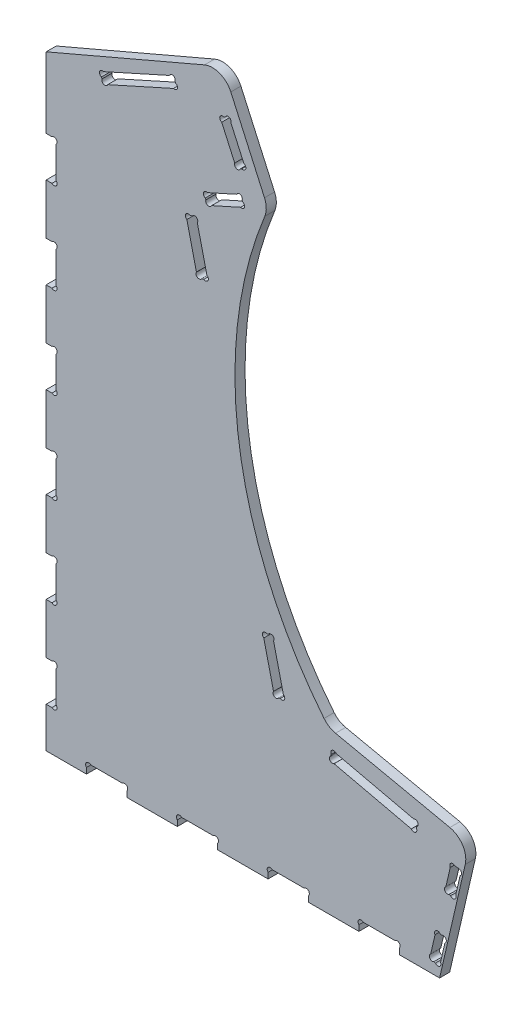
ISO-10303-21;
HEADER;
FILE_DESCRIPTION(('STEP AP214'),'2;1');
FILE_NAME('part.step','',(''),(''),'','','');
FILE_SCHEMA(('AUTOMOTIVE_DESIGN { 1 0 10303 214 1 1 1 1 }'));
ENDSEC;
DATA;
#1=APPLICATION_CONTEXT('core data for automotive mechanical design processes');
#2=APPLICATION_PROTOCOL_DEFINITION('international standard','automotive_design',2000,#1);
#3=PRODUCT_CONTEXT('',#1,'mechanical');
#4=PRODUCT('Part','Part','',(#3));
#5=PRODUCT_RELATED_PRODUCT_CATEGORY('part','',(#4));
#6=PRODUCT_DEFINITION_FORMATION('','',#4);
#7=PRODUCT_DEFINITION_CONTEXT('part definition',#1,'design');
#8=PRODUCT_DEFINITION('design','',#6,#7);
#9=PRODUCT_DEFINITION_SHAPE('','',#8);
#10=(LENGTH_UNIT() NAMED_UNIT(*) SI_UNIT(.MILLI.,.METRE.));
#11=(NAMED_UNIT(*) PLANE_ANGLE_UNIT() SI_UNIT($,.RADIAN.));
#12=(NAMED_UNIT(*) SI_UNIT($,.STERADIAN.) SOLID_ANGLE_UNIT());
#13=UNCERTAINTY_MEASURE_WITH_UNIT(LENGTH_MEASURE(1.E-05),#10,'distance_accuracy_value','');
#14=(GEOMETRIC_REPRESENTATION_CONTEXT(3) GLOBAL_UNCERTAINTY_ASSIGNED_CONTEXT((#13)) GLOBAL_UNIT_ASSIGNED_CONTEXT((#10,
#11,#12)) REPRESENTATION_CONTEXT('',''));
#15=CARTESIAN_POINT('',(0.,0.,0.));
#16=DIRECTION('',(0.,0.,1.));
#17=DIRECTION('',(1.,0.,0.));
#18=AXIS2_PLACEMENT_3D('',#15,#16,#17);
#19=CARTESIAN_POINT('',(156.010067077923,557.354262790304,0.));
#20=DIRECTION('',(-0.410364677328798,0.911921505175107,0.));
#21=DIRECTION('',(-0.911921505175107,-0.410364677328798,0.));
#22=AXIS2_PLACEMENT_3D('',#19,#20,#21);
#23=PLANE('',#22);
#24=DIRECTION('',(0.,0.,-1.));
#25=VECTOR('',#24,1.);
#26=CARTESIAN_POINT('',(188.617972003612,572.027820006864,10.));
#27=LINE('',#26,#25);
#28=CARTESIAN_POINT('',(188.617972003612,572.027820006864,10.));
#29=VERTEX_POINT('',#28);
#30=CARTESIAN_POINT('',(188.617972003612,572.027820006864,0.));
#31=VERTEX_POINT('',#30);
#32=EDGE_CURVE('E1941',#29,#31,#27,.T.);
#33=ORIENTED_EDGE('',*,*,#32,.F.);
#34=DIRECTION('',(-0.911921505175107,-0.410364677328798,0.));
#35=VECTOR('',#34,1.);
#36=CARTESIAN_POINT('',(156.010067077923,557.354262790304,10.));
#37=LINE('',#36,#35);
#38=CARTESIAN_POINT('',(159.879022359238,559.095292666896,10.));
#39=VERTEX_POINT('',#38);
#40=EDGE_CURVE('E906',#29,#39,#37,.T.);
#41=ORIENTED_EDGE('',*,*,#40,.T.);
#42=DIRECTION('',(0.,0.,-1.));
#43=VECTOR('',#42,1.);
#44=CARTESIAN_POINT('',(159.879022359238,559.095292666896,10.));
#45=LINE('',#44,#43);
#46=CARTESIAN_POINT('',(159.879022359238,559.095292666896,0.));
#47=VERTEX_POINT('',#46);
#48=EDGE_CURVE('E43',#39,#47,#45,.T.);
#49=ORIENTED_EDGE('',*,*,#48,.T.);
#50=DIRECTION('',(-0.911921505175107,-0.410364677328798,0.));
#51=VECTOR('',#50,1.);
#52=CARTESIAN_POINT('',(156.010067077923,557.354262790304,0.));
#53=LINE('',#52,#51);
#54=EDGE_CURVE('E56',#31,#47,#53,.T.);
#55=ORIENTED_EDGE('',*,*,#54,.F.);
#56=EDGE_LOOP('',(#33,#41,#49,#55));
#57=FACE_BOUND('',#56,.T.);
#58=ADVANCED_FACE('F35',(#57),#23,.F.);
#59=CARTESIAN_POINT('',(196.590574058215,564.649634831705,0.));
#60=DIRECTION('',(0.911921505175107,0.410364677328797,0.));
#61=DIRECTION('',(-0.410364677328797,0.911921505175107,0.));
#62=AXIS2_PLACEMENT_3D('',#59,#60,#61);
#63=PLANE('',#62);
#64=DIRECTION('',(0.,0.,-1.));
#65=VECTOR('',#64,1.);
#66=CARTESIAN_POINT('',(194.227957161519,569.899894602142,10.));
#67=LINE('',#66,#65);
#68=CARTESIAN_POINT('',(194.227957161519,569.899894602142,0.));
#69=VERTEX_POINT('',#68);
#70=CARTESIAN_POINT('',(194.227957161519,569.899894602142,10.));
#71=VERTEX_POINT('',#70);
#72=EDGE_CURVE('E11',#69,#71,#67,.F.);
#73=ORIENTED_EDGE('',*,*,#72,.F.);
#74=DIRECTION('',(-0.410364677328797,0.911921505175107,0.));
#75=VECTOR('',#74,1.);
#76=CARTESIAN_POINT('',(196.590574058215,564.649634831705,0.));
#77=LINE('',#76,#75);
#78=CARTESIAN_POINT('',(194.849544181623,568.51859011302,0.));
#79=VERTEX_POINT('',#78);
#80=EDGE_CURVE('E1965',#79,#69,#77,.T.);
#81=ORIENTED_EDGE('',*,*,#80,.F.);
#82=DIRECTION('',(0.,0.,-1.));
#83=VECTOR('',#82,1.);
#84=CARTESIAN_POINT('',(194.849544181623,568.51859011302,10.));
#85=LINE('',#84,#83);
#86=CARTESIAN_POINT('',(194.849544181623,568.51859011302,10.));
#87=VERTEX_POINT('',#86);
#88=EDGE_CURVE('E915',#79,#87,#85,.F.);
#89=ORIENTED_EDGE('',*,*,#88,.T.);
#90=DIRECTION('',(-0.410364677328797,0.911921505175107,0.));
#91=VECTOR('',#90,1.);
#92=CARTESIAN_POINT('',(196.590574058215,564.649634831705,10.));
#93=LINE('',#92,#91);
#94=EDGE_CURVE('E904',#87,#71,#93,.T.);
#95=ORIENTED_EDGE('',*,*,#94,.T.);
#96=EDGE_LOOP('',(#73,#81,#89,#95));
#97=FACE_BOUND('',#96,.T.);
#98=ADVANCED_FACE('F914',(#97),#63,.F.);
#99=CARTESIAN_POINT('',(160.113713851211,548.235047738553,0.));
#100=DIRECTION('',(-0.911921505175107,-0.410364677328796,0.));
#101=DIRECTION('',(0.410364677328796,-0.911921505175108,0.));
#102=AXIS2_PLACEMENT_3D('',#99,#100,#101);
#103=PLANE('',#102);
#104=DIRECTION('',(0.410364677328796,-0.911921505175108,0.));
#105=VECTOR('',#104,1.);
#106=CARTESIAN_POINT('',(160.113713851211,548.235047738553,0.));
#107=LINE('',#106,#105);
#108=CARTESIAN_POINT('',(157.751096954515,553.48530750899,0.));
#109=VERTEX_POINT('',#108);
#110=CARTESIAN_POINT('',(158.372683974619,552.104003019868,0.));
#111=VERTEX_POINT('',#110);
#112=EDGE_CURVE('E918',#109,#111,#107,.T.);
#113=ORIENTED_EDGE('',*,*,#112,.F.);
#114=DIRECTION('',(0.,0.,-1.));
#115=VECTOR('',#114,1.);
#116=CARTESIAN_POINT('',(157.751096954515,553.48530750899,10.));
#117=LINE('',#116,#115);
#118=CARTESIAN_POINT('',(157.751096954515,553.48530750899,10.));
#119=VERTEX_POINT('',#118);
#120=EDGE_CURVE('E1943',#109,#119,#117,.F.);
#121=ORIENTED_EDGE('',*,*,#120,.T.);
#122=DIRECTION('',(0.410364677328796,-0.911921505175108,0.));
#123=VECTOR('',#122,1.);
#124=CARTESIAN_POINT('',(160.113713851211,548.235047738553,10.));
#125=LINE('',#124,#123);
#126=CARTESIAN_POINT('',(158.372683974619,552.104003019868,10.));
#127=VERTEX_POINT('',#126);
#128=EDGE_CURVE('E920',#119,#127,#125,.T.);
#129=ORIENTED_EDGE('',*,*,#128,.T.);
#130=DIRECTION('',(0.,0.,-1.));
#131=VECTOR('',#130,1.);
#132=CARTESIAN_POINT('',(158.372683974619,552.104003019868,10.));
#133=LINE('',#132,#131);
#134=EDGE_CURVE('E1953',#111,#127,#133,.F.);
#135=ORIENTED_EDGE('',*,*,#134,.F.);
#136=EDGE_LOOP('',(#113,#121,#129,#135));
#137=FACE_BOUND('',#136,.T.);
#138=ADVANCED_FACE('F1970',(#137),#103,.F.);
#139=CARTESIAN_POINT('',(160.113713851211,548.235047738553,0.));
#140=DIRECTION('',(0.4103646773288,-0.911921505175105,0.));
#141=DIRECTION('',(0.911921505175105,0.4103646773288,0.));
#142=AXIS2_PLACEMENT_3D('',#139,#140,#141);
#143=PLANE('',#142);
#144=DIRECTION('',(0.,0.,-1.));
#145=VECTOR('',#144,1.);
#146=CARTESIAN_POINT('',(163.982669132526,549.976077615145,10.));
#147=LINE('',#146,#145);
#148=CARTESIAN_POINT('',(163.982669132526,549.976077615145,10.));
#149=VERTEX_POINT('',#148);
#150=CARTESIAN_POINT('',(163.982669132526,549.976077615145,0.));
#151=VERTEX_POINT('',#150);
#152=EDGE_CURVE('E1929',#149,#151,#147,.T.);
#153=ORIENTED_EDGE('',*,*,#152,.F.);
#154=DIRECTION('',(0.911921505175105,0.4103646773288,0.));
#155=VECTOR('',#154,1.);
#156=CARTESIAN_POINT('',(160.113713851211,548.235047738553,10.));
#157=LINE('',#156,#155);
#158=CARTESIAN_POINT('',(192.7216187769,562.908604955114,10.));
#159=VERTEX_POINT('',#158);
#160=EDGE_CURVE('E916',#149,#159,#157,.T.);
#161=ORIENTED_EDGE('',*,*,#160,.T.);
#162=DIRECTION('',(0.,0.,-1.));
#163=VECTOR('',#162,1.);
#164=CARTESIAN_POINT('',(192.7216187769,562.908604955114,10.));
#165=LINE('',#164,#163);
#166=CARTESIAN_POINT('',(192.7216187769,562.908604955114,0.));
#167=VERTEX_POINT('',#166);
#168=EDGE_CURVE('E1926',#159,#167,#165,.T.);
#169=ORIENTED_EDGE('',*,*,#168,.T.);
#170=DIRECTION('',(0.911921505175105,0.4103646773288,0.));
#171=VECTOR('',#170,1.);
#172=CARTESIAN_POINT('',(160.113713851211,548.235047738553,0.));
#173=LINE('',#172,#171);
#174=EDGE_CURVE('E1963',#151,#167,#173,.T.);
#175=ORIENTED_EDGE('',*,*,#174,.F.);
#176=EDGE_LOOP('',(#153,#161,#169,#175));
#177=FACE_BOUND('',#176,.T.);
#178=ADVANCED_FACE('F1978',(#177),#143,.F.);
#179=CARTESIAN_POINT('',(160.334315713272,483.744766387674,0.));
#180=DIRECTION('',(0.229075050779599,-0.973408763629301,0.));
#181=DIRECTION('',(0.973408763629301,0.229075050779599,0.));
#182=AXIS2_PLACEMENT_3D('',#179,#180,#181);
#183=PLANE('',#182);
#184=DIRECTION('',(0.,0.,-1.));
#185=VECTOR('',#184,1.);
#186=CARTESIAN_POINT('',(154.074684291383,482.271669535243,10.));
#187=LINE('',#186,#185);
#188=CARTESIAN_POINT('',(154.074684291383,482.271669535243,10.));
#189=VERTEX_POINT('',#188);
#190=CARTESIAN_POINT('',(154.074684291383,482.271669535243,0.));
#191=VERTEX_POINT('',#190);
#192=EDGE_CURVE('E928',#189,#191,#187,.T.);
#193=ORIENTED_EDGE('',*,*,#192,.F.);
#194=DIRECTION('',(-0.973408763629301,-0.229075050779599,0.));
#195=VECTOR('',#194,1.);
#196=CARTESIAN_POINT('',(201.409448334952,493.411094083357,10.));
#197=LINE('',#196,#195);
#198=CARTESIAN_POINT('',(156.2044920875,482.772883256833,10.));
#199=VERTEX_POINT('',#198);
#200=EDGE_CURVE('E1141',#199,#189,#197,.T.);
#201=ORIENTED_EDGE('',*,*,#200,.F.);
#202=DIRECTION('',(0.,0.,-1.));
#203=VECTOR('',#202,1.);
#204=CARTESIAN_POINT('',(156.2044920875,482.772883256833,10.));
#205=LINE('',#204,#203);
#206=CARTESIAN_POINT('',(156.2044920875,482.772883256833,0.));
#207=VERTEX_POINT('',#206);
#208=EDGE_CURVE('E1914',#199,#207,#205,.T.);
#209=ORIENTED_EDGE('',*,*,#208,.T.);
#210=DIRECTION('',(0.973408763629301,0.229075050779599,0.));
#211=VECTOR('',#210,1.);
#212=CARTESIAN_POINT('',(160.334315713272,483.744766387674,0.));
#213=LINE('',#212,#211);
#214=EDGE_CURVE('E1136',#191,#207,#213,.T.);
#215=ORIENTED_EDGE('',*,*,#214,.F.);
#216=EDGE_LOOP('',(#193,#201,#209,#215));
#217=FACE_BOUND('',#216,.T.);
#218=ADVANCED_FACE('F2218',(#217),#183,.F.);
#219=CARTESIAN_POINT('',(138.491108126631,529.970224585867,0.));
#220=DIRECTION('',(-0.973408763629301,-0.2290750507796,0.));
#221=DIRECTION('',(0.2290750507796,-0.973408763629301,0.));
#222=AXIS2_PLACEMENT_3D('',#219,#220,#221);
#223=PLANE('',#222);
#224=DIRECTION('',(0.,0.,-1.));
#225=VECTOR('',#224,1.);
#226=CARTESIAN_POINT('',(148.972977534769,485.429610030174,10.));
#227=LINE('',#226,#225);
#228=CARTESIAN_POINT('',(148.972977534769,485.429610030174,0.));
#229=VERTEX_POINT('',#228);
#230=CARTESIAN_POINT('',(148.972977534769,485.429610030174,10.));
#231=VERTEX_POINT('',#230);
#232=EDGE_CURVE('E1923',#229,#231,#227,.F.);
#233=ORIENTED_EDGE('',*,*,#232,.F.);
#234=DIRECTION('',(0.2290750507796,-0.973408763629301,0.));
#235=VECTOR('',#234,1.);
#236=CARTESIAN_POINT('',(138.491108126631,529.970224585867,0.));
#237=LINE('',#236,#235);
#238=CARTESIAN_POINT('',(139.462991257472,525.840400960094,0.));
#239=VERTEX_POINT('',#238);
#240=EDGE_CURVE('E1133',#239,#229,#237,.T.);
#241=ORIENTED_EDGE('',*,*,#240,.F.);
#242=DIRECTION('',(0.,0.,-1.));
#243=VECTOR('',#242,1.);
#244=CARTESIAN_POINT('',(139.462991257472,525.840400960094,10.));
#245=LINE('',#244,#243);
#246=CARTESIAN_POINT('',(139.462991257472,525.840400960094,10.));
#247=VERTEX_POINT('',#246);
#248=EDGE_CURVE('E1920',#239,#247,#245,.F.);
#249=ORIENTED_EDGE('',*,*,#248,.T.);
#250=DIRECTION('',(-0.2290750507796,0.973408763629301,0.));
#251=VECTOR('',#250,1.);
#252=CARTESIAN_POINT('',(113.358163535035,636.767662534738,10.));
#253=LINE('',#252,#251);
#254=EDGE_CURVE('E1130',#231,#247,#253,.T.);
#255=ORIENTED_EDGE('',*,*,#254,.F.);
#256=EDGE_LOOP('',(#233,#241,#249,#255));
#257=FACE_BOUND('',#256,.T.);
#258=ADVANCED_FACE('F2358',(#257),#223,.F.);
#259=CARTESIAN_POINT('',(148.880563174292,532.415204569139,0.));
#260=DIRECTION('',(-0.229075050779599,0.973408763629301,0.));
#261=DIRECTION('',(-0.973408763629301,-0.229075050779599,0.));
#262=AXIS2_PLACEMENT_3D('',#259,#260,#261);
#263=PLANE('',#262);
#264=DIRECTION('',(0.973408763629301,0.229075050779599,0.));
#265=VECTOR('',#264,1.);
#266=CARTESIAN_POINT('',(189.955695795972,542.081532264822,10.));
#267=LINE('',#266,#265);
#268=CARTESIAN_POINT('',(142.620931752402,530.942107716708,10.));
#269=VERTEX_POINT('',#268);
#270=CARTESIAN_POINT('',(144.75073954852,531.443321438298,10.));
#271=VERTEX_POINT('',#270);
#272=EDGE_CURVE('E1146',#269,#271,#267,.T.);
#273=ORIENTED_EDGE('',*,*,#272,.F.);
#274=DIRECTION('',(0.,0.,-1.));
#275=VECTOR('',#274,1.);
#276=CARTESIAN_POINT('',(142.620931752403,530.942107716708,10.));
#277=LINE('',#276,#275);
#278=CARTESIAN_POINT('',(142.620931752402,530.942107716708,0.));
#279=VERTEX_POINT('',#278);
#280=EDGE_CURVE('E935',#269,#279,#277,.T.);
#281=ORIENTED_EDGE('',*,*,#280,.T.);
#282=DIRECTION('',(-0.973408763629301,-0.229075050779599,0.));
#283=VECTOR('',#282,1.);
#284=CARTESIAN_POINT('',(148.880563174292,532.415204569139,0.));
#285=LINE('',#284,#283);
#286=CARTESIAN_POINT('',(144.75073954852,531.443321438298,0.));
#287=VERTEX_POINT('',#286);
#288=EDGE_CURVE('E1117',#287,#279,#285,.T.);
#289=ORIENTED_EDGE('',*,*,#288,.F.);
#290=DIRECTION('',(0.,0.,-1.));
#291=VECTOR('',#290,1.);
#292=CARTESIAN_POINT('',(144.75073954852,531.443321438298,10.));
#293=LINE('',#292,#291);
#294=EDGE_CURVE('E944',#271,#287,#293,.T.);
#295=ORIENTED_EDGE('',*,*,#294,.F.);
#296=EDGE_LOOP('',(#273,#281,#289,#295));
#297=FACE_BOUND('',#296,.T.);
#298=ADVANCED_FACE('F2354',(#297),#263,.F.);
#299=CARTESIAN_POINT('',(148.880563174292,532.415204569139,0.));
#300=DIRECTION('',(0.973408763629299,0.229075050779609,0.));
#301=DIRECTION('',(-0.229075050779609,0.973408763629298,0.));
#302=AXIS2_PLACEMENT_3D('',#299,#300,#301);
#303=PLANE('',#302);
#304=DIRECTION('',(0.,0.,-1.));
#305=VECTOR('',#304,1.);
#306=CARTESIAN_POINT('',(149.852446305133,528.285380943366,10.));
#307=LINE('',#306,#305);
#308=CARTESIAN_POINT('',(149.852446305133,528.285380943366,0.));
#309=VERTEX_POINT('',#308);
#310=CARTESIAN_POINT('',(149.852446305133,528.285380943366,10.));
#311=VERTEX_POINT('',#310);
#312=EDGE_CURVE('E1917',#309,#311,#307,.F.);
#313=ORIENTED_EDGE('',*,*,#312,.F.);
#314=DIRECTION('',(-0.229075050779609,0.973408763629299,0.));
#315=VECTOR('',#314,1.);
#316=CARTESIAN_POINT('',(148.880563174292,532.415204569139,0.));
#317=LINE('',#316,#315);
#318=CARTESIAN_POINT('',(159.362432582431,487.874590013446,0.));
#319=VERTEX_POINT('',#318);
#320=EDGE_CURVE('E1123',#319,#309,#317,.T.);
#321=ORIENTED_EDGE('',*,*,#320,.F.);
#322=DIRECTION('',(0.,0.,-1.));
#323=VECTOR('',#322,1.);
#324=CARTESIAN_POINT('',(159.362432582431,487.874590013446,10.));
#325=LINE('',#324,#323);
#326=CARTESIAN_POINT('',(159.362432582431,487.874590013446,10.));
#327=VERTEX_POINT('',#326);
#328=EDGE_CURVE('E949',#319,#327,#325,.F.);
#329=ORIENTED_EDGE('',*,*,#328,.T.);
#330=DIRECTION('',(0.229075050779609,-0.973408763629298,0.));
#331=VECTOR('',#330,1.);
#332=CARTESIAN_POINT('',(123.747618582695,639.21264251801,10.));
#333=LINE('',#332,#331);
#334=EDGE_CURVE('E1144',#311,#327,#333,.T.);
#335=ORIENTED_EDGE('',*,*,#334,.F.);
#336=EDGE_LOOP('',(#313,#321,#329,#335));
#337=FACE_BOUND('',#336,.T.);
#338=ADVANCED_FACE('F2258',(#337),#303,.F.);
#339=CARTESIAN_POINT('',(172.269732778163,630.466248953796,0.));
#340=DIRECTION('',(-0.410364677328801,0.911921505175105,0.));
#341=DIRECTION('',(-0.911921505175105,-0.410364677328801,0.));
#342=AXIS2_PLACEMENT_3D('',#339,#340,#341);
#343=PLANE('',#342);
#344=DIRECTION('',(0.,0.,-1.));
#345=VECTOR('',#344,1.);
#346=CARTESIAN_POINT('',(177.519992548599,632.828865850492,10.));
#347=LINE('',#346,#345);
#348=CARTESIAN_POINT('',(177.519992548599,632.828865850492,10.));
#349=VERTEX_POINT('',#348);
#350=CARTESIAN_POINT('',(177.519992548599,632.828865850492,0.));
#351=VERTEX_POINT('',#350);
#352=EDGE_CURVE('E960',#349,#351,#347,.T.);
#353=ORIENTED_EDGE('',*,*,#352,.F.);
#354=DIRECTION('',(0.911921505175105,0.410364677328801,0.));
#355=VECTOR('',#354,1.);
#356=CARTESIAN_POINT('',(172.96723214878,630.780123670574,10.));
#357=LINE('',#356,#355);
#358=CARTESIAN_POINT('',(176.138688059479,632.207278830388,10.));
#359=VERTEX_POINT('',#358);
#360=EDGE_CURVE('E1000',#359,#349,#357,.T.);
#361=ORIENTED_EDGE('',*,*,#360,.F.);
#362=DIRECTION('',(0.,0.,-1.));
#363=VECTOR('',#362,1.);
#364=CARTESIAN_POINT('',(176.138688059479,632.207278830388,10.));
#365=LINE('',#364,#363);
#366=CARTESIAN_POINT('',(176.138688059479,632.207278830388,0.));
#367=VERTEX_POINT('',#366);
#368=EDGE_CURVE('E1908',#359,#367,#365,.T.);
#369=ORIENTED_EDGE('',*,*,#368,.T.);
#370=DIRECTION('',(-0.911921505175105,-0.410364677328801,0.));
#371=VECTOR('',#370,1.);
#372=CARTESIAN_POINT('',(172.269732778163,630.466248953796,0.));
#373=LINE('',#372,#371);
#374=EDGE_CURVE('E993',#351,#367,#373,.T.);
#375=ORIENTED_EDGE('',*,*,#374,.F.);
#376=EDGE_LOOP('',(#353,#361,#369,#375));
#377=FACE_BOUND('',#376,.T.);
#378=ADVANCED_FACE('F2254',(#377),#343,.F.);
#379=CARTESIAN_POINT('',(181.388947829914,634.569895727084,0.));
#380=DIRECTION('',(0.911921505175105,0.410364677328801,0.));
#381=DIRECTION('',(-0.410364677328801,0.911921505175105,0.));
#382=AXIS2_PLACEMENT_3D('',#379,#380,#381);
#383=PLANE('',#382);
#384=DIRECTION('',(0.,0.,-1.));
#385=VECTOR('',#384,1.);
#386=CARTESIAN_POINT('',(183.129977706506,630.70094044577,10.));
#387=LINE('',#386,#385);
#388=CARTESIAN_POINT('',(183.129977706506,630.70094044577,0.));
#389=VERTEX_POINT('',#388);
#390=CARTESIAN_POINT('',(183.129977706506,630.70094044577,10.));
#391=VERTEX_POINT('',#390);
#392=EDGE_CURVE('E1911',#389,#391,#387,.F.);
#393=ORIENTED_EDGE('',*,*,#392,.F.);
#394=DIRECTION('',(-0.410364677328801,0.911921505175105,0.));
#395=VECTOR('',#394,1.);
#396=CARTESIAN_POINT('',(181.388947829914,634.569895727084,0.));
#397=LINE('',#396,#395);
#398=CARTESIAN_POINT('',(196.018991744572,602.058687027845,0.));
#399=VERTEX_POINT('',#398);
#400=EDGE_CURVE('E990',#399,#389,#397,.T.);
#401=ORIENTED_EDGE('',*,*,#400,.F.);
#402=DIRECTION('',(0.,0.,-1.));
#403=VECTOR('',#402,1.);
#404=CARTESIAN_POINT('',(196.018991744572,602.058687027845,10.));
#405=LINE('',#404,#403);
#406=CARTESIAN_POINT('',(196.018991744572,602.058687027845,10.));
#407=VERTEX_POINT('',#406);
#408=EDGE_CURVE('E980',#399,#407,#405,.F.);
#409=ORIENTED_EDGE('',*,*,#408,.T.);
#410=DIRECTION('',(0.410364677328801,-0.911921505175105,0.));
#411=VECTOR('',#410,1.);
#412=CARTESIAN_POINT('',(173.24446688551,652.668742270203,10.));
#413=LINE('',#412,#411);
#414=EDGE_CURVE('E998',#391,#407,#413,.T.);
#415=ORIENTED_EDGE('',*,*,#414,.F.);
#416=EDGE_LOOP('',(#393,#401,#409,#415));
#417=FACE_BOUND('',#416,.T.);
#418=ADVANCED_FACE('F2257',(#417),#383,.F.);
#419=CARTESIAN_POINT('',(172.269732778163,630.466248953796,0.));
#420=DIRECTION('',(-0.911921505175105,-0.410364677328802,0.));
#421=DIRECTION('',(0.410364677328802,-0.911921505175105,0.));
#422=AXIS2_PLACEMENT_3D('',#419,#420,#421);
#423=PLANE('',#422);
#424=DIRECTION('',(0.410364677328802,-0.911921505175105,0.));
#425=VECTOR('',#424,1.);
#426=CARTESIAN_POINT('',(172.269732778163,630.466248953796,0.));
#427=LINE('',#426,#425);
#428=CARTESIAN_POINT('',(174.010762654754,626.597293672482,0.));
#429=VERTEX_POINT('',#428);
#430=CARTESIAN_POINT('',(186.899776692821,597.955040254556,0.));
#431=VERTEX_POINT('',#430);
#432=EDGE_CURVE('E984',#429,#431,#427,.T.);
#433=ORIENTED_EDGE('',*,*,#432,.F.);
#434=DIRECTION('',(0.,0.,-1.));
#435=VECTOR('',#434,1.);
#436=CARTESIAN_POINT('',(174.010762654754,626.597293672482,10.));
#437=LINE('',#436,#435);
#438=CARTESIAN_POINT('',(174.010762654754,626.597293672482,10.));
#439=VERTEX_POINT('',#438);
#440=EDGE_CURVE('E968',#429,#439,#437,.F.);
#441=ORIENTED_EDGE('',*,*,#440,.T.);
#442=DIRECTION('',(-0.410364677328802,0.911921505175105,0.));
#443=VECTOR('',#442,1.);
#444=CARTESIAN_POINT('',(164.125251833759,648.565095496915,10.));
#445=LINE('',#444,#443);
#446=CARTESIAN_POINT('',(186.899776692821,597.955040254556,10.));
#447=VERTEX_POINT('',#446);
#448=EDGE_CURVE('E1003',#447,#439,#445,.T.);
#449=ORIENTED_EDGE('',*,*,#448,.F.);
#450=DIRECTION('',(0.,0.,-1.));
#451=VECTOR('',#450,1.);
#452=CARTESIAN_POINT('',(186.899776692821,597.955040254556,10.));
#453=LINE('',#452,#451);
#454=EDGE_CURVE('E975',#431,#447,#453,.F.);
#455=ORIENTED_EDGE('',*,*,#454,.F.);
#456=EDGE_LOOP('',(#433,#441,#449,#455));
#457=FACE_BOUND('',#456,.T.);
#458=ADVANCED_FACE('F2262',(#457),#423,.F.);
#459=CARTESIAN_POINT('',(188.640806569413,594.086084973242,0.));
#460=DIRECTION('',(0.410364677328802,-0.911921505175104,0.));
#461=DIRECTION('',(0.911921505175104,0.410364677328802,0.));
#462=AXIS2_PLACEMENT_3D('',#459,#460,#461);
#463=PLANE('',#462);
#464=DIRECTION('',(0.,0.,-1.));
#465=VECTOR('',#464,1.);
#466=CARTESIAN_POINT('',(192.509761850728,595.827114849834,10.));
#467=LINE('',#466,#465);
#468=CARTESIAN_POINT('',(192.509761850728,595.827114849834,10.));
#469=VERTEX_POINT('',#468);
#470=CARTESIAN_POINT('',(192.509761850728,595.827114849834,0.));
#471=VERTEX_POINT('',#470);
#472=EDGE_CURVE('E1905',#469,#471,#467,.T.);
#473=ORIENTED_EDGE('',*,*,#472,.F.);
#474=DIRECTION('',(-0.911921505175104,-0.410364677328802,0.));
#475=VECTOR('',#474,1.);
#476=CARTESIAN_POINT('',(189.33830594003,594.39995969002,10.));
#477=LINE('',#476,#475);
#478=CARTESIAN_POINT('',(193.891066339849,596.448701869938,10.));
#479=VERTEX_POINT('',#478);
#480=EDGE_CURVE('E995',#479,#469,#477,.T.);
#481=ORIENTED_EDGE('',*,*,#480,.F.);
#482=DIRECTION('',(0.,0.,-1.));
#483=VECTOR('',#482,1.);
#484=CARTESIAN_POINT('',(193.891066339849,596.448701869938,10.));
#485=LINE('',#484,#483);
#486=CARTESIAN_POINT('',(193.891066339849,596.448701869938,0.));
#487=VERTEX_POINT('',#486);
#488=EDGE_CURVE('E1902',#479,#487,#485,.T.);
#489=ORIENTED_EDGE('',*,*,#488,.T.);
#490=DIRECTION('',(0.911921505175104,0.410364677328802,0.));
#491=VECTOR('',#490,1.);
#492=CARTESIAN_POINT('',(188.640806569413,594.086084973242,0.));
#493=LINE('',#492,#491);
#494=EDGE_CURVE('E988',#471,#487,#493,.T.);
#495=ORIENTED_EDGE('',*,*,#494,.F.);
#496=EDGE_LOOP('',(#473,#481,#489,#495));
#497=FACE_BOUND('',#496,.T.);
#498=ADVANCED_FACE('F2264',(#497),#463,.F.);
#499=CARTESIAN_POINT('',(53.0380711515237,609.709569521,0.));
#500=DIRECTION('',(-0.410364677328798,0.911921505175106,0.));
#501=DIRECTION('',(-0.911921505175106,-0.410364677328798,0.));
#502=AXIS2_PLACEMENT_3D('',#499,#500,#501);
#503=PLANE('',#502);
#504=DIRECTION('',(0.,0.,-1.));
#505=VECTOR('',#504,1.);
#506=CARTESIAN_POINT('',(122.122836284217,640.797713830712,10.));
#507=LINE('',#506,#505);
#508=CARTESIAN_POINT('',(122.122836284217,640.797713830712,10.));
#509=VERTEX_POINT('',#508);
#510=CARTESIAN_POINT('',(122.122836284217,640.797713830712,0.));
#511=VERTEX_POINT('',#510);
#512=EDGE_CURVE('E1011',#509,#511,#507,.T.);
#513=ORIENTED_EDGE('',*,*,#512,.F.);
#514=DIRECTION('',(0.911921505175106,0.410364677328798,0.));
#515=VECTOR('',#514,1.);
#516=CARTESIAN_POINT('',(160.656291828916,658.137768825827,10.));
#517=LINE('',#516,#515);
#518=CARTESIAN_POINT('',(56.9070264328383,611.450599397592,10.));
#519=VERTEX_POINT('',#518);
#520=EDGE_CURVE('E1051',#519,#509,#517,.T.);
#521=ORIENTED_EDGE('',*,*,#520,.F.);
#522=DIRECTION('',(0.,0.,-1.));
#523=VECTOR('',#522,1.);
#524=CARTESIAN_POINT('',(56.9070264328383,611.450599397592,10.));
#525=LINE('',#524,#523);
#526=CARTESIAN_POINT('',(56.9070264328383,611.450599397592,0.));
#527=VERTEX_POINT('',#526);
#528=EDGE_CURVE('E1896',#519,#527,#525,.T.);
#529=ORIENTED_EDGE('',*,*,#528,.T.);
#530=DIRECTION('',(-0.911921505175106,-0.410364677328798,0.));
#531=VECTOR('',#530,1.);
#532=CARTESIAN_POINT('',(53.0380711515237,609.709569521,0.));
#533=LINE('',#532,#531);
#534=EDGE_CURVE('E1044',#511,#527,#533,.T.);
#535=ORIENTED_EDGE('',*,*,#534,.F.);
#536=EDGE_LOOP('',(#513,#521,#529,#535));
#537=FACE_BOUND('',#536,.T.);
#538=ADVANCED_FACE('F2267',(#537),#503,.F.);
#539=CARTESIAN_POINT('',(125.991791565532,642.538743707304,0.));
#540=DIRECTION('',(0.911921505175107,0.410364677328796,0.));
#541=DIRECTION('',(-0.410364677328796,0.911921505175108,0.));
#542=AXIS2_PLACEMENT_3D('',#539,#540,#541);
#543=PLANE('',#542);
#544=DIRECTION('',(0.,0.,-1.));
#545=VECTOR('',#544,1.);
#546=CARTESIAN_POINT('',(127.732821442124,638.66978842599,10.));
#547=LINE('',#546,#545);
#548=CARTESIAN_POINT('',(127.732821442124,638.66978842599,0.));
#549=VERTEX_POINT('',#548);
#550=CARTESIAN_POINT('',(127.732821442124,638.66978842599,10.));
#551=VERTEX_POINT('',#550);
#552=EDGE_CURVE('E1899',#549,#551,#547,.F.);
#553=ORIENTED_EDGE('',*,*,#552,.F.);
#554=DIRECTION('',(-0.410364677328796,0.911921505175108,0.));
#555=VECTOR('',#554,1.);
#556=CARTESIAN_POINT('',(125.991791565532,642.538743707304,0.));
#557=LINE('',#556,#555);
#558=CARTESIAN_POINT('',(128.354408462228,637.288483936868,0.));
#559=VERTEX_POINT('',#558);
#560=EDGE_CURVE('E1041',#559,#549,#557,.T.);
#561=ORIENTED_EDGE('',*,*,#560,.F.);
#562=DIRECTION('',(0.,0.,-1.));
#563=VECTOR('',#562,1.);
#564=CARTESIAN_POINT('',(128.354408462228,637.288483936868,10.));
#565=LINE('',#564,#563);
#566=CARTESIAN_POINT('',(128.354408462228,637.288483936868,10.));
#567=VERTEX_POINT('',#566);
#568=EDGE_CURVE('E1031',#559,#567,#565,.F.);
#569=ORIENTED_EDGE('',*,*,#568,.T.);
#570=DIRECTION('',(0.410364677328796,-0.911921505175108,0.));
#571=VECTOR('',#570,1.);
#572=CARTESIAN_POINT('',(130.158250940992,633.27994509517,10.));
#573=LINE('',#572,#571);
#574=EDGE_CURVE('E1049',#551,#567,#573,.T.);
#575=ORIENTED_EDGE('',*,*,#574,.F.);
#576=EDGE_LOOP('',(#553,#561,#569,#575));
#577=FACE_BOUND('',#576,.T.);
#578=ADVANCED_FACE('F2290',(#577),#543,.F.);
#579=CARTESIAN_POINT('',(53.0380711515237,609.709569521,0.));
#580=DIRECTION('',(-0.911921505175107,-0.410364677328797,0.));
#581=DIRECTION('',(0.410364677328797,-0.911921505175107,0.));
#582=AXIS2_PLACEMENT_3D('',#579,#580,#581);
#583=PLANE('',#582);
#584=DIRECTION('',(0.410364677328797,-0.911921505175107,0.));
#585=VECTOR('',#584,1.);
#586=CARTESIAN_POINT('',(53.0380711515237,609.709569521,0.));
#587=LINE('',#586,#585);
#588=CARTESIAN_POINT('',(54.7791010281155,605.840614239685,0.));
#589=VERTEX_POINT('',#588);
#590=CARTESIAN_POINT('',(55.4006880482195,604.459309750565,0.));
#591=VERTEX_POINT('',#590);
#592=EDGE_CURVE('E1035',#589,#591,#587,.T.);
#593=ORIENTED_EDGE('',*,*,#592,.F.);
#594=DIRECTION('',(0.,0.,-1.));
#595=VECTOR('',#594,1.);
#596=CARTESIAN_POINT('',(54.7791010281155,605.840614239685,10.));
#597=LINE('',#596,#595);
#598=CARTESIAN_POINT('',(54.7791010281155,605.840614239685,10.));
#599=VERTEX_POINT('',#598);
#600=EDGE_CURVE('E1019',#589,#599,#597,.F.);
#601=ORIENTED_EDGE('',*,*,#600,.T.);
#602=DIRECTION('',(-0.410364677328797,0.911921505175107,0.));
#603=VECTOR('',#602,1.);
#604=CARTESIAN_POINT('',(57.2045305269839,600.450770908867,10.));
#605=LINE('',#604,#603);
#606=CARTESIAN_POINT('',(55.4006880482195,604.459309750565,10.));
#607=VERTEX_POINT('',#606);
#608=EDGE_CURVE('E1054',#607,#599,#605,.T.);
#609=ORIENTED_EDGE('',*,*,#608,.F.);
#610=DIRECTION('',(0.,0.,-1.));
#611=VECTOR('',#610,1.);
#612=CARTESIAN_POINT('',(55.4006880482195,604.459309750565,10.));
#613=LINE('',#612,#611);
#614=EDGE_CURVE('E1026',#591,#607,#613,.F.);
#615=ORIENTED_EDGE('',*,*,#614,.F.);
#616=EDGE_LOOP('',(#593,#601,#609,#615));
#617=FACE_BOUND('',#616,.T.);
#618=ADVANCED_FACE('F2294',(#617),#583,.F.);
#619=CARTESIAN_POINT('',(57.1417179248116,600.590354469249,0.));
#620=DIRECTION('',(0.410364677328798,-0.911921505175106,0.));
#621=DIRECTION('',(0.911921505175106,0.410364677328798,0.));
#622=AXIS2_PLACEMENT_3D('',#619,#620,#621);
#623=PLANE('',#622);
#624=DIRECTION('',(0.,0.,-1.));
#625=VECTOR('',#624,1.);
#626=CARTESIAN_POINT('',(61.0106732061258,602.331384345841,10.));
#627=LINE('',#626,#625);
#628=CARTESIAN_POINT('',(61.0106732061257,602.331384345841,10.));
#629=VERTEX_POINT('',#628);
#630=CARTESIAN_POINT('',(61.0106732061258,602.331384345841,0.));
#631=VERTEX_POINT('',#630);
#632=EDGE_CURVE('E1893',#629,#631,#627,.T.);
#633=ORIENTED_EDGE('',*,*,#632,.F.);
#634=DIRECTION('',(-0.911921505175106,-0.410364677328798,0.));
#635=VECTOR('',#634,1.);
#636=CARTESIAN_POINT('',(164.759938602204,649.018553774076,10.));
#637=LINE('',#636,#635);
#638=CARTESIAN_POINT('',(126.226483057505,631.678498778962,10.));
#639=VERTEX_POINT('',#638);
#640=EDGE_CURVE('E1046',#639,#629,#637,.T.);
#641=ORIENTED_EDGE('',*,*,#640,.F.);
#642=DIRECTION('',(0.,0.,-1.));
#643=VECTOR('',#642,1.);
#644=CARTESIAN_POINT('',(126.226483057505,631.678498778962,10.));
#645=LINE('',#644,#643);
#646=CARTESIAN_POINT('',(126.226483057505,631.678498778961,0.));
#647=VERTEX_POINT('',#646);
#648=EDGE_CURVE('E1890',#639,#647,#645,.T.);
#649=ORIENTED_EDGE('',*,*,#648,.T.);
#650=DIRECTION('',(0.911921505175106,0.410364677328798,0.));
#651=VECTOR('',#650,1.);
#652=CARTESIAN_POINT('',(57.1417179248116,600.590354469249,0.));
#653=LINE('',#652,#651);
#654=EDGE_CURVE('E1039',#631,#647,#653,.T.);
#655=ORIENTED_EDGE('',*,*,#654,.F.);
#656=EDGE_LOOP('',(#633,#641,#649,#655));
#657=FACE_BOUND('',#656,.T.);
#658=ADVANCED_FACE('F2296',(#657),#623,.F.);
#659=CARTESIAN_POINT('',(214.741242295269,208.899562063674,0.));
#660=DIRECTION('',(-0.2290750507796,0.973408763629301,0.));
#661=DIRECTION('',(-0.973408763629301,-0.2290750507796,0.));
#662=AXIS2_PLACEMENT_3D('',#659,#660,#661);
#663=PLANE('',#662);
#664=DIRECTION('',(0.,0.,-1.));
#665=VECTOR('',#664,1.);
#666=CARTESIAN_POINT('',(220.34550630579,210.218429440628,10.));
#667=LINE('',#666,#665);
#668=CARTESIAN_POINT('',(220.34550630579,210.218429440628,10.));
#669=VERTEX_POINT('',#668);
#670=CARTESIAN_POINT('',(220.34550630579,210.218429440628,0.));
#671=VERTEX_POINT('',#670);
#672=EDGE_CURVE('E1062',#669,#671,#667,.T.);
#673=ORIENTED_EDGE('',*,*,#672,.F.);
#674=DIRECTION('',(0.973408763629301,0.2290750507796,0.));
#675=VECTOR('',#674,1.);
#676=CARTESIAN_POINT('',(265.550462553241,220.856640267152,10.));
#677=LINE('',#676,#675);
#678=CARTESIAN_POINT('',(218.871065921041,209.871445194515,10.));
#679=VERTEX_POINT('',#678);
#680=EDGE_CURVE('E1153',#679,#669,#677,.T.);
#681=ORIENTED_EDGE('',*,*,#680,.F.);
#682=DIRECTION('',(0.,0.,-1.));
#683=VECTOR('',#682,1.);
#684=CARTESIAN_POINT('',(218.871065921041,209.871445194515,10.));
#685=LINE('',#684,#683);
#686=CARTESIAN_POINT('',(218.871065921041,209.871445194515,0.));
#687=VERTEX_POINT('',#686);
#688=EDGE_CURVE('E1884',#679,#687,#685,.T.);
#689=ORIENTED_EDGE('',*,*,#688,.T.);
#690=DIRECTION('',(-0.973408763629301,-0.2290750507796,0.));
#691=VECTOR('',#690,1.);
#692=CARTESIAN_POINT('',(214.741242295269,208.899562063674,0.));
#693=LINE('',#692,#691);
#694=EDGE_CURVE('E1128',#671,#687,#693,.T.);
#695=ORIENTED_EDGE('',*,*,#694,.F.);
#696=EDGE_LOOP('',(#673,#681,#689,#695));
#697=FACE_BOUND('',#696,.T.);
#698=ADVANCED_FACE('F2299',(#697),#663,.F.);
#699=CARTESIAN_POINT('',(224.475329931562,211.19031257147,0.));
#700=DIRECTION('',(0.973408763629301,0.229075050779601,0.));
#701=DIRECTION('',(-0.229075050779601,0.973408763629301,0.));
#702=AXIS2_PLACEMENT_3D('',#699,#700,#701);
#703=PLANE('',#702);
#704=DIRECTION('',(0.,0.,-1.));
#705=VECTOR('',#704,1.);
#706=CARTESIAN_POINT('',(225.447213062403,207.060488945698,10.));
#707=LINE('',#706,#705);
#708=CARTESIAN_POINT('',(225.447213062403,207.060488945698,0.));
#709=VERTEX_POINT('',#708);
#710=CARTESIAN_POINT('',(225.447213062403,207.060488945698,10.));
#711=VERTEX_POINT('',#710);
#712=EDGE_CURVE('E1887',#709,#711,#707,.F.);
#713=ORIENTED_EDGE('',*,*,#712,.F.);
#714=DIRECTION('',(-0.229075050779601,0.973408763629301,0.));
#715=VECTOR('',#714,1.);
#716=CARTESIAN_POINT('',(224.475329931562,211.19031257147,0.));
#717=LINE('',#716,#715);
#718=CARTESIAN_POINT('',(235.107158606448,166.012476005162,0.));
#719=VERTEX_POINT('',#718);
#720=EDGE_CURVE('E1125',#719,#709,#717,.T.);
#721=ORIENTED_EDGE('',*,*,#720,.F.);
#722=DIRECTION('',(0.,0.,-1.));
#723=VECTOR('',#722,1.);
#724=CARTESIAN_POINT('',(235.107158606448,166.012476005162,10.));
#725=LINE('',#724,#723);
#726=CARTESIAN_POINT('',(235.107158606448,166.012476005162,10.));
#727=VERTEX_POINT('',#726);
#728=EDGE_CURVE('E1082',#719,#727,#725,.F.);
#729=ORIENTED_EDGE('',*,*,#728,.T.);
#730=DIRECTION('',(0.229075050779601,-0.973408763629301,0.));
#731=VECTOR('',#730,1.);
#732=CARTESIAN_POINT('',(123.747618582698,639.212642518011,10.));
#733=LINE('',#732,#731);
#734=EDGE_CURVE('E1151',#711,#727,#733,.T.);
#735=ORIENTED_EDGE('',*,*,#734,.F.);
#736=EDGE_LOOP('',(#713,#721,#729,#735));
#737=FACE_BOUND('',#736,.T.);
#738=ADVANCED_FACE('F2338',(#737),#703,.F.);
#739=CARTESIAN_POINT('',(214.741242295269,208.899562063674,0.));
#740=DIRECTION('',(-0.973408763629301,-0.229075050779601,0.));
#741=DIRECTION('',(0.229075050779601,-0.973408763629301,0.));
#742=AXIS2_PLACEMENT_3D('',#739,#740,#741);
#743=PLANE('',#742);
#744=DIRECTION('',(0.229075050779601,-0.973408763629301,0.));
#745=VECTOR('',#744,1.);
#746=CARTESIAN_POINT('',(214.741242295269,208.899562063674,0.));
#747=LINE('',#746,#745);
#748=CARTESIAN_POINT('',(215.71312542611,204.769738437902,0.));
#749=VERTEX_POINT('',#748);
#750=CARTESIAN_POINT('',(225.373070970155,163.721725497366,0.));
#751=VERTEX_POINT('',#750);
#752=EDGE_CURVE('E1120',#749,#751,#747,.T.);
#753=ORIENTED_EDGE('',*,*,#752,.F.);
#754=DIRECTION('',(0.,0.,-1.));
#755=VECTOR('',#754,1.);
#756=CARTESIAN_POINT('',(215.71312542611,204.769738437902,10.));
#757=LINE('',#756,#755);
#758=CARTESIAN_POINT('',(215.71312542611,204.769738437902,10.));
#759=VERTEX_POINT('',#758);
#760=EDGE_CURVE('E1070',#749,#759,#757,.F.);
#761=ORIENTED_EDGE('',*,*,#760,.T.);
#762=DIRECTION('',(-0.229075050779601,0.973408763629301,0.));
#763=VECTOR('',#762,1.);
#764=CARTESIAN_POINT('',(114.013530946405,636.921892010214,10.));
#765=LINE('',#764,#763);
#766=CARTESIAN_POINT('',(225.373070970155,163.721725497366,10.));
#767=VERTEX_POINT('',#766);
#768=EDGE_CURVE('E1156',#767,#759,#765,.T.);
#769=ORIENTED_EDGE('',*,*,#768,.F.);
#770=DIRECTION('',(0.,0.,-1.));
#771=VECTOR('',#770,1.);
#772=CARTESIAN_POINT('',(225.373070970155,163.721725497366,10.));
#773=LINE('',#772,#771);
#774=EDGE_CURVE('E1077',#751,#767,#773,.F.);
#775=ORIENTED_EDGE('',*,*,#774,.F.);
#776=EDGE_LOOP('',(#753,#761,#769,#775));
#777=FACE_BOUND('',#776,.T.);
#778=ADVANCED_FACE('F2342',(#777),#743,.F.);
#779=CARTESIAN_POINT('',(226.344954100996,159.591901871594,0.));
#780=DIRECTION('',(0.2290750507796,-0.973408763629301,0.));
#781=DIRECTION('',(0.973408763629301,0.2290750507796,0.));
#782=AXIS2_PLACEMENT_3D('',#779,#780,#781);
#783=PLANE('',#782);
#784=DIRECTION('',(0.,0.,-1.));
#785=VECTOR('',#784,1.);
#786=CARTESIAN_POINT('',(230.474777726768,160.563785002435,10.));
#787=LINE('',#786,#785);
#788=CARTESIAN_POINT('',(230.474777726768,160.563785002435,10.));
#789=VERTEX_POINT('',#788);
#790=CARTESIAN_POINT('',(230.474777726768,160.563785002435,0.));
#791=VERTEX_POINT('',#790);
#792=EDGE_CURVE('E1881',#789,#791,#787,.T.);
#793=ORIENTED_EDGE('',*,*,#792,.F.);
#794=DIRECTION('',(-0.973408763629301,-0.2290750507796,0.));
#795=VECTOR('',#794,1.);
#796=CARTESIAN_POINT('',(277.154174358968,171.548980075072,10.));
#797=LINE('',#796,#795);
#798=CARTESIAN_POINT('',(231.949218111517,160.910769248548,10.));
#799=VERTEX_POINT('',#798);
#800=EDGE_CURVE('E1148',#799,#789,#797,.T.);
#801=ORIENTED_EDGE('',*,*,#800,.F.);
#802=DIRECTION('',(0.,0.,-1.));
#803=VECTOR('',#802,1.);
#804=CARTESIAN_POINT('',(231.949218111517,160.910769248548,10.));
#805=LINE('',#804,#803);
#806=CARTESIAN_POINT('',(231.949218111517,160.910769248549,0.));
#807=VERTEX_POINT('',#806);
#808=EDGE_CURVE('E1878',#799,#807,#805,.T.);
#809=ORIENTED_EDGE('',*,*,#808,.T.);
#810=DIRECTION('',(0.973408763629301,0.2290750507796,0.));
#811=VECTOR('',#810,1.);
#812=CARTESIAN_POINT('',(226.344954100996,159.591901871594,0.));
#813=LINE('',#812,#811);
#814=EDGE_CURVE('E1122',#791,#807,#813,.T.);
#815=ORIENTED_EDGE('',*,*,#814,.F.);
#816=EDGE_LOOP('',(#793,#801,#809,#815));
#817=FACE_BOUND('',#816,.T.);
#818=ADVANCED_FACE('F2344',(#817),#783,.F.);
#819=CARTESIAN_POINT('',(281.28042851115,132.585907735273,0.));
#820=DIRECTION('',(-0.224859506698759,-0.97439119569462,0.));
#821=DIRECTION('',(0.97439119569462,-0.224859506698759,0.));
#822=AXIS2_PLACEMENT_3D('',#819,#820,#821);
#823=PLANE('',#822);
#824=DIRECTION('',(0.,0.,-1.));
#825=VECTOR('',#824,1.);
#826=CARTESIAN_POINT('',(361.903335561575,113.980621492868,10.));
#827=LINE('',#826,#825);
#828=CARTESIAN_POINT('',(361.903335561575,113.980621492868,0.));
#829=VERTEX_POINT('',#828);
#830=CARTESIAN_POINT('',(361.903335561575,113.980621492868,10.));
#831=VERTEX_POINT('',#830);
#832=EDGE_CURVE('E1093',#829,#831,#827,.F.);
#833=ORIENTED_EDGE('',*,*,#832,.F.);
#834=DIRECTION('',(0.97439119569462,-0.224859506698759,0.));
#835=VECTOR('',#834,1.);
#836=CARTESIAN_POINT('',(281.28042851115,132.585907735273,0.));
#837=LINE('',#836,#835);
#838=CARTESIAN_POINT('',(285.414420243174,131.631909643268,0.));
#839=VERTEX_POINT('',#838);
#840=EDGE_CURVE('E1160',#839,#829,#837,.T.);
#841=ORIENTED_EDGE('',*,*,#840,.F.);
#842=DIRECTION('',(0.,0.,-1.));
#843=VECTOR('',#842,1.);
#844=CARTESIAN_POINT('',(285.414420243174,131.631909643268,10.));
#845=LINE('',#844,#843);
#846=CARTESIAN_POINT('',(285.414420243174,131.631909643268,10.));
#847=VERTEX_POINT('',#846);
#848=EDGE_CURVE('E1873',#839,#847,#845,.F.);
#849=ORIENTED_EDGE('',*,*,#848,.T.);
#850=DIRECTION('',(0.97439119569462,-0.224859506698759,0.));
#851=VECTOR('',#850,1.);
#852=CARTESIAN_POINT('',(281.28042851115,132.585907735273,10.));
#853=LINE('',#852,#851);
#854=EDGE_CURVE('E1159',#847,#831,#853,.T.);
#855=ORIENTED_EDGE('',*,*,#854,.T.);
#856=EDGE_LOOP('',(#833,#841,#849,#855));
#857=FACE_BOUND('',#856,.T.);
#858=ADVANCED_FACE('F2347',(#857),#823,.F.);
#859=CARTESIAN_POINT('',(366.0373272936,113.026623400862,0.));
#860=DIRECTION('',(0.974391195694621,-0.224859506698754,0.));
#861=DIRECTION('',(0.224859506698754,0.974391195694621,0.));
#862=AXIS2_PLACEMENT_3D('',#859,#860,#861);
#863=PLANE('',#862);
#864=DIRECTION('',(0.,0.,-1.));
#865=VECTOR('',#864,1.);
#866=CARTESIAN_POINT('',(366.991325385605,117.160615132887,10.));
#867=LINE('',#866,#865);
#868=CARTESIAN_POINT('',(366.991325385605,117.160615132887,10.));
#869=VERTEX_POINT('',#868);
#870=CARTESIAN_POINT('',(366.991325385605,117.160615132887,0.));
#871=VERTEX_POINT('',#870);
#872=EDGE_CURVE('E1876',#869,#871,#867,.T.);
#873=ORIENTED_EDGE('',*,*,#872,.F.);
#874=DIRECTION('',(0.224859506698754,0.974391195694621,0.));
#875=VECTOR('',#874,1.);
#876=CARTESIAN_POINT('',(366.0373272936,113.026623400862,10.));
#877=LINE('',#876,#875);
#878=CARTESIAN_POINT('',(367.331924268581,118.636543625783,10.));
#879=VERTEX_POINT('',#878);
#880=EDGE_CURVE('E1175',#869,#879,#877,.T.);
#881=ORIENTED_EDGE('',*,*,#880,.T.);
#882=DIRECTION('',(0.,0.,-1.));
#883=VECTOR('',#882,1.);
#884=CARTESIAN_POINT('',(367.331924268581,118.636543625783,10.));
#885=LINE('',#884,#883);
#886=CARTESIAN_POINT('',(367.331924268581,118.636543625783,0.));
#887=VERTEX_POINT('',#886);
#888=EDGE_CURVE('E1867',#879,#887,#885,.T.);
#889=ORIENTED_EDGE('',*,*,#888,.T.);
#890=DIRECTION('',(0.224859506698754,0.974391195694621,0.));
#891=VECTOR('',#890,1.);
#892=CARTESIAN_POINT('',(366.0373272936,113.026623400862,0.));
#893=LINE('',#892,#891);
#894=EDGE_CURVE('E1163',#871,#887,#893,.T.);
#895=ORIENTED_EDGE('',*,*,#894,.F.);
#896=EDGE_LOOP('',(#873,#881,#889,#895));
#897=FACE_BOUND('',#896,.T.);
#898=ADVANCED_FACE('F2370',(#897),#863,.F.);
#899=CARTESIAN_POINT('',(281.28042851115,132.585907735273,0.));
#900=DIRECTION('',(-0.97439119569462,0.224859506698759,0.));
#901=DIRECTION('',(-0.224859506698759,-0.97439119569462,0.));
#902=AXIS2_PLACEMENT_3D('',#899,#900,#901);
#903=PLANE('',#902);
#904=DIRECTION('',(-0.224859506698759,-0.97439119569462,0.));
#905=VECTOR('',#904,1.);
#906=CARTESIAN_POINT('',(281.28042851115,132.585907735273,10.));
#907=LINE('',#906,#905);
#908=CARTESIAN_POINT('',(282.575025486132,138.195827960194,10.));
#909=VERTEX_POINT('',#908);
#910=CARTESIAN_POINT('',(282.234426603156,136.719899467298,10.));
#911=VERTEX_POINT('',#910);
#912=EDGE_CURVE('E1164',#909,#911,#907,.T.);
#913=ORIENTED_EDGE('',*,*,#912,.T.);
#914=DIRECTION('',(0.,0.,-1.));
#915=VECTOR('',#914,1.);
#916=CARTESIAN_POINT('',(282.234426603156,136.719899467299,10.));
#917=LINE('',#916,#915);
#918=CARTESIAN_POINT('',(282.234426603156,136.719899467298,0.));
#919=VERTEX_POINT('',#918);
#920=EDGE_CURVE('E1100',#911,#919,#917,.T.);
#921=ORIENTED_EDGE('',*,*,#920,.T.);
#922=DIRECTION('',(-0.224859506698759,-0.97439119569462,0.));
#923=VECTOR('',#922,1.);
#924=CARTESIAN_POINT('',(281.28042851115,132.585907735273,0.));
#925=LINE('',#924,#923);
#926=CARTESIAN_POINT('',(282.575025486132,138.195827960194,0.));
#927=VERTEX_POINT('',#926);
#928=EDGE_CURVE('E1169',#927,#919,#925,.T.);
#929=ORIENTED_EDGE('',*,*,#928,.F.);
#930=DIRECTION('',(0.,0.,-1.));
#931=VECTOR('',#930,1.);
#932=CARTESIAN_POINT('',(282.575025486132,138.195827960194,10.));
#933=LINE('',#932,#931);
#934=EDGE_CURVE('E1108',#909,#927,#933,.T.);
#935=ORIENTED_EDGE('',*,*,#934,.F.);
#936=EDGE_LOOP('',(#913,#921,#929,#935));
#937=FACE_BOUND('',#936,.T.);
#938=ADVANCED_FACE('F2366',(#937),#903,.F.);
#939=CARTESIAN_POINT('',(283.529023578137,142.329819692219,0.));
#940=DIRECTION('',(0.224859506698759,0.97439119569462,0.));
#941=DIRECTION('',(-0.97439119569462,0.224859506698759,0.));
#942=AXIS2_PLACEMENT_3D('',#939,#940,#941);
#943=PLANE('',#942);
#944=DIRECTION('',(0.,0.,-1.));
#945=VECTOR('',#944,1.);
#946=CARTESIAN_POINT('',(287.663015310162,141.375821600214,10.));
#947=LINE('',#946,#945);
#948=CARTESIAN_POINT('',(287.663015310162,141.375821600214,0.));
#949=VERTEX_POINT('',#948);
#950=CARTESIAN_POINT('',(287.663015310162,141.375821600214,10.));
#951=VERTEX_POINT('',#950);
#952=EDGE_CURVE('E1870',#949,#951,#947,.F.);
#953=ORIENTED_EDGE('',*,*,#952,.F.);
#954=DIRECTION('',(-0.97439119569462,0.224859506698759,0.));
#955=VECTOR('',#954,1.);
#956=CARTESIAN_POINT('',(283.529023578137,142.329819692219,0.));
#957=LINE('',#956,#955);
#958=CARTESIAN_POINT('',(364.151930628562,123.724533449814,0.));
#959=VERTEX_POINT('',#958);
#960=EDGE_CURVE('E1166',#959,#949,#957,.T.);
#961=ORIENTED_EDGE('',*,*,#960,.F.);
#962=DIRECTION('',(0.,0.,-1.));
#963=VECTOR('',#962,1.);
#964=CARTESIAN_POINT('',(364.151930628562,123.724533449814,10.));
#965=LINE('',#964,#963);
#966=CARTESIAN_POINT('',(364.151930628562,123.724533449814,10.));
#967=VERTEX_POINT('',#966);
#968=EDGE_CURVE('E1113',#959,#967,#965,.F.);
#969=ORIENTED_EDGE('',*,*,#968,.T.);
#970=DIRECTION('',(-0.97439119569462,0.224859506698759,0.));
#971=VECTOR('',#970,1.);
#972=CARTESIAN_POINT('',(283.529023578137,142.329819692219,10.));
#973=LINE('',#972,#971);
#974=EDGE_CURVE('E1177',#967,#951,#973,.T.);
#975=ORIENTED_EDGE('',*,*,#974,.T.);
#976=EDGE_LOOP('',(#953,#961,#969,#975));
#977=FACE_BOUND('',#976,.T.);
#978=ADVANCED_FACE('F2369',(#977),#943,.F.);
#979=CARTESIAN_POINT('',(401.617741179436,104.815758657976,0.));
#980=DIRECTION('',(-0.97439119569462,0.224859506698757,0.));
#981=DIRECTION('',(-0.224859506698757,-0.97439119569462,0.));
#982=AXIS2_PLACEMENT_3D('',#979,#980,#981);
#983=PLANE('',#982);
#984=DIRECTION('',(-0.224859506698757,-0.97439119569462,0.));
#985=VECTOR('',#984,1.);
#986=CARTESIAN_POINT('',(401.617741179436,104.815758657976,10.));
#987=LINE('',#986,#985);
#988=CARTESIAN_POINT('',(401.617741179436,104.815758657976,10.));
#989=VERTEX_POINT('',#988);
#990=CARTESIAN_POINT('',(401.505311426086,104.328563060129,10.));
#991=VERTEX_POINT('',#990);
#992=EDGE_CURVE('E1297',#989,#991,#987,.T.);
#993=ORIENTED_EDGE('',*,*,#992,.T.);
#994=DIRECTION('',(0.,0.,-1.));
#995=VECTOR('',#994,1.);
#996=CARTESIAN_POINT('',(401.505311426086,104.328563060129,10.));
#997=LINE('',#996,#995);
#998=CARTESIAN_POINT('',(401.505311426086,104.328563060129,0.));
#999=VERTEX_POINT('',#998);
#1000=EDGE_CURVE('E1220',#991,#999,#997,.T.);
#1001=ORIENTED_EDGE('',*,*,#1000,.T.);
#1002=DIRECTION('',(-0.224859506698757,-0.97439119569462,0.));
#1003=VECTOR('',#1002,1.);
#1004=CARTESIAN_POINT('',(401.617741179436,104.815758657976,0.));
#1005=LINE('',#1004,#1003);
#1006=CARTESIAN_POINT('',(401.617741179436,104.815758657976,0.));
#1007=VERTEX_POINT('',#1006);
#1008=EDGE_CURVE('E1281',#1007,#999,#1005,.T.);
#1009=ORIENTED_EDGE('',*,*,#1008,.F.);
#1010=DIRECTION('',(0.,0.,1.));
#1011=VECTOR('',#1010,1.);
#1012=CARTESIAN_POINT('',(401.617741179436,104.815758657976,0.));
#1013=LINE('',#1012,#1011);
#1014=EDGE_CURVE('E1273',#1007,#989,#1013,.T.);
#1015=ORIENTED_EDGE('',*,*,#1014,.T.);
#1016=EDGE_LOOP('',(#993,#1001,#1009,#1015));
#1017=FACE_BOUND('',#1016,.T.);
#1018=ADVANCED_FACE('F2374',(#1017),#983,.F.);
#1019=CARTESIAN_POINT('',(401.617741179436,104.815758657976,0.));
#1020=DIRECTION('',(0.224859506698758,0.97439119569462,0.));
#1021=DIRECTION('',(-0.97439119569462,0.224859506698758,0.));
#1022=AXIS2_PLACEMENT_3D('',#1019,#1020,#1021);
#1023=PLANE('',#1022);
#1024=DIRECTION('',(-0.97439119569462,0.224859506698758,0.));
#1025=VECTOR('',#1024,1.);
#1026=CARTESIAN_POINT('',(401.617741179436,104.815758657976,10.));
#1027=LINE('',#1026,#1025);
#1028=CARTESIAN_POINT('',(411.361653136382,102.567163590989,10.));
#1029=VERTEX_POINT('',#1028);
#1030=CARTESIAN_POINT('',(410.71629357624,102.716092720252,10.));
#1031=VERTEX_POINT('',#1030);
#1032=EDGE_CURVE('E1306',#1029,#1031,#1027,.T.);
#1033=ORIENTED_EDGE('',*,*,#1032,.T.);
#1034=DIRECTION('',(0.,0.,-1.));
#1035=VECTOR('',#1034,1.);
#1036=CARTESIAN_POINT('',(410.71629357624,102.716092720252,10.));
#1037=LINE('',#1036,#1035);
#1038=CARTESIAN_POINT('',(410.71629357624,102.716092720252,0.));
#1039=VERTEX_POINT('',#1038);
#1040=EDGE_CURVE('E1211',#1031,#1039,#1037,.T.);
#1041=ORIENTED_EDGE('',*,*,#1040,.T.);
#1042=DIRECTION('',(-0.97439119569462,0.224859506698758,0.));
#1043=VECTOR('',#1042,1.);
#1044=CARTESIAN_POINT('',(401.617741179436,104.815758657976,0.));
#1045=LINE('',#1044,#1043);
#1046=CARTESIAN_POINT('',(411.361653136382,102.567163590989,0.));
#1047=VERTEX_POINT('',#1046);
#1048=EDGE_CURVE('E1291',#1047,#1039,#1045,.T.);
#1049=ORIENTED_EDGE('',*,*,#1048,.F.);
#1050=DIRECTION('',(0.,0.,1.));
#1051=VECTOR('',#1050,1.);
#1052=CARTESIAN_POINT('',(411.361653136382,102.567163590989,0.));
#1053=LINE('',#1052,#1051);
#1054=EDGE_CURVE('E1294',#1047,#1029,#1053,.T.);
#1055=ORIENTED_EDGE('',*,*,#1054,.T.);
#1056=EDGE_LOOP('',(#1033,#1041,#1049,#1055));
#1057=FACE_BOUND('',#1056,.T.);
#1058=ADVANCED_FACE('F2438',(#1057),#1023,.F.);
#1059=CARTESIAN_POINT('',(407.873020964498,103.372232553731,0.));
#1060=VERTEX_POINT('',#1059);
#1061=CARTESIAN_POINT('',(405.106373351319,104.010689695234,0.));
#1062=VERTEX_POINT('',#1061);
#1063=EDGE_CURVE('E1295',#1060,#1062,#1045,.T.);
#1064=ORIENTED_EDGE('',*,*,#1063,.F.);
#1065=DIRECTION('',(0.,0.,-1.));
#1066=VECTOR('',#1065,1.);
#1067=CARTESIAN_POINT('',(407.873020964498,103.372232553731,10.));
#1068=LINE('',#1067,#1066);
#1069=CARTESIAN_POINT('',(407.873020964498,103.372232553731,10.));
#1070=VERTEX_POINT('',#1069);
#1071=EDGE_CURVE('E1207',#1060,#1070,#1068,.F.);
#1072=ORIENTED_EDGE('',*,*,#1071,.T.);
#1073=CARTESIAN_POINT('',(405.106373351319,104.010689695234,10.));
#1074=VERTEX_POINT('',#1073);
#1075=EDGE_CURVE('E1309',#1070,#1074,#1027,.T.);
#1076=ORIENTED_EDGE('',*,*,#1075,.T.);
#1077=DIRECTION('',(0.,0.,-1.));
#1078=VECTOR('',#1077,1.);
#1079=CARTESIAN_POINT('',(405.106373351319,104.010689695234,10.));
#1080=LINE('',#1079,#1078);
#1081=EDGE_CURVE('E1864',#1074,#1062,#1080,.T.);
#1082=ORIENTED_EDGE('',*,*,#1081,.T.);
#1083=EDGE_LOOP('',(#1064,#1072,#1076,#1082));
#1084=FACE_BOUND('',#1083,.T.);
#1085=ADVANCED_FACE('F2439',(#1084),#1023,.F.);
#1086=CARTESIAN_POINT('',(411.361653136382,102.567163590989,0.));
#1087=DIRECTION('',(0.97439119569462,-0.224859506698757,0.));
#1088=DIRECTION('',(0.224859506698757,0.97439119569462,0.));
#1089=AXIS2_PLACEMENT_3D('',#1086,#1087,#1088);
#1090=PLANE('',#1089);
#1091=DIRECTION('',(0.224859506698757,0.97439119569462,0.));
#1092=VECTOR('',#1091,1.);
#1093=CARTESIAN_POINT('',(411.361653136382,102.567163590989,0.));
#1094=LINE('',#1093,#1092);
#1095=CARTESIAN_POINT('',(405.988225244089,79.2823093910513,0.));
#1096=VERTEX_POINT('',#1095);
#1097=CARTESIAN_POINT('',(410.295225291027,97.9459762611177,0.));
#1098=VERTEX_POINT('',#1097);
#1099=EDGE_CURVE('E1290',#1096,#1098,#1094,.T.);
#1100=ORIENTED_EDGE('',*,*,#1099,.F.);
#1101=DIRECTION('',(0.,0.,-1.));
#1102=VECTOR('',#1101,1.);
#1103=CARTESIAN_POINT('',(405.988225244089,79.2823093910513,10.));
#1104=LINE('',#1103,#1102);
#1105=CARTESIAN_POINT('',(405.988225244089,79.2823093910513,10.));
#1106=VERTEX_POINT('',#1105);
#1107=EDGE_CURVE('E1202',#1096,#1106,#1104,.F.);
#1108=ORIENTED_EDGE('',*,*,#1107,.T.);
#1109=DIRECTION('',(0.224859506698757,0.97439119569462,0.));
#1110=VECTOR('',#1109,1.);
#1111=CARTESIAN_POINT('',(411.361653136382,102.567163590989,10.));
#1112=LINE('',#1111,#1110);
#1113=CARTESIAN_POINT('',(410.295225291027,97.9459762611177,10.));
#1114=VERTEX_POINT('',#1113);
#1115=EDGE_CURVE('E1305',#1106,#1114,#1112,.T.);
#1116=ORIENTED_EDGE('',*,*,#1115,.T.);
#1117=DIRECTION('',(0.,0.,-1.));
#1118=VECTOR('',#1117,1.);
#1119=CARTESIAN_POINT('',(410.295225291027,97.9459762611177,10.));
#1120=LINE('',#1119,#1118);
#1121=EDGE_CURVE('E1858',#1114,#1098,#1120,.T.);
#1122=ORIENTED_EDGE('',*,*,#1121,.T.);
#1123=EDGE_LOOP('',(#1100,#1108,#1116,#1122));
#1124=FACE_BOUND('',#1123,.T.);
#1125=ADVANCED_FACE('F2443',(#1124),#1090,.F.);
#1126=CARTESIAN_POINT('',(0.,0.,10.));
#1127=DIRECTION('',(-1.,0.,0.));
#1128=DIRECTION('',(0.,0.,1.));
#1129=AXIS2_PLACEMENT_3D('',#1126,#1127,#1128);
#1130=PLANE('',#1129);
#1131=DIRECTION('',(0.,0.,-1.));
#1132=VECTOR('',#1131,1.);
#1133=CARTESIAN_POINT('',(0.,170.,10.));
#1134=LINE('',#1133,#1132);
#1135=CARTESIAN_POINT('',(0.,170.,10.));
#1136=VERTEX_POINT('',#1135);
#1137=CARTESIAN_POINT('',(0.,170.,0.));
#1138=VERTEX_POINT('',#1137);
#1139=EDGE_CURVE('E1413',#1136,#1138,#1134,.T.);
#1140=ORIENTED_EDGE('',*,*,#1139,.F.);
#1141=DIRECTION('',(0.,1.,0.));
#1142=VECTOR('',#1141,1.);
#1143=CARTESIAN_POINT('',(0.,0.,10.));
#1144=LINE('',#1143,#1142);
#1145=CARTESIAN_POINT('',(0.,220.,10.));
#1146=VERTEX_POINT('',#1145);
#1147=EDGE_CURVE('E2022',#1136,#1146,#1144,.T.);
#1148=ORIENTED_EDGE('',*,*,#1147,.T.);
#1149=DIRECTION('',(0.,0.,-1.));
#1150=VECTOR('',#1149,1.);
#1151=CARTESIAN_POINT('',(0.,220.,10.));
#1152=LINE('',#1151,#1150);
#1153=CARTESIAN_POINT('',(0.,220.,0.));
#1154=VERTEX_POINT('',#1153);
#1155=EDGE_CURVE('E1427',#1146,#1154,#1152,.T.);
#1156=ORIENTED_EDGE('',*,*,#1155,.T.);
#1157=DIRECTION('',(0.,1.,0.));
#1158=VECTOR('',#1157,1.);
#1159=CARTESIAN_POINT('',(0.,0.,0.));
#1160=LINE('',#1159,#1158);
#1161=EDGE_CURVE('E2031',#1138,#1154,#1160,.T.);
#1162=ORIENTED_EDGE('',*,*,#1161,.F.);
#1163=EDGE_LOOP('',(#1140,#1148,#1156,#1162));
#1164=FACE_BOUND('',#1163,.T.);
#1165=ADVANCED_FACE('F2029',(#1164),#1130,.T.);
#1166=DIRECTION('',(0.,0.,-1.));
#1167=VECTOR('',#1166,1.);
#1168=CARTESIAN_POINT('',(0.,260.,10.));
#1169=LINE('',#1168,#1167);
#1170=CARTESIAN_POINT('',(0.,260.,10.));
#1171=VERTEX_POINT('',#1170);
#1172=CARTESIAN_POINT('',(0.,260.,0.));
#1173=VERTEX_POINT('',#1172);
#1174=EDGE_CURVE('E1409',#1171,#1173,#1169,.T.);
#1175=ORIENTED_EDGE('',*,*,#1174,.F.);
#1176=CARTESIAN_POINT('',(0.,310.,10.));
#1177=VERTEX_POINT('',#1176);
#1178=EDGE_CURVE('E2650',#1171,#1177,#1144,.T.);
#1179=ORIENTED_EDGE('',*,*,#1178,.T.);
#1180=DIRECTION('',(0.,0.,-1.));
#1181=VECTOR('',#1180,1.);
#1182=CARTESIAN_POINT('',(0.,310.,10.));
#1183=LINE('',#1182,#1181);
#1184=CARTESIAN_POINT('',(0.,310.,0.));
#1185=VERTEX_POINT('',#1184);
#1186=EDGE_CURVE('E1448',#1177,#1185,#1183,.T.);
#1187=ORIENTED_EDGE('',*,*,#1186,.T.);
#1188=EDGE_CURVE('E2034',#1173,#1185,#1160,.T.);
#1189=ORIENTED_EDGE('',*,*,#1188,.F.);
#1190=EDGE_LOOP('',(#1175,#1179,#1187,#1189));
#1191=FACE_BOUND('',#1190,.T.);
#1192=ADVANCED_FACE('F2632',(#1191),#1130,.T.);
#1193=DIRECTION('',(0.,0.,-1.));
#1194=VECTOR('',#1193,1.);
#1195=CARTESIAN_POINT('',(0.,350.,10.));
#1196=LINE('',#1195,#1194);
#1197=CARTESIAN_POINT('',(0.,350.,10.));
#1198=VERTEX_POINT('',#1197);
#1199=CARTESIAN_POINT('',(0.,350.,0.));
#1200=VERTEX_POINT('',#1199);
#1201=EDGE_CURVE('E1432',#1198,#1200,#1196,.T.);
#1202=ORIENTED_EDGE('',*,*,#1201,.F.);
#1203=CARTESIAN_POINT('',(0.,400.,10.));
#1204=VERTEX_POINT('',#1203);
#1205=EDGE_CURVE('E2652',#1198,#1204,#1144,.T.);
#1206=ORIENTED_EDGE('',*,*,#1205,.T.);
#1207=DIRECTION('',(0.,0.,-1.));
#1208=VECTOR('',#1207,1.);
#1209=CARTESIAN_POINT('',(0.,400.,10.));
#1210=LINE('',#1209,#1208);
#1211=CARTESIAN_POINT('',(0.,400.,0.));
#1212=VERTEX_POINT('',#1211);
#1213=EDGE_CURVE('E1469',#1204,#1212,#1210,.T.);
#1214=ORIENTED_EDGE('',*,*,#1213,.T.);
#1215=EDGE_CURVE('E2036',#1200,#1212,#1160,.T.);
#1216=ORIENTED_EDGE('',*,*,#1215,.F.);
#1217=EDGE_LOOP('',(#1202,#1206,#1214,#1216));
#1218=FACE_BOUND('',#1217,.T.);
#1219=ADVANCED_FACE('F2676',(#1218),#1130,.T.);
#1220=DIRECTION('',(0.,0.,-1.));
#1221=VECTOR('',#1220,1.);
#1222=CARTESIAN_POINT('',(0.,440.,10.));
#1223=LINE('',#1222,#1221);
#1224=CARTESIAN_POINT('',(0.,440.,10.));
#1225=VERTEX_POINT('',#1224);
#1226=CARTESIAN_POINT('',(0.,440.,0.));
#1227=VERTEX_POINT('',#1226);
#1228=EDGE_CURVE('E1453',#1225,#1227,#1223,.T.);
#1229=ORIENTED_EDGE('',*,*,#1228,.F.);
#1230=CARTESIAN_POINT('',(0.,490.,10.));
#1231=VERTEX_POINT('',#1230);
#1232=EDGE_CURVE('E2657',#1225,#1231,#1144,.T.);
#1233=ORIENTED_EDGE('',*,*,#1232,.T.);
#1234=DIRECTION('',(0.,0.,-1.));
#1235=VECTOR('',#1234,1.);
#1236=CARTESIAN_POINT('',(0.,490.,10.));
#1237=LINE('',#1236,#1235);
#1238=CARTESIAN_POINT('',(0.,490.,0.));
#1239=VERTEX_POINT('',#1238);
#1240=EDGE_CURVE('E1490',#1231,#1239,#1237,.T.);
#1241=ORIENTED_EDGE('',*,*,#1240,.T.);
#1242=EDGE_CURVE('E2041',#1227,#1239,#1160,.T.);
#1243=ORIENTED_EDGE('',*,*,#1242,.F.);
#1244=EDGE_LOOP('',(#1229,#1233,#1241,#1243));
#1245=FACE_BOUND('',#1244,.T.);
#1246=ADVANCED_FACE('F2640',(#1245),#1130,.T.);
#1247=DIRECTION('',(0.,0.,-1.));
#1248=VECTOR('',#1247,1.);
#1249=CARTESIAN_POINT('',(0.,530.,10.));
#1250=LINE('',#1249,#1248);
#1251=CARTESIAN_POINT('',(0.,530.,10.));
#1252=VERTEX_POINT('',#1251);
#1253=CARTESIAN_POINT('',(0.,530.,0.));
#1254=VERTEX_POINT('',#1253);
#1255=EDGE_CURVE('E1474',#1252,#1254,#1250,.T.);
#1256=ORIENTED_EDGE('',*,*,#1255,.F.);
#1257=CARTESIAN_POINT('',(0.,600.,10.));
#1258=VERTEX_POINT('',#1257);
#1259=EDGE_CURVE('E1708',#1252,#1258,#1144,.T.);
#1260=ORIENTED_EDGE('',*,*,#1259,.T.);
#1261=DIRECTION('',(0.,0.,-1.));
#1262=VECTOR('',#1261,1.);
#1263=CARTESIAN_POINT('',(0.,600.,10.));
#1264=LINE('',#1263,#1262);
#1265=CARTESIAN_POINT('',(0.,600.,0.));
#1266=VERTEX_POINT('',#1265);
#1267=EDGE_CURVE('E1797',#1258,#1266,#1264,.T.);
#1268=ORIENTED_EDGE('',*,*,#1267,.T.);
#1269=EDGE_CURVE('E1744',#1254,#1266,#1160,.T.);
#1270=ORIENTED_EDGE('',*,*,#1269,.F.);
#1271=EDGE_LOOP('',(#1256,#1260,#1268,#1270));
#1272=FACE_BOUND('',#1271,.T.);
#1273=ADVANCED_FACE('F2056',(#1272),#1130,.T.);
#1274=DIRECTION('',(0.,0.,-1.));
#1275=VECTOR('',#1274,1.);
#1276=CARTESIAN_POINT('',(0.,130.,10.));
#1277=LINE('',#1276,#1275);
#1278=CARTESIAN_POINT('',(0.,130.,10.));
#1279=VERTEX_POINT('',#1278);
#1280=CARTESIAN_POINT('',(0.,130.,0.));
#1281=VERTEX_POINT('',#1280);
#1282=EDGE_CURVE('E1404',#1279,#1281,#1277,.T.);
#1283=ORIENTED_EDGE('',*,*,#1282,.T.);
#1284=CARTESIAN_POINT('',(0.,80.,0.));
#1285=VERTEX_POINT('',#1284);
#1286=EDGE_CURVE('E1751',#1285,#1281,#1160,.T.);
#1287=ORIENTED_EDGE('',*,*,#1286,.F.);
#1288=DIRECTION('',(0.,0.,-1.));
#1289=VECTOR('',#1288,1.);
#1290=CARTESIAN_POINT('',(0.,80.,10.));
#1291=LINE('',#1290,#1289);
#1292=CARTESIAN_POINT('',(0.,80.,10.));
#1293=VERTEX_POINT('',#1292);
#1294=EDGE_CURVE('E1532',#1293,#1285,#1291,.T.);
#1295=ORIENTED_EDGE('',*,*,#1294,.F.);
#1296=EDGE_CURVE('E1716',#1293,#1279,#1144,.T.);
#1297=ORIENTED_EDGE('',*,*,#1296,.T.);
#1298=EDGE_LOOP('',(#1283,#1287,#1295,#1297));
#1299=FACE_BOUND('',#1298,.T.);
#1300=ADVANCED_FACE('F2626',(#1299),#1130,.T.);
#1301=CARTESIAN_POINT('',(390.,0.,10.));
#1302=DIRECTION('',(0.,-1.,0.));
#1303=DIRECTION('',(1.,0.,0.));
#1304=AXIS2_PLACEMENT_3D('',#1301,#1302,#1303);
#1305=PLANE('',#1304);
#1306=DIRECTION('',(-1.,0.,0.));
#1307=VECTOR('',#1306,1.);
#1308=CARTESIAN_POINT('',(390.,0.,10.));
#1309=LINE('',#1308,#1307);
#1310=CARTESIAN_POINT('',(220.,0.,10.));
#1311=VERTEX_POINT('',#1310);
#1312=CARTESIAN_POINT('',(170.,0.,10.));
#1313=VERTEX_POINT('',#1312);
#1314=EDGE_CURVE('E2127',#1311,#1313,#1309,.T.);
#1315=ORIENTED_EDGE('',*,*,#1314,.T.);
#1316=DIRECTION('',(0.,0.,-1.));
#1317=VECTOR('',#1316,1.);
#1318=CARTESIAN_POINT('',(170.,0.,10.));
#1319=LINE('',#1318,#1317);
#1320=CARTESIAN_POINT('',(170.,0.,0.));
#1321=VERTEX_POINT('',#1320);
#1322=EDGE_CURVE('E1576',#1313,#1321,#1319,.T.);
#1323=ORIENTED_EDGE('',*,*,#1322,.T.);
#1324=DIRECTION('',(-1.,0.,0.));
#1325=VECTOR('',#1324,1.);
#1326=CARTESIAN_POINT('',(390.,0.,0.));
#1327=LINE('',#1326,#1325);
#1328=CARTESIAN_POINT('',(220.,0.,0.));
#1329=VERTEX_POINT('',#1328);
#1330=EDGE_CURVE('E2154',#1329,#1321,#1327,.T.);
#1331=ORIENTED_EDGE('',*,*,#1330,.F.);
#1332=DIRECTION('',(0.,0.,-1.));
#1333=VECTOR('',#1332,1.);
#1334=CARTESIAN_POINT('',(220.,0.,10.));
#1335=LINE('',#1334,#1333);
#1336=EDGE_CURVE('E1616',#1311,#1329,#1335,.T.);
#1337=ORIENTED_EDGE('',*,*,#1336,.F.);
#1338=EDGE_LOOP('',(#1315,#1323,#1331,#1337));
#1339=FACE_BOUND('',#1338,.T.);
#1340=ADVANCED_FACE('F2179',(#1339),#1305,.T.);
#1341=CARTESIAN_POINT('',(310.,0.,10.));
#1342=VERTEX_POINT('',#1341);
#1343=CARTESIAN_POINT('',(260.,0.,10.));
#1344=VERTEX_POINT('',#1343);
#1345=EDGE_CURVE('E1709',#1342,#1344,#1309,.T.);
#1346=ORIENTED_EDGE('',*,*,#1345,.T.);
#1347=DIRECTION('',(0.,0.,-1.));
#1348=VECTOR('',#1347,1.);
#1349=CARTESIAN_POINT('',(260.,0.,10.));
#1350=LINE('',#1349,#1348);
#1351=CARTESIAN_POINT('',(260.,0.,0.));
#1352=VERTEX_POINT('',#1351);
#1353=EDGE_CURVE('E1618',#1344,#1352,#1350,.T.);
#1354=ORIENTED_EDGE('',*,*,#1353,.T.);
#1355=CARTESIAN_POINT('',(310.,0.,0.));
#1356=VERTEX_POINT('',#1355);
#1357=EDGE_CURVE('E1745',#1356,#1352,#1327,.T.);
#1358=ORIENTED_EDGE('',*,*,#1357,.F.);
#1359=DIRECTION('',(0.,0.,-1.));
#1360=VECTOR('',#1359,1.);
#1361=CARTESIAN_POINT('',(310.,0.,10.));
#1362=LINE('',#1361,#1360);
#1363=EDGE_CURVE('E1656',#1342,#1356,#1362,.T.);
#1364=ORIENTED_EDGE('',*,*,#1363,.F.);
#1365=EDGE_LOOP('',(#1346,#1354,#1358,#1364));
#1366=FACE_BOUND('',#1365,.T.);
#1367=ADVANCED_FACE('F2124',(#1366),#1305,.T.);
#1368=CARTESIAN_POINT('',(390.,0.,10.));
#1369=VERTEX_POINT('',#1368);
#1370=CARTESIAN_POINT('',(350.,0.,10.));
#1371=VERTEX_POINT('',#1370);
#1372=EDGE_CURVE('E1705',#1369,#1371,#1309,.T.);
#1373=ORIENTED_EDGE('',*,*,#1372,.T.);
#1374=DIRECTION('',(0.,0.,-1.));
#1375=VECTOR('',#1374,1.);
#1376=CARTESIAN_POINT('',(350.,0.,10.));
#1377=LINE('',#1376,#1375);
#1378=CARTESIAN_POINT('',(350.,0.,0.));
#1379=VERTEX_POINT('',#1378);
#1380=EDGE_CURVE('E1658',#1371,#1379,#1377,.T.);
#1381=ORIENTED_EDGE('',*,*,#1380,.T.);
#1382=CARTESIAN_POINT('',(390.,0.,0.));
#1383=VERTEX_POINT('',#1382);
#1384=EDGE_CURVE('E1741',#1383,#1379,#1327,.T.);
#1385=ORIENTED_EDGE('',*,*,#1384,.F.);
#1386=DIRECTION('',(0.,0.,-1.));
#1387=VECTOR('',#1386,1.);
#1388=CARTESIAN_POINT('',(390.,0.,10.));
#1389=LINE('',#1388,#1387);
#1390=EDGE_CURVE('E1776',#1369,#1383,#1389,.T.);
#1391=ORIENTED_EDGE('',*,*,#1390,.F.);
#1392=EDGE_LOOP('',(#1373,#1381,#1385,#1391));
#1393=FACE_BOUND('',#1392,.T.);
#1394=ADVANCED_FACE('F2096',(#1393),#1305,.T.);
#1395=DIRECTION('',(0.,0.,-1.));
#1396=VECTOR('',#1395,1.);
#1397=CARTESIAN_POINT('',(130.,0.,10.));
#1398=LINE('',#1397,#1396);
#1399=CARTESIAN_POINT('',(130.,0.,10.));
#1400=VERTEX_POINT('',#1399);
#1401=CARTESIAN_POINT('',(130.,0.,0.));
#1402=VERTEX_POINT('',#1401);
#1403=EDGE_CURVE('E1574',#1400,#1402,#1398,.T.);
#1404=ORIENTED_EDGE('',*,*,#1403,.F.);
#1405=CARTESIAN_POINT('',(80.,0.,10.));
#1406=VERTEX_POINT('',#1405);
#1407=EDGE_CURVE('E1710',#1400,#1406,#1309,.T.);
#1408=ORIENTED_EDGE('',*,*,#1407,.T.);
#1409=DIRECTION('',(0.,0.,-1.));
#1410=VECTOR('',#1409,1.);
#1411=CARTESIAN_POINT('',(80.,0.,10.));
#1412=LINE('',#1411,#1410);
#1413=CARTESIAN_POINT('',(80.,0.,0.));
#1414=VERTEX_POINT('',#1413);
#1415=EDGE_CURVE('E1700',#1406,#1414,#1412,.T.);
#1416=ORIENTED_EDGE('',*,*,#1415,.T.);
#1417=EDGE_CURVE('E1746',#1402,#1414,#1327,.T.);
#1418=ORIENTED_EDGE('',*,*,#1417,.F.);
#1419=EDGE_LOOP('',(#1404,#1408,#1416,#1418));
#1420=FACE_BOUND('',#1419,.T.);
#1421=ADVANCED_FACE('F2137',(#1420),#1305,.T.);
#1422=DIRECTION('',(0.,0.,-1.));
#1423=VECTOR('',#1422,1.);
#1424=CARTESIAN_POINT('',(40.,0.,10.));
#1425=LINE('',#1424,#1423);
#1426=CARTESIAN_POINT('',(40.,0.,10.));
#1427=VERTEX_POINT('',#1426);
#1428=CARTESIAN_POINT('',(40.,0.,0.));
#1429=VERTEX_POINT('',#1428);
#1430=EDGE_CURVE('E1698',#1427,#1429,#1425,.T.);
#1431=ORIENTED_EDGE('',*,*,#1430,.F.);
#1432=CARTESIAN_POINT('',(0.,0.,10.));
#1433=VERTEX_POINT('',#1432);
#1434=EDGE_CURVE('E1711',#1427,#1433,#1309,.T.);
#1435=ORIENTED_EDGE('',*,*,#1434,.T.);
#1436=DIRECTION('',(0.,0.,-1.));
#1437=VECTOR('',#1436,1.);
#1438=CARTESIAN_POINT('',(0.,0.,10.));
#1439=LINE('',#1438,#1437);
#1440=CARTESIAN_POINT('',(0.,0.,0.));
#1441=VERTEX_POINT('',#1440);
#1442=EDGE_CURVE('E1740',#1433,#1441,#1439,.T.);
#1443=ORIENTED_EDGE('',*,*,#1442,.T.);
#1444=EDGE_CURVE('E1693',#1429,#1441,#1327,.T.);
#1445=ORIENTED_EDGE('',*,*,#1444,.F.);
#1446=EDGE_LOOP('',(#1431,#1435,#1443,#1445));
#1447=FACE_BOUND('',#1446,.T.);
#1448=ADVANCED_FACE('F37',(#1447),#1305,.T.);
#1449=CARTESIAN_POINT('',(390.,0.,10.));
#1450=DIRECTION('',(-0.97439119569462,0.224859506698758,0.));
#1451=DIRECTION('',(-0.224859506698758,-0.97439119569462,0.));
#1452=AXIS2_PLACEMENT_3D('',#1449,#1450,#1451);
#1453=PLANE('',#1452);
#1454=DIRECTION('',(0.224859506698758,0.97439119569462,0.));
#1455=VECTOR('',#1454,1.);
#1456=CARTESIAN_POINT('',(390.,0.,0.));
#1457=LINE('',#1456,#1455);
#1458=CARTESIAN_POINT('',(415.431618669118,110.20368089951,0.));
#1459=VERTEX_POINT('',#1458);
#1460=EDGE_CURVE('E1774',#1383,#1459,#1457,.T.);
#1461=ORIENTED_EDGE('',*,*,#1460,.T.);
#1462=DIRECTION('',(0.,0.,-1.));
#1463=VECTOR('',#1462,1.);
#1464=CARTESIAN_POINT('',(415.431618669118,110.20368089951,10.));
#1465=LINE('',#1464,#1463);
#1466=CARTESIAN_POINT('',(415.431618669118,110.20368089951,10.));
#1467=VERTEX_POINT('',#1466);
#1468=EDGE_CURVE('E1779',#1467,#1459,#1465,.T.);
#1469=ORIENTED_EDGE('',*,*,#1468,.F.);
#1470=DIRECTION('',(0.224859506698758,0.97439119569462,0.));
#1471=VECTOR('',#1470,1.);
#1472=CARTESIAN_POINT('',(390.,0.,10.));
#1473=LINE('',#1472,#1471);
#1474=EDGE_CURVE('E1738',#1369,#1467,#1473,.T.);
#1475=ORIENTED_EDGE('',*,*,#1474,.F.);
#1476=ORIENTED_EDGE('',*,*,#1390,.T.);
#1477=EDGE_LOOP('',(#1461,#1469,#1475,#1476));
#1478=FACE_BOUND('',#1477,.T.);
#1479=ADVANCED_FACE('F2606',(#1478),#1453,.F.);
#1480=CARTESIAN_POINT('',(395.943794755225,114.700871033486,10.));
#1481=DIRECTION('',(0.,0.,-1.));
#1482=DIRECTION('',(-1.,0.,0.));
#1483=AXIS2_PLACEMENT_3D('',#1480,#1481,#1482);
#1484=CYLINDRICAL_SURFACE('',#1483,20.);
#1485=CARTESIAN_POINT('',(395.943794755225,114.700871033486,0.));
#1486=DIRECTION('',(0.,0.,1.));
#1487=DIRECTION('',(1.,0.,0.));
#1488=AXIS2_PLACEMENT_3D('',#1485,#1486,#1487);
#1489=CIRCLE('',#1488,20.);
#1490=CARTESIAN_POINT('',(400.134376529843,134.256919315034,0.));
#1491=VERTEX_POINT('',#1490);
#1492=EDGE_CURVE('E1772',#1459,#1491,#1489,.T.);
#1493=ORIENTED_EDGE('',*,*,#1492,.T.);
#1494=DIRECTION('',(0.,0.,-1.));
#1495=VECTOR('',#1494,1.);
#1496=CARTESIAN_POINT('',(400.134376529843,134.256919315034,10.));
#1497=LINE('',#1496,#1495);
#1498=CARTESIAN_POINT('',(400.134376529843,134.256919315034,10.));
#1499=VERTEX_POINT('',#1498);
#1500=EDGE_CURVE('E1782',#1499,#1491,#1497,.T.);
#1501=ORIENTED_EDGE('',*,*,#1500,.F.);
#1502=CARTESIAN_POINT('',(395.943794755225,114.700871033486,10.));
#1503=DIRECTION('',(0.,0.,1.));
#1504=DIRECTION('',(1.,0.,0.));
#1505=AXIS2_PLACEMENT_3D('',#1502,#1503,#1504);
#1506=CIRCLE('',#1505,20.);
#1507=EDGE_CURVE('E1736',#1467,#1499,#1506,.T.);
#1508=ORIENTED_EDGE('',*,*,#1507,.F.);
#1509=ORIENTED_EDGE('',*,*,#1468,.T.);
#1510=EDGE_LOOP('',(#1493,#1501,#1508,#1509));
#1511=FACE_BOUND('',#1510,.T.);
#1512=ADVANCED_FACE('F2090',(#1511),#1484,.T.);
#1513=CARTESIAN_POINT('',(400.134376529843,134.256919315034,10.));
#1514=DIRECTION('',(-0.209529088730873,-0.97780241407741,0.));
#1515=DIRECTION('',(0.97780241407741,-0.209529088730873,0.));
#1516=AXIS2_PLACEMENT_3D('',#1513,#1514,#1515);
#1517=PLANE('',#1516);
#1518=DIRECTION('',(-0.97780241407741,0.209529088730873,0.));
#1519=VECTOR('',#1518,1.);
#1520=CARTESIAN_POINT('',(400.134376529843,134.256919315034,0.));
#1521=LINE('',#1520,#1519);
#1522=CARTESIAN_POINT('',(286.843759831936,158.533480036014,0.));
#1523=VERTEX_POINT('',#1522);
#1524=EDGE_CURVE('E1769',#1491,#1523,#1521,.T.);
#1525=ORIENTED_EDGE('',*,*,#1524,.T.);
#1526=DIRECTION('',(0.,0.,-1.));
#1527=VECTOR('',#1526,1.);
#1528=CARTESIAN_POINT('',(286.843759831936,158.533480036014,10.));
#1529=LINE('',#1528,#1527);
#1530=CARTESIAN_POINT('',(286.843759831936,158.533480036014,10.));
#1531=VERTEX_POINT('',#1530);
#1532=EDGE_CURVE('E1785',#1531,#1523,#1529,.T.);
#1533=ORIENTED_EDGE('',*,*,#1532,.F.);
#1534=DIRECTION('',(-0.97780241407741,0.209529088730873,0.));
#1535=VECTOR('',#1534,1.);
#1536=CARTESIAN_POINT('',(400.134376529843,134.256919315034,10.));
#1537=LINE('',#1536,#1535);
#1538=EDGE_CURVE('E1734',#1499,#1531,#1537,.T.);
#1539=ORIENTED_EDGE('',*,*,#1538,.F.);
#1540=ORIENTED_EDGE('',*,*,#1500,.T.);
#1541=EDGE_LOOP('',(#1525,#1533,#1539,#1540));
#1542=FACE_BOUND('',#1541,.T.);
#1543=ADVANCED_FACE('F2086',(#1542),#1517,.F.);
#1544=CARTESIAN_POINT('',(291.034341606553,178.089528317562,10.));
#1545=DIRECTION('',(0.,0.,-1.));
#1546=DIRECTION('',(-1.,0.,0.));
#1547=AXIS2_PLACEMENT_3D('',#1544,#1545,#1546);
#1548=CYLINDRICAL_SURFACE('',#1547,19.9999999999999);
#1549=CARTESIAN_POINT('',(291.034341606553,178.089528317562,0.));
#1550=DIRECTION('',(0.,0.,1.));
#1551=DIRECTION('',(1.,0.,0.));
#1552=AXIS2_PLACEMENT_3D('',#1549,#1550,#1551);
#1553=CIRCLE('',#1552,19.9999999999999);
#1554=CARTESIAN_POINT('',(275.449490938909,165.555078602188,0.));
#1555=VERTEX_POINT('',#1554);
#1556=EDGE_CURVE('E1766',#1555,#1523,#1553,.T.);
#1557=ORIENTED_EDGE('',*,*,#1556,.F.);
#1558=DIRECTION('',(0.,0.,-1.));
#1559=VECTOR('',#1558,1.);
#1560=CARTESIAN_POINT('',(275.449490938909,165.555078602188,10.));
#1561=LINE('',#1560,#1559);
#1562=CARTESIAN_POINT('',(275.449490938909,165.555078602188,10.));
#1563=VERTEX_POINT('',#1562);
#1564=EDGE_CURVE('E1787',#1563,#1555,#1561,.T.);
#1565=ORIENTED_EDGE('',*,*,#1564,.F.);
#1566=CARTESIAN_POINT('',(291.034341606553,178.089528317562,10.));
#1567=DIRECTION('',(0.,0.,1.));
#1568=DIRECTION('',(1.,0.,0.));
#1569=AXIS2_PLACEMENT_3D('',#1566,#1567,#1568);
#1570=CIRCLE('',#1569,19.9999999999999);
#1571=EDGE_CURVE('E1731',#1563,#1531,#1570,.T.);
#1572=ORIENTED_EDGE('',*,*,#1571,.T.);
#1573=ORIENTED_EDGE('',*,*,#1532,.T.);
#1574=EDGE_LOOP('',(#1557,#1565,#1572,#1573));
#1575=FACE_BOUND('',#1574,.T.);
#1576=ADVANCED_FACE('F2081',(#1575),#1548,.F.);
#1577=CARTESIAN_POINT('',(587.146504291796,416.244072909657,10.));
#1578=DIRECTION('',(0.,0.,-1.));
#1579=DIRECTION('',(-1.,0.,0.));
#1580=AXIS2_PLACEMENT_3D('',#1577,#1578,#1579);
#1581=CYLINDRICAL_SURFACE('',#1580,400.);
#1582=CARTESIAN_POINT('',(587.146504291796,416.244072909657,0.));
#1583=DIRECTION('',(0.,0.,1.));
#1584=DIRECTION('',(1.,0.,0.));
#1585=AXIS2_PLACEMENT_3D('',#1582,#1583,#1584);
#1586=CIRCLE('',#1585,400.);
#1587=CARTESIAN_POINT('',(216.714823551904,567.175745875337,0.));
#1588=VERTEX_POINT('',#1587);
#1589=EDGE_CURVE('E1763',#1588,#1555,#1586,.T.);
#1590=ORIENTED_EDGE('',*,*,#1589,.F.);
#1591=DIRECTION('',(0.,0.,-1.));
#1592=VECTOR('',#1591,1.);
#1593=CARTESIAN_POINT('',(216.714823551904,567.175745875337,10.));
#1594=LINE('',#1593,#1592);
#1595=CARTESIAN_POINT('',(216.714823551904,567.175745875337,10.));
#1596=VERTEX_POINT('',#1595);
#1597=EDGE_CURVE('E1789',#1596,#1588,#1594,.T.);
#1598=ORIENTED_EDGE('',*,*,#1597,.F.);
#1599=CARTESIAN_POINT('',(587.146504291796,416.244072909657,10.));
#1600=DIRECTION('',(0.,0.,1.));
#1601=DIRECTION('',(1.,0.,0.));
#1602=AXIS2_PLACEMENT_3D('',#1599,#1600,#1601);
#1603=CIRCLE('',#1602,400.);
#1604=EDGE_CURVE('E1728',#1596,#1563,#1603,.T.);
#1605=ORIENTED_EDGE('',*,*,#1604,.T.);
#1606=ORIENTED_EDGE('',*,*,#1564,.T.);
#1607=EDGE_LOOP('',(#1590,#1598,#1605,#1606));
#1608=FACE_BOUND('',#1607,.T.);
#1609=ADVANCED_FACE('F2076',(#1608),#1581,.F.);
#1610=CARTESIAN_POINT('',(198.193239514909,574.722329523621,10.));
#1611=DIRECTION('',(0.,0.,-1.));
#1612=DIRECTION('',(-1.,0.,0.));
#1613=AXIS2_PLACEMENT_3D('',#1610,#1611,#1612);
#1614=CYLINDRICAL_SURFACE('',#1613,20.);
#1615=CARTESIAN_POINT('',(198.193239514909,574.722329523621,0.));
#1616=DIRECTION('',(0.,0.,-1.));
#1617=DIRECTION('',(-1.,0.,0.));
#1618=AXIS2_PLACEMENT_3D('',#1615,#1616,#1617);
#1619=CIRCLE('',#1618,20.);
#1620=CARTESIAN_POINT('',(216.431669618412,582.929623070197,0.));
#1621=VERTEX_POINT('',#1620);
#1622=EDGE_CURVE('E1760',#1621,#1588,#1619,.T.);
#1623=ORIENTED_EDGE('',*,*,#1622,.F.);
#1624=DIRECTION('',(0.,0.,-1.));
#1625=VECTOR('',#1624,1.);
#1626=CARTESIAN_POINT('',(216.431669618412,582.929623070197,10.));
#1627=LINE('',#1626,#1625);
#1628=CARTESIAN_POINT('',(216.431669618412,582.929623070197,10.));
#1629=VERTEX_POINT('',#1628);
#1630=EDGE_CURVE('E1791',#1629,#1621,#1627,.T.);
#1631=ORIENTED_EDGE('',*,*,#1630,.F.);
#1632=CARTESIAN_POINT('',(198.193239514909,574.722329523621,10.));
#1633=DIRECTION('',(0.,0.,-1.));
#1634=DIRECTION('',(-1.,0.,0.));
#1635=AXIS2_PLACEMENT_3D('',#1632,#1633,#1634);
#1636=CIRCLE('',#1635,20.);
#1637=EDGE_CURVE('E1725',#1629,#1596,#1636,.T.);
#1638=ORIENTED_EDGE('',*,*,#1637,.T.);
#1639=ORIENTED_EDGE('',*,*,#1597,.T.);
#1640=EDGE_LOOP('',(#1623,#1631,#1638,#1639));
#1641=FACE_BOUND('',#1640,.T.);
#1642=ADVANCED_FACE('F2072',(#1641),#1614,.T.);
#1643=CARTESIAN_POINT('',(183.061181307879,657.086263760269,10.));
#1644=DIRECTION('',(0.911921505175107,0.410364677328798,0.));
#1645=DIRECTION('',(-0.410364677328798,0.911921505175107,0.));
#1646=AXIS2_PLACEMENT_3D('',#1643,#1644,#1645);
#1647=PLANE('',#1646);
#1648=DIRECTION('',(0.410364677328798,-0.911921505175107,0.));
#1649=VECTOR('',#1648,1.);
#1650=CARTESIAN_POINT('',(183.061181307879,657.086263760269,0.));
#1651=LINE('',#1650,#1649);
#1652=CARTESIAN_POINT('',(183.061181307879,657.086263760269,0.));
#1653=VERTEX_POINT('',#1652);
#1654=EDGE_CURVE('E1757',#1653,#1621,#1651,.T.);
#1655=ORIENTED_EDGE('',*,*,#1654,.F.);
#1656=DIRECTION('',(0.,0.,-1.));
#1657=VECTOR('',#1656,1.);
#1658=CARTESIAN_POINT('',(183.061181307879,657.086263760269,10.));
#1659=LINE('',#1658,#1657);
#1660=CARTESIAN_POINT('',(183.061181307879,657.086263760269,10.));
#1661=VERTEX_POINT('',#1660);
#1662=EDGE_CURVE('E1793',#1661,#1653,#1659,.T.);
#1663=ORIENTED_EDGE('',*,*,#1662,.F.);
#1664=DIRECTION('',(0.410364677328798,-0.911921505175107,0.));
#1665=VECTOR('',#1664,1.);
#1666=CARTESIAN_POINT('',(183.061181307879,657.086263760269,10.));
#1667=LINE('',#1666,#1665);
#1668=EDGE_CURVE('E1722',#1661,#1629,#1667,.T.);
#1669=ORIENTED_EDGE('',*,*,#1668,.T.);
#1670=ORIENTED_EDGE('',*,*,#1630,.T.);
#1671=EDGE_LOOP('',(#1655,#1663,#1669,#1670));
#1672=FACE_BOUND('',#1671,.T.);
#1673=ADVANCED_FACE('F2068',(#1672),#1647,.T.);
#1674=CARTESIAN_POINT('',(164.822751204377,648.878970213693,10.));
#1675=DIRECTION('',(0.,0.,-1.));
#1676=DIRECTION('',(-1.,0.,0.));
#1677=AXIS2_PLACEMENT_3D('',#1674,#1675,#1676);
#1678=CYLINDRICAL_SURFACE('',#1677,20.);
#1679=CARTESIAN_POINT('',(164.822751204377,648.878970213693,0.));
#1680=DIRECTION('',(0.,0.,-1.));
#1681=DIRECTION('',(-1.,0.,0.));
#1682=AXIS2_PLACEMENT_3D('',#1679,#1680,#1681);
#1683=CIRCLE('',#1682,20.);
#1684=CARTESIAN_POINT('',(156.944365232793,667.261870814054,0.));
#1685=VERTEX_POINT('',#1684);
#1686=EDGE_CURVE('E1754',#1685,#1653,#1683,.T.);
#1687=ORIENTED_EDGE('',*,*,#1686,.F.);
#1688=DIRECTION('',(0.,0.,-1.));
#1689=VECTOR('',#1688,1.);
#1690=CARTESIAN_POINT('',(156.944365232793,667.261870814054,10.));
#1691=LINE('',#1690,#1689);
#1692=CARTESIAN_POINT('',(156.944365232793,667.261870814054,10.));
#1693=VERTEX_POINT('',#1692);
#1694=EDGE_CURVE('E1795',#1693,#1685,#1691,.T.);
#1695=ORIENTED_EDGE('',*,*,#1694,.F.);
#1696=CARTESIAN_POINT('',(164.822751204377,648.878970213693,10.));
#1697=DIRECTION('',(0.,0.,-1.));
#1698=DIRECTION('',(-1.,0.,0.));
#1699=AXIS2_PLACEMENT_3D('',#1696,#1697,#1698);
#1700=CIRCLE('',#1699,20.);
#1701=EDGE_CURVE('E1719',#1693,#1661,#1700,.T.);
#1702=ORIENTED_EDGE('',*,*,#1701,.T.);
#1703=ORIENTED_EDGE('',*,*,#1662,.T.);
#1704=EDGE_LOOP('',(#1687,#1695,#1702,#1703));
#1705=FACE_BOUND('',#1704,.T.);
#1706=ADVANCED_FACE('F2064',(#1705),#1678,.T.);
#1707=CARTESIAN_POINT('',(0.,600.,10.));
#1708=DIRECTION('',(-0.393919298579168,0.919145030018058,0.));
#1709=DIRECTION('',(-0.919145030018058,-0.393919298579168,0.));
#1710=AXIS2_PLACEMENT_3D('',#1707,#1708,#1709);
#1711=PLANE('',#1710);
#1712=DIRECTION('',(0.919145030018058,0.393919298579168,0.));
#1713=VECTOR('',#1712,1.);
#1714=CARTESIAN_POINT('',(0.,600.,0.));
#1715=LINE('',#1714,#1713);
#1716=EDGE_CURVE('E1750',#1266,#1685,#1715,.T.);
#1717=ORIENTED_EDGE('',*,*,#1716,.F.);
#1718=ORIENTED_EDGE('',*,*,#1267,.F.);
#1719=DIRECTION('',(0.919145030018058,0.393919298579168,0.));
#1720=VECTOR('',#1719,1.);
#1721=CARTESIAN_POINT('',(0.,600.,10.));
#1722=LINE('',#1721,#1720);
#1723=EDGE_CURVE('E1715',#1258,#1693,#1722,.T.);
#1724=ORIENTED_EDGE('',*,*,#1723,.T.);
#1725=ORIENTED_EDGE('',*,*,#1694,.T.);
#1726=EDGE_LOOP('',(#1717,#1718,#1724,#1725));
#1727=FACE_BOUND('',#1726,.T.);
#1728=ADVANCED_FACE('F2060',(#1727),#1711,.T.);
#1729=DIRECTION('',(0.,0.,-1.));
#1730=VECTOR('',#1729,1.);
#1731=CARTESIAN_POINT('',(0.,40.,10.));
#1732=LINE('',#1731,#1730);
#1733=CARTESIAN_POINT('',(0.,40.,10.));
#1734=VERTEX_POINT('',#1733);
#1735=CARTESIAN_POINT('',(0.,40.,0.));
#1736=VERTEX_POINT('',#1735);
#1737=EDGE_CURVE('E1525',#1734,#1736,#1732,.T.);
#1738=ORIENTED_EDGE('',*,*,#1737,.T.);
#1739=EDGE_CURVE('E1747',#1441,#1736,#1160,.T.);
#1740=ORIENTED_EDGE('',*,*,#1739,.F.);
#1741=ORIENTED_EDGE('',*,*,#1442,.F.);
#1742=EDGE_CURVE('E1712',#1433,#1734,#1144,.T.);
#1743=ORIENTED_EDGE('',*,*,#1742,.T.);
#1744=EDGE_LOOP('',(#1738,#1740,#1741,#1743));
#1745=FACE_BOUND('',#1744,.T.);
#1746=ADVANCED_FACE('F2604',(#1745),#1130,.T.);
#1747=CARTESIAN_POINT('',(164.822751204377,648.878970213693,10.));
#1748=DIRECTION('',(0.,0.,-1.));
#1749=DIRECTION('',(-1.,0.,0.));
#1750=AXIS2_PLACEMENT_3D('',#1747,#1748,#1749);
#1751=PLANE('',#1750);
#1752=CARTESIAN_POINT('',(191.422964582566,570.963857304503,10.));
#1753=DIRECTION('',(0.,0.,1.));
#1754=DIRECTION('',(-0.663201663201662,-0.74844074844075,0.));
#1755=AXIS2_PLACEMENT_3D('',#1752,#1753,#1754);
#1756=CIRCLE('',#1755,2.99999999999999);
#1757=EDGE_CURVE('E899',#71,#29,#1756,.T.);
#1758=ORIENTED_EDGE('',*,*,#1757,.F.);
#1759=ORIENTED_EDGE('',*,*,#94,.F.);
#1760=CARTESIAN_POINT('',(193.785581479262,565.713597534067,10.));
#1761=DIRECTION('',(0.,0.,-1.));
#1762=DIRECTION('',(-1.,0.,0.));
#1763=AXIS2_PLACEMENT_3D('',#1760,#1761,#1762);
#1764=CIRCLE('',#1763,2.99999999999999);
#1765=EDGE_CURVE('E1956',#87,#159,#1764,.T.);
#1766=ORIENTED_EDGE('',*,*,#1765,.T.);
#1767=ORIENTED_EDGE('',*,*,#160,.F.);
#1768=CARTESIAN_POINT('',(161.177676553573,551.040040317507,10.));
#1769=DIRECTION('',(0.,0.,1.));
#1770=DIRECTION('',(0.663201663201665,0.748440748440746,0.));
#1771=AXIS2_PLACEMENT_3D('',#1768,#1769,#1770);
#1772=CIRCLE('',#1771,2.99999999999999);
#1773=EDGE_CURVE('E1949',#127,#149,#1772,.T.);
#1774=ORIENTED_EDGE('',*,*,#1773,.F.);
#1775=ORIENTED_EDGE('',*,*,#128,.F.);
#1776=CARTESIAN_POINT('',(158.815059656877,556.290300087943,10.));
#1777=DIRECTION('',(0.,0.,-1.));
#1778=DIRECTION('',(1.,0.,0.));
#1779=AXIS2_PLACEMENT_3D('',#1776,#1777,#1778);
#1780=CIRCLE('',#1779,2.99999999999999);
#1781=EDGE_CURVE('E1936',#119,#39,#1780,.T.);
#1782=ORIENTED_EDGE('',*,*,#1781,.T.);
#1783=ORIENTED_EDGE('',*,*,#40,.F.);
#1784=EDGE_LOOP('',(#1758,#1759,#1766,#1767,#1774,#1775,#1782,#1783));
#1785=FACE_BOUND('',#1784,.T.);
#1786=CARTESIAN_POINT('',(151.523830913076,483.850639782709,10.));
#1787=DIRECTION('',(0.,0.,1.));
#1788=DIRECTION('',(0.895049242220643,0.445967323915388,0.));
#1789=AXIS2_PLACEMENT_3D('',#1786,#1787,#1788);
#1790=CIRCLE('',#1789,2.99999999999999);
#1791=EDGE_CURVE('E924',#231,#189,#1790,.T.);
#1792=ORIENTED_EDGE('',*,*,#1791,.F.);
#1793=ORIENTED_EDGE('',*,*,#254,.T.);
#1794=CARTESIAN_POINT('',(141.041961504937,528.391254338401,10.));
#1795=DIRECTION('',(0.,0.,-1.));
#1796=DIRECTION('',(1.,0.,0.));
#1797=AXIS2_PLACEMENT_3D('',#1794,#1795,#1796);
#1798=CIRCLE('',#1797,2.99999999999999);
#1799=EDGE_CURVE('E931',#247,#269,#1798,.T.);
#1800=ORIENTED_EDGE('',*,*,#1799,.T.);
#1801=ORIENTED_EDGE('',*,*,#272,.T.);
#1802=CARTESIAN_POINT('',(147.301592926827,529.864351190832,10.));
#1803=DIRECTION('',(0.,0.,1.));
#1804=DIRECTION('',(-0.895049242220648,-0.445967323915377,0.));
#1805=AXIS2_PLACEMENT_3D('',#1802,#1803,#1804);
#1806=CIRCLE('',#1805,2.99999999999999);
#1807=EDGE_CURVE('E938',#311,#271,#1806,.T.);
#1808=ORIENTED_EDGE('',*,*,#1807,.F.);
#1809=ORIENTED_EDGE('',*,*,#334,.T.);
#1810=CARTESIAN_POINT('',(157.783462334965,485.323736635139,10.));
#1811=DIRECTION('',(0.,0.,-1.));
#1812=DIRECTION('',(-1.,0.,0.));
#1813=AXIS2_PLACEMENT_3D('',#1810,#1811,#1812);
#1814=CIRCLE('',#1813,2.99999999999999);
#1815=EDGE_CURVE('E946',#327,#199,#1814,.T.);
#1816=ORIENTED_EDGE('',*,*,#1815,.T.);
#1817=ORIENTED_EDGE('',*,*,#200,.T.);
#1818=EDGE_LOOP('',(#1792,#1793,#1800,#1801,#1808,#1809,#1816,#1817));
#1819=FACE_BOUND('',#1818,.T.);
#1820=CARTESIAN_POINT('',(180.324985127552,631.764903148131,10.));
#1821=DIRECTION('',(0.,0.,1.));
#1822=DIRECTION('',(-0.663201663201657,-0.748440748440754,0.));
#1823=AXIS2_PLACEMENT_3D('',#1820,#1821,#1822);
#1824=CIRCLE('',#1823,2.99999999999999);
#1825=EDGE_CURVE('E953',#391,#349,#1824,.T.);
#1826=ORIENTED_EDGE('',*,*,#1825,.F.);
#1827=ORIENTED_EDGE('',*,*,#414,.T.);
#1828=CARTESIAN_POINT('',(194.95502904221,599.253694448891,10.));
#1829=DIRECTION('',(0.,0.,-1.));
#1830=DIRECTION('',(-1.,0.,0.));
#1831=AXIS2_PLACEMENT_3D('',#1828,#1829,#1830);
#1832=CIRCLE('',#1831,2.99999999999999);
#1833=EDGE_CURVE('E977',#407,#479,#1832,.T.);
#1834=ORIENTED_EDGE('',*,*,#1833,.T.);
#1835=ORIENTED_EDGE('',*,*,#480,.T.);
#1836=CARTESIAN_POINT('',(189.704769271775,596.891077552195,10.));
#1837=DIRECTION('',(0.,0.,1.));
#1838=DIRECTION('',(0.663201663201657,0.748440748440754,0.));
#1839=AXIS2_PLACEMENT_3D('',#1836,#1837,#1838);
#1840=CIRCLE('',#1839,2.99999999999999);
#1841=EDGE_CURVE('E971',#447,#469,#1840,.T.);
#1842=ORIENTED_EDGE('',*,*,#1841,.F.);
#1843=ORIENTED_EDGE('',*,*,#448,.T.);
#1844=CARTESIAN_POINT('',(175.074725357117,629.402286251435,10.));
#1845=DIRECTION('',(0.,0.,-1.));
#1846=DIRECTION('',(1.,0.,0.));
#1847=AXIS2_PLACEMENT_3D('',#1844,#1845,#1846);
#1848=CIRCLE('',#1847,2.99999999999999);
#1849=EDGE_CURVE('E962',#439,#359,#1848,.T.);
#1850=ORIENTED_EDGE('',*,*,#1849,.T.);
#1851=ORIENTED_EDGE('',*,*,#360,.T.);
#1852=EDGE_LOOP('',(#1826,#1827,#1834,#1835,#1842,#1843,#1850,#1851));
#1853=FACE_BOUND('',#1852,.T.);
#1854=CARTESIAN_POINT('',(124.92782886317,639.733751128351,10.));
#1855=DIRECTION('',(0.,0.,1.));
#1856=DIRECTION('',(-0.663201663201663,-0.748440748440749,0.));
#1857=AXIS2_PLACEMENT_3D('',#1854,#1855,#1856);
#1858=CIRCLE('',#1857,2.99999999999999);
#1859=EDGE_CURVE('E1006',#551,#509,#1858,.T.);
#1860=ORIENTED_EDGE('',*,*,#1859,.F.);
#1861=ORIENTED_EDGE('',*,*,#574,.T.);
#1862=CARTESIAN_POINT('',(127.290445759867,634.483491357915,10.));
#1863=DIRECTION('',(0.,0.,-1.));
#1864=DIRECTION('',(-1.,0.,0.));
#1865=AXIS2_PLACEMENT_3D('',#1862,#1863,#1864);
#1866=CIRCLE('',#1865,2.99999999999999);
#1867=EDGE_CURVE('E1028',#567,#639,#1866,.T.);
#1868=ORIENTED_EDGE('',*,*,#1867,.T.);
#1869=ORIENTED_EDGE('',*,*,#640,.T.);
#1870=CARTESIAN_POINT('',(58.2056806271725,603.395347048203,10.));
#1871=DIRECTION('',(0.,0.,1.));
#1872=DIRECTION('',(0.663201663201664,0.748440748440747,0.));
#1873=AXIS2_PLACEMENT_3D('',#1870,#1871,#1872);
#1874=CIRCLE('',#1873,2.99999999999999);
#1875=EDGE_CURVE('E1022',#607,#629,#1874,.T.);
#1876=ORIENTED_EDGE('',*,*,#1875,.F.);
#1877=ORIENTED_EDGE('',*,*,#608,.T.);
#1878=CARTESIAN_POINT('',(55.8430637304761,608.645606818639,10.));
#1879=DIRECTION('',(0.,0.,-1.));
#1880=DIRECTION('',(1.,0.,0.));
#1881=AXIS2_PLACEMENT_3D('',#1878,#1879,#1880);
#1882=CIRCLE('',#1881,2.99999999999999);
#1883=EDGE_CURVE('E1013',#599,#519,#1882,.T.);
#1884=ORIENTED_EDGE('',*,*,#1883,.T.);
#1885=ORIENTED_EDGE('',*,*,#520,.T.);
#1886=EDGE_LOOP('',(#1860,#1861,#1868,#1869,#1876,#1877,#1884,#1885));
#1887=FACE_BOUND('',#1886,.T.);
#1888=CARTESIAN_POINT('',(222.896359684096,208.639459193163,10.));
#1889=DIRECTION('',(0.,0.,1.));
#1890=DIRECTION('',(-0.895049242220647,-0.44596732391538,0.));
#1891=AXIS2_PLACEMENT_3D('',#1888,#1889,#1890);
#1892=CIRCLE('',#1891,2.99999999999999);
#1893=EDGE_CURVE('E1057',#711,#669,#1892,.T.);
#1894=ORIENTED_EDGE('',*,*,#1893,.F.);
#1895=ORIENTED_EDGE('',*,*,#734,.T.);
#1896=CARTESIAN_POINT('',(233.528188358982,163.461622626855,10.));
#1897=DIRECTION('',(0.,0.,-1.));
#1898=DIRECTION('',(-1.,0.,0.));
#1899=AXIS2_PLACEMENT_3D('',#1896,#1897,#1898);
#1900=CIRCLE('',#1899,2.99999999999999);
#1901=EDGE_CURVE('E1079',#727,#799,#1900,.T.);
#1902=ORIENTED_EDGE('',*,*,#1901,.T.);
#1903=ORIENTED_EDGE('',*,*,#800,.T.);
#1904=CARTESIAN_POINT('',(227.923924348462,162.142755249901,10.));
#1905=DIRECTION('',(0.,0.,1.));
#1906=DIRECTION('',(0.895049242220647,0.44596732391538,0.));
#1907=AXIS2_PLACEMENT_3D('',#1904,#1905,#1906);
#1908=CIRCLE('',#1907,2.99999999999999);
#1909=EDGE_CURVE('E1073',#767,#789,#1908,.T.);
#1910=ORIENTED_EDGE('',*,*,#1909,.F.);
#1911=ORIENTED_EDGE('',*,*,#768,.T.);
#1912=CARTESIAN_POINT('',(217.292095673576,207.320591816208,10.));
#1913=DIRECTION('',(0.,0.,-1.));
#1914=DIRECTION('',(1.,0.,0.));
#1915=AXIS2_PLACEMENT_3D('',#1912,#1913,#1914);
#1916=CIRCLE('',#1915,2.99999999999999);
#1917=EDGE_CURVE('E1064',#759,#679,#1916,.T.);
#1918=ORIENTED_EDGE('',*,*,#1917,.T.);
#1919=ORIENTED_EDGE('',*,*,#680,.T.);
#1920=EDGE_LOOP('',(#1894,#1895,#1902,#1903,#1910,#1911,#1918,#1919));
#1921=FACE_BOUND('',#1920,.T.);
#1922=CARTESIAN_POINT('',(364.44733047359,115.570618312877,10.));
#1923=DIRECTION('',(0.,0.,1.));
#1924=DIRECTION('',(-0.898876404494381,0.438202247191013,0.));
#1925=AXIS2_PLACEMENT_3D('',#1922,#1923,#1924);
#1926=CIRCLE('',#1925,2.99999999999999);
#1927=EDGE_CURVE('E1086',#831,#869,#1926,.T.);
#1928=ORIENTED_EDGE('',*,*,#1927,.F.);
#1929=ORIENTED_EDGE('',*,*,#854,.F.);
#1930=CARTESIAN_POINT('',(283.824423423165,134.175904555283,10.));
#1931=DIRECTION('',(0.,0.,-1.));
#1932=DIRECTION('',(1.,0.,0.));
#1933=AXIS2_PLACEMENT_3D('',#1930,#1931,#1932);
#1934=CIRCLE('',#1933,2.99999999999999);
#1935=EDGE_CURVE('E1095',#847,#911,#1934,.T.);
#1936=ORIENTED_EDGE('',*,*,#1935,.T.);
#1937=ORIENTED_EDGE('',*,*,#912,.F.);
#1938=CARTESIAN_POINT('',(285.119020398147,139.785824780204,10.));
#1939=DIRECTION('',(0.,0.,1.));
#1940=DIRECTION('',(0.898876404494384,-0.438202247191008,0.));
#1941=AXIS2_PLACEMENT_3D('',#1938,#1939,#1940);
#1942=CIRCLE('',#1941,2.99999999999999);
#1943=EDGE_CURVE('E1103',#951,#909,#1942,.T.);
#1944=ORIENTED_EDGE('',*,*,#1943,.F.);
#1945=ORIENTED_EDGE('',*,*,#974,.F.);
#1946=CARTESIAN_POINT('',(365.741927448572,121.180538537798,10.));
#1947=DIRECTION('',(0.,0.,-1.));
#1948=DIRECTION('',(-1.,0.,0.));
#1949=AXIS2_PLACEMENT_3D('',#1946,#1947,#1948);
#1950=CIRCLE('',#1949,2.99999999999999);
#1951=EDGE_CURVE('E1110',#967,#879,#1950,.T.);
#1952=ORIENTED_EDGE('',*,*,#1951,.T.);
#1953=ORIENTED_EDGE('',*,*,#880,.F.);
#1954=EDGE_LOOP('',(#1928,#1929,#1936,#1937,#1944,#1945,#1952,#1953));
#1955=FACE_BOUND('',#1954,.T.);
#1956=DIRECTION('',(0.224859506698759,0.97439119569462,0.));
#1957=VECTOR('',#1956,1.);
#1958=CARTESIAN_POINT('',(396.183636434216,36.795757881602,10.));
#1959=LINE('',#1958,#1957);
#1960=CARTESIAN_POINT('',(390.922638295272,13.9980992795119,10.));
#1961=VERTEX_POINT('',#1960);
#1962=CARTESIAN_POINT('',(395.22963834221,32.6617661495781,10.));
#1963=VERTEX_POINT('',#1962);
#1964=EDGE_CURVE('E1276',#1961,#1963,#1959,.T.);
#1965=ORIENTED_EDGE('',*,*,#1964,.F.);
#1966=CARTESIAN_POINT('',(388.378643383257,12.4081024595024,10.));
#1967=DIRECTION('',(0.,0.,-1.));
#1968=DIRECTION('',(-1.,0.,0.));
#1969=AXIS2_PLACEMENT_3D('',#1966,#1967,#1968);
#1970=CIRCLE('',#1969,2.99999999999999);
#1971=CARTESIAN_POINT('',(385.834648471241,10.8181056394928,10.));
#1972=VERTEX_POINT('',#1971);
#1973=EDGE_CURVE('E1224',#1961,#1972,#1970,.T.);
#1974=ORIENTED_EDGE('',*,*,#1973,.T.);
#1975=DIRECTION('',(0.97439119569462,-0.224859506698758,0.));
#1976=VECTOR('',#1975,1.);
#1977=CARTESIAN_POINT('',(380.22472824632,12.1127026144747,10.));
#1978=LINE('',#1977,#1976);
#1979=CARTESIAN_POINT('',(384.358719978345,11.1587045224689,10.));
#1980=VERTEX_POINT('',#1979);
#1981=EDGE_CURVE('E1272',#1980,#1972,#1978,.T.);
#1982=ORIENTED_EDGE('',*,*,#1981,.F.);
#1983=CARTESIAN_POINT('',(382.768723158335,13.7026994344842,10.));
#1984=DIRECTION('',(0.,0.,-1.));
#1985=DIRECTION('',(1.,0.,0.));
#1986=AXIS2_PLACEMENT_3D('',#1983,#1984,#1985);
#1987=CIRCLE('',#1986,2.99999999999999);
#1988=CARTESIAN_POINT('',(381.178726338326,16.2466943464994,10.));
#1989=VERTEX_POINT('',#1988);
#1990=EDGE_CURVE('E1227',#1980,#1989,#1987,.T.);
#1991=ORIENTED_EDGE('',*,*,#1990,.T.);
#1992=DIRECTION('',(-0.224859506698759,-0.97439119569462,0.));
#1993=VECTOR('',#1992,1.);
#1994=CARTESIAN_POINT('',(386.43972447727,39.0443529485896,10.));
#1995=LINE('',#1994,#1993);
#1996=CARTESIAN_POINT('',(385.485726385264,34.9103612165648,10.));
#1997=VERTEX_POINT('',#1996);
#1998=EDGE_CURVE('E1269',#1997,#1989,#1995,.T.);
#1999=ORIENTED_EDGE('',*,*,#1998,.F.);
#2000=CARTESIAN_POINT('',(388.029721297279,36.5003580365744,10.));
#2001=DIRECTION('',(0.,0.,-1.));
#2002=DIRECTION('',(-1.,0.,0.));
#2003=AXIS2_PLACEMENT_3D('',#2000,#2001,#2002);
#2004=CIRCLE('',#2003,3.);
#2005=CARTESIAN_POINT('',(390.573716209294,38.0903548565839,10.));
#2006=VERTEX_POINT('',#2005);
#2007=EDGE_CURVE('E1228',#1997,#2006,#2004,.T.);
#2008=ORIENTED_EDGE('',*,*,#2007,.T.);
#2009=DIRECTION('',(-0.97439119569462,0.224859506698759,0.));
#2010=VECTOR('',#2009,1.);
#2011=CARTESIAN_POINT('',(386.43972447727,39.0443529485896,10.));
#2012=LINE('',#2011,#2010);
#2013=CARTESIAN_POINT('',(392.049644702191,37.7497559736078,10.));
#2014=VERTEX_POINT('',#2013);
#2015=EDGE_CURVE('E1259',#2014,#2006,#2012,.T.);
#2016=ORIENTED_EDGE('',*,*,#2015,.F.);
#2017=CARTESIAN_POINT('',(393.6396415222,35.2057610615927,10.));
#2018=DIRECTION('',(0.,0.,-1.));
#2019=DIRECTION('',(1.,0.,0.));
#2020=AXIS2_PLACEMENT_3D('',#2017,#2018,#2019);
#2021=CIRCLE('',#2020,2.99999999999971);
#2022=EDGE_CURVE('E1223',#2014,#1963,#2021,.T.);
#2023=ORIENTED_EDGE('',*,*,#2022,.T.);
#2024=EDGE_LOOP('',(#1965,#1974,#1982,#1991,#1999,#2008,#2016,#2023));
#2025=FACE_BOUND('',#2024,.T.);
#2026=ORIENTED_EDGE('',*,*,#1115,.F.);
#2027=CARTESIAN_POINT('',(403.444230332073,77.692312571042,10.));
#2028=DIRECTION('',(0.,0.,-1.));
#2029=DIRECTION('',(-1.,0.,0.));
#2030=AXIS2_PLACEMENT_3D('',#2027,#2028,#2029);
#2031=CIRCLE('',#2030,2.99999999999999);
#2032=CARTESIAN_POINT('',(400.876898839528,76.1402787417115,10.));
#2033=VERTEX_POINT('',#2032);
#2034=EDGE_CURVE('E1182',#1106,#2033,#2031,.T.);
#2035=ORIENTED_EDGE('',*,*,#2034,.T.);
#2036=DIRECTION('',(0.97439119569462,-0.224859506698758,0.));
#2037=VECTOR('',#2036,1.);
#2038=CARTESIAN_POINT('',(395.297452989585,77.4278431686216,10.));
#2039=LINE('',#2038,#2037);
#2040=CARTESIAN_POINT('',(399.461919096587,76.4668125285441,10.));
#2041=VERTEX_POINT('',#2040);
#2042=EDGE_CURVE('E1300',#2041,#2033,#2039,.T.);
#2043=ORIENTED_EDGE('',*,*,#2042,.F.);
#2044=CARTESIAN_POINT('',(397.834310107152,78.9869095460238,10.));
#2045=DIRECTION('',(0.,0.,-1.));
#2046=DIRECTION('',(1.,0.,0.));
#2047=AXIS2_PLACEMENT_3D('',#2044,#2045,#2046);
#2048=CIRCLE('',#2047,2.99999999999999);
#2049=CARTESIAN_POINT('',(396.244313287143,81.530904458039,10.));
#2050=VERTEX_POINT('',#2049);
#2051=EDGE_CURVE('E1185',#2041,#2050,#2048,.T.);
#2052=ORIENTED_EDGE('',*,*,#2051,.T.);
#2053=CARTESIAN_POINT('',(400.551313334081,100.194571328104,10.));
#2054=VERTEX_POINT('',#2053);
#2055=EDGE_CURVE('E1254',#2054,#2050,#987,.T.);
#2056=ORIENTED_EDGE('',*,*,#2055,.F.);
#2057=CARTESIAN_POINT('',(403.095308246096,101.784568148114,10.));
#2058=DIRECTION('',(0.,0.,-1.));
#2059=DIRECTION('',(-1.,0.,0.));
#2060=AXIS2_PLACEMENT_3D('',#2057,#2058,#2059);
#2061=CIRCLE('',#2060,3.);
#2062=EDGE_CURVE('E1186',#2054,#991,#2061,.T.);
#2063=ORIENTED_EDGE('',*,*,#2062,.T.);
#2064=ORIENTED_EDGE('',*,*,#992,.F.);
#2065=CARTESIAN_POINT('',(402.263100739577,104.666829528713,10.));
#2066=VERTEX_POINT('',#2065);
#2067=EDGE_CURVE('E1310',#2066,#989,#1027,.T.);
#2068=ORIENTED_EDGE('',*,*,#2067,.F.);
#2069=EDGE_CURVE('E1193',#2066,#1074,#2061,.T.);
#2070=ORIENTED_EDGE('',*,*,#2069,.T.);
#2071=ORIENTED_EDGE('',*,*,#1075,.F.);
#2072=CARTESIAN_POINT('',(408.705228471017,100.489971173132,10.));
#2073=DIRECTION('',(0.,0.,-1.));
#2074=DIRECTION('',(1.,0.,0.));
#2075=AXIS2_PLACEMENT_3D('',#2072,#2073,#2074);
#2076=CIRCLE('',#2075,2.99999999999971);
#2077=EDGE_CURVE('E1192',#1070,#1031,#2076,.T.);
#2078=ORIENTED_EDGE('',*,*,#2077,.T.);
#2079=ORIENTED_EDGE('',*,*,#1032,.F.);
#2080=CARTESIAN_POINT('',(411.249223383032,102.079967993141,10.));
#2081=VERTEX_POINT('',#2080);
#2082=EDGE_CURVE('E1303',#2081,#1029,#1112,.T.);
#2083=ORIENTED_EDGE('',*,*,#2082,.F.);
#2084=EDGE_CURVE('E1172',#2081,#1114,#2076,.T.);
#2085=ORIENTED_EDGE('',*,*,#2084,.T.);
#2086=EDGE_LOOP('',(#2026,#2035,#2043,#2052,#2056,#2063,#2064,#2068,#2070,#2071,#2078,#2079,
#2083,#2085));
#2087=FACE_BOUND('',#2086,.T.);
#2088=DIRECTION('',(0.,-1.,0.));
#2089=VECTOR('',#2088,1.);
#2090=CARTESIAN_POINT('',(10.,130.,10.));
#2091=LINE('',#2090,#2089);
#2092=CARTESIAN_POINT('',(10.,165.757359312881,10.));
#2093=VERTEX_POINT('',#2092);
#2094=CARTESIAN_POINT('',(10.,134.242640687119,10.));
#2095=VERTEX_POINT('',#2094);
#2096=EDGE_CURVE('E1395',#2093,#2095,#2091,.T.);
#2097=ORIENTED_EDGE('',*,*,#2096,.T.);
#2098=CARTESIAN_POINT('',(7.87867965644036,132.12132034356,10.));
#2099=DIRECTION('',(0.,0.,-1.));
#2100=DIRECTION('',(-1.,0.,0.));
#2101=AXIS2_PLACEMENT_3D('',#2098,#2099,#2100);
#2102=CIRCLE('',#2101,3.);
#2103=CARTESIAN_POINT('',(5.75735931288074,130.,10.));
#2104=VERTEX_POINT('',#2103);
#2105=EDGE_CURVE('E1315',#2095,#2104,#2102,.T.);
#2106=ORIENTED_EDGE('',*,*,#2105,.T.);
#2107=DIRECTION('',(-1.,0.,0.));
#2108=VECTOR('',#2107,1.);
#2109=CARTESIAN_POINT('',(10.,130.,10.));
#2110=LINE('',#2109,#2108);
#2111=EDGE_CURVE('E1398',#2104,#1279,#2110,.T.);
#2112=ORIENTED_EDGE('',*,*,#2111,.T.);
#2113=ORIENTED_EDGE('',*,*,#1296,.F.);
#2114=DIRECTION('',(1.,0.,0.));
#2115=VECTOR('',#2114,1.);
#2116=CARTESIAN_POINT('',(10.,80.,10.));
#2117=LINE('',#2116,#2115);
#2118=CARTESIAN_POINT('',(5.75735931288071,80.,10.));
#2119=VERTEX_POINT('',#2118);
#2120=EDGE_CURVE('E1522',#1293,#2119,#2117,.T.);
#2121=ORIENTED_EDGE('',*,*,#2120,.T.);
#2122=CARTESIAN_POINT('',(7.87867965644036,77.8786796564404,10.));
#2123=DIRECTION('',(0.,0.,-1.));
#2124=DIRECTION('',(1.,0.,0.));
#2125=AXIS2_PLACEMENT_3D('',#2122,#2123,#2124);
#2126=CIRCLE('',#2125,3.);
#2127=CARTESIAN_POINT('',(10.,75.7573593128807,10.));
#2128=VERTEX_POINT('',#2127);
#2129=EDGE_CURVE('E1415',#2119,#2128,#2126,.T.);
#2130=ORIENTED_EDGE('',*,*,#2129,.T.);
#2131=DIRECTION('',(0.,-1.,0.));
#2132=VECTOR('',#2131,1.);
#2133=CARTESIAN_POINT('',(10.,40.,10.));
#2134=LINE('',#2133,#2132);
#2135=CARTESIAN_POINT('',(10.,44.2426406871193,10.));
#2136=VERTEX_POINT('',#2135);
#2137=EDGE_CURVE('E1516',#2128,#2136,#2134,.T.);
#2138=ORIENTED_EDGE('',*,*,#2137,.T.);
#2139=CARTESIAN_POINT('',(7.87867965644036,42.1213203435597,10.));
#2140=DIRECTION('',(0.,0.,-1.));
#2141=DIRECTION('',(-1.,0.,0.));
#2142=AXIS2_PLACEMENT_3D('',#2139,#2140,#2141);
#2143=CIRCLE('',#2142,3.);
#2144=CARTESIAN_POINT('',(5.75735931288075,40.,10.));
#2145=VERTEX_POINT('',#2144);
#2146=EDGE_CURVE('E1500',#2136,#2145,#2143,.T.);
#2147=ORIENTED_EDGE('',*,*,#2146,.T.);
#2148=DIRECTION('',(-1.,0.,0.));
#2149=VECTOR('',#2148,1.);
#2150=CARTESIAN_POINT('',(10.,40.,10.));
#2151=LINE('',#2150,#2149);
#2152=EDGE_CURVE('E1519',#2145,#1734,#2151,.T.);
#2153=ORIENTED_EDGE('',*,*,#2152,.T.);
#2154=ORIENTED_EDGE('',*,*,#1742,.F.);
#2155=ORIENTED_EDGE('',*,*,#1434,.F.);
#2156=DIRECTION('',(0.,1.,0.));
#2157=VECTOR('',#2156,1.);
#2158=CARTESIAN_POINT('',(40.,-3.85670917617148E-13,10.));
#2159=LINE('',#2158,#2157);
#2160=CARTESIAN_POINT('',(40.,5.75735931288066,10.));
#2161=VERTEX_POINT('',#2160);
#2162=EDGE_CURVE('E1668',#1427,#2161,#2159,.T.);
#2163=ORIENTED_EDGE('',*,*,#2162,.T.);
#2164=CARTESIAN_POINT('',(42.1213203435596,7.87867965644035,10.));
#2165=DIRECTION('',(0.,0.,-1.));
#2166=DIRECTION('',(-1.,0.,0.));
#2167=AXIS2_PLACEMENT_3D('',#2164,#2165,#2166);
#2168=CIRCLE('',#2167,2.99999999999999);
#2169=CARTESIAN_POINT('',(44.2426406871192,9.99999999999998,10.));
#2170=VERTEX_POINT('',#2169);
#2171=EDGE_CURVE('E1671',#2161,#2170,#2168,.T.);
#2172=ORIENTED_EDGE('',*,*,#2171,.T.);
#2173=DIRECTION('',(1.,0.,0.));
#2174=VECTOR('',#2173,1.);
#2175=CARTESIAN_POINT('',(0.,9.99999999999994,10.));
#2176=LINE('',#2175,#2174);
#2177=CARTESIAN_POINT('',(75.7573593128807,10.,10.));
#2178=VERTEX_POINT('',#2177);
#2179=EDGE_CURVE('E1674',#2170,#2178,#2176,.T.);
#2180=ORIENTED_EDGE('',*,*,#2179,.T.);
#2181=CARTESIAN_POINT('',(77.8786796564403,7.87867965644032,10.));
#2182=DIRECTION('',(0.,0.,-1.));
#2183=DIRECTION('',(-1.,0.,0.));
#2184=AXIS2_PLACEMENT_3D('',#2181,#2182,#2183);
#2185=CIRCLE('',#2184,3.00000000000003);
#2186=CARTESIAN_POINT('',(80.,5.75735931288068,10.));
#2187=VERTEX_POINT('',#2186);
#2188=EDGE_CURVE('E1663',#2187,#2178,#2185,.F.);
#2189=ORIENTED_EDGE('',*,*,#2188,.F.);
#2190=DIRECTION('',(0.,1.,0.));
#2191=VECTOR('',#2190,1.);
#2192=CARTESIAN_POINT('',(80.,0.,10.));
#2193=LINE('',#2192,#2191);
#2194=EDGE_CURVE('E1665',#1406,#2187,#2193,.T.);
#2195=ORIENTED_EDGE('',*,*,#2194,.F.);
#2196=ORIENTED_EDGE('',*,*,#1407,.F.);
#2197=DIRECTION('',(0.,1.,0.));
#2198=VECTOR('',#2197,1.);
#2199=CARTESIAN_POINT('',(130.,-3.86518750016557E-13,10.));
#2200=LINE('',#2199,#2198);
#2201=CARTESIAN_POINT('',(130.,5.75735931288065,10.));
#2202=VERTEX_POINT('',#2201);
#2203=EDGE_CURVE('E1542',#1400,#2202,#2200,.T.);
#2204=ORIENTED_EDGE('',*,*,#2203,.T.);
#2205=CARTESIAN_POINT('',(132.12132034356,7.87867965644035,10.));
#2206=DIRECTION('',(0.,0.,-1.));
#2207=DIRECTION('',(-1.,0.,0.));
#2208=AXIS2_PLACEMENT_3D('',#2205,#2206,#2207);
#2209=CIRCLE('',#2208,2.99999999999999);
#2210=CARTESIAN_POINT('',(134.242640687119,9.99999999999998,10.));
#2211=VERTEX_POINT('',#2210);
#2212=EDGE_CURVE('E1545',#2202,#2211,#2209,.T.);
#2213=ORIENTED_EDGE('',*,*,#2212,.T.);
#2214=DIRECTION('',(1.,0.,0.));
#2215=VECTOR('',#2214,1.);
#2216=CARTESIAN_POINT('',(90.,9.99999999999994,10.));
#2217=LINE('',#2216,#2215);
#2218=CARTESIAN_POINT('',(165.757359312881,10.,10.));
#2219=VERTEX_POINT('',#2218);
#2220=EDGE_CURVE('E1548',#2211,#2219,#2217,.T.);
#2221=ORIENTED_EDGE('',*,*,#2220,.T.);
#2222=CARTESIAN_POINT('',(167.87867965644,7.87867965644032,10.));
#2223=DIRECTION('',(0.,0.,-1.));
#2224=DIRECTION('',(-1.,0.,0.));
#2225=AXIS2_PLACEMENT_3D('',#2222,#2223,#2224);
#2226=CIRCLE('',#2225,3.00000000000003);
#2227=CARTESIAN_POINT('',(170.,5.75735931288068,10.));
#2228=VERTEX_POINT('',#2227);
#2229=EDGE_CURVE('E1537',#2228,#2219,#2226,.F.);
#2230=ORIENTED_EDGE('',*,*,#2229,.F.);
#2231=DIRECTION('',(0.,1.,0.));
#2232=VECTOR('',#2231,1.);
#2233=CARTESIAN_POINT('',(170.,0.,10.));
#2234=LINE('',#2233,#2232);
#2235=EDGE_CURVE('E1539',#1313,#2228,#2234,.T.);
#2236=ORIENTED_EDGE('',*,*,#2235,.F.);
#2237=ORIENTED_EDGE('',*,*,#1314,.F.);
#2238=DIRECTION('',(0.,1.,0.));
#2239=VECTOR('',#2238,1.);
#2240=CARTESIAN_POINT('',(220.,-3.87366582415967E-13,10.));
#2241=LINE('',#2240,#2239);
#2242=CARTESIAN_POINT('',(220.,5.75735931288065,10.));
#2243=VERTEX_POINT('',#2242);
#2244=EDGE_CURVE('E1586',#1311,#2243,#2241,.T.);
#2245=ORIENTED_EDGE('',*,*,#2244,.T.);
#2246=CARTESIAN_POINT('',(222.12132034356,7.87867965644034,10.));
#2247=DIRECTION('',(0.,0.,-1.));
#2248=DIRECTION('',(-1.,0.,0.));
#2249=AXIS2_PLACEMENT_3D('',#2246,#2247,#2248);
#2250=CIRCLE('',#2249,2.99999999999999);
#2251=CARTESIAN_POINT('',(224.242640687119,9.99999999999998,10.));
#2252=VERTEX_POINT('',#2251);
#2253=EDGE_CURVE('E1589',#2243,#2252,#2250,.T.);
#2254=ORIENTED_EDGE('',*,*,#2253,.T.);
#2255=DIRECTION('',(1.,0.,0.));
#2256=VECTOR('',#2255,1.);
#2257=CARTESIAN_POINT('',(180.,9.99999999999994,10.));
#2258=LINE('',#2257,#2256);
#2259=CARTESIAN_POINT('',(255.757359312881,10.,10.));
#2260=VERTEX_POINT('',#2259);
#2261=EDGE_CURVE('E1592',#2252,#2260,#2258,.T.);
#2262=ORIENTED_EDGE('',*,*,#2261,.T.);
#2263=CARTESIAN_POINT('',(257.87867965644,7.87867965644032,10.));
#2264=DIRECTION('',(0.,0.,-1.));
#2265=DIRECTION('',(-1.,0.,0.));
#2266=AXIS2_PLACEMENT_3D('',#2263,#2264,#2265);
#2267=CIRCLE('',#2266,3.00000000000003);
#2268=CARTESIAN_POINT('',(260.,5.75735931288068,10.));
#2269=VERTEX_POINT('',#2268);
#2270=EDGE_CURVE('E1581',#2269,#2260,#2267,.F.);
#2271=ORIENTED_EDGE('',*,*,#2270,.F.);
#2272=DIRECTION('',(0.,1.,0.));
#2273=VECTOR('',#2272,1.);
#2274=CARTESIAN_POINT('',(260.,0.,10.));
#2275=LINE('',#2274,#2273);
#2276=EDGE_CURVE('E1583',#1344,#2269,#2275,.T.);
#2277=ORIENTED_EDGE('',*,*,#2276,.F.);
#2278=ORIENTED_EDGE('',*,*,#1345,.F.);
#2279=DIRECTION('',(0.,1.,0.));
#2280=VECTOR('',#2279,1.);
#2281=CARTESIAN_POINT('',(310.,-3.88214414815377E-13,10.));
#2282=LINE('',#2281,#2280);
#2283=CARTESIAN_POINT('',(310.,5.75735931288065,10.));
#2284=VERTEX_POINT('',#2283);
#2285=EDGE_CURVE('E1628',#1342,#2284,#2282,.T.);
#2286=ORIENTED_EDGE('',*,*,#2285,.T.);
#2287=CARTESIAN_POINT('',(312.12132034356,7.87867965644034,10.));
#2288=DIRECTION('',(0.,0.,-1.));
#2289=DIRECTION('',(-1.,0.,0.));
#2290=AXIS2_PLACEMENT_3D('',#2287,#2288,#2289);
#2291=CIRCLE('',#2290,2.99999999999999);
#2292=CARTESIAN_POINT('',(314.242640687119,9.99999999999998,10.));
#2293=VERTEX_POINT('',#2292);
#2294=EDGE_CURVE('E1631',#2284,#2293,#2291,.T.);
#2295=ORIENTED_EDGE('',*,*,#2294,.T.);
#2296=DIRECTION('',(1.,0.,0.));
#2297=VECTOR('',#2296,1.);
#2298=CARTESIAN_POINT('',(270.,9.99999999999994,10.));
#2299=LINE('',#2298,#2297);
#2300=CARTESIAN_POINT('',(345.757359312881,10.,10.));
#2301=VERTEX_POINT('',#2300);
#2302=EDGE_CURVE('E1634',#2293,#2301,#2299,.T.);
#2303=ORIENTED_EDGE('',*,*,#2302,.T.);
#2304=CARTESIAN_POINT('',(347.87867965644,7.87867965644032,10.));
#2305=DIRECTION('',(0.,0.,-1.));
#2306=DIRECTION('',(-1.,0.,0.));
#2307=AXIS2_PLACEMENT_3D('',#2304,#2305,#2306);
#2308=CIRCLE('',#2307,3.00000000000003);
#2309=CARTESIAN_POINT('',(350.,5.75735931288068,10.));
#2310=VERTEX_POINT('',#2309);
#2311=EDGE_CURVE('E1623',#2310,#2301,#2308,.F.);
#2312=ORIENTED_EDGE('',*,*,#2311,.F.);
#2313=DIRECTION('',(0.,1.,0.));
#2314=VECTOR('',#2313,1.);
#2315=CARTESIAN_POINT('',(350.,0.,10.));
#2316=LINE('',#2315,#2314);
#2317=EDGE_CURVE('E1625',#1371,#2310,#2316,.T.);
#2318=ORIENTED_EDGE('',*,*,#2317,.F.);
#2319=ORIENTED_EDGE('',*,*,#1372,.F.);
#2320=ORIENTED_EDGE('',*,*,#1474,.T.);
#2321=ORIENTED_EDGE('',*,*,#1507,.T.);
#2322=ORIENTED_EDGE('',*,*,#1538,.T.);
#2323=ORIENTED_EDGE('',*,*,#1571,.F.);
#2324=ORIENTED_EDGE('',*,*,#1604,.F.);
#2325=ORIENTED_EDGE('',*,*,#1637,.F.);
#2326=ORIENTED_EDGE('',*,*,#1668,.F.);
#2327=ORIENTED_EDGE('',*,*,#1701,.F.);
#2328=ORIENTED_EDGE('',*,*,#1723,.F.);
#2329=ORIENTED_EDGE('',*,*,#1259,.F.);
#2330=DIRECTION('',(1.,0.,0.));
#2331=VECTOR('',#2330,1.);
#2332=CARTESIAN_POINT('',(10.,530.,10.));
#2333=LINE('',#2332,#2331);
#2334=CARTESIAN_POINT('',(5.75735931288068,530.,10.));
#2335=VERTEX_POINT('',#2334);
#2336=EDGE_CURVE('E1487',#1252,#2335,#2333,.T.);
#2337=ORIENTED_EDGE('',*,*,#2336,.T.);
#2338=CARTESIAN_POINT('',(7.87867965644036,527.87867965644,10.));
#2339=DIRECTION('',(0.,0.,-1.));
#2340=DIRECTION('',(1.,0.,0.));
#2341=AXIS2_PLACEMENT_3D('',#2338,#2339,#2340);
#2342=CIRCLE('',#2341,3.);
#2343=CARTESIAN_POINT('',(10.,525.757359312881,10.));
#2344=VERTEX_POINT('',#2343);
#2345=EDGE_CURVE('E1268',#2335,#2344,#2342,.T.);
#2346=ORIENTED_EDGE('',*,*,#2345,.T.);
#2347=DIRECTION('',(0.,-1.,0.));
#2348=VECTOR('',#2347,1.);
#2349=CARTESIAN_POINT('',(10.,490.,10.));
#2350=LINE('',#2349,#2348);
#2351=CARTESIAN_POINT('',(10.,494.242640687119,10.));
#2352=VERTEX_POINT('',#2351);
#2353=EDGE_CURVE('E1481',#2344,#2352,#2350,.T.);
#2354=ORIENTED_EDGE('',*,*,#2353,.T.);
#2355=CARTESIAN_POINT('',(7.87867965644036,492.12132034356,10.));
#2356=DIRECTION('',(0.,0.,-1.));
#2357=DIRECTION('',(-1.,0.,0.));
#2358=AXIS2_PLACEMENT_3D('',#2355,#2356,#2357);
#2359=CIRCLE('',#2358,3.);
#2360=CARTESIAN_POINT('',(5.75735931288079,490.,10.));
#2361=VERTEX_POINT('',#2360);
#2362=EDGE_CURVE('E1340',#2352,#2361,#2359,.T.);
#2363=ORIENTED_EDGE('',*,*,#2362,.T.);
#2364=DIRECTION('',(-1.,0.,0.));
#2365=VECTOR('',#2364,1.);
#2366=CARTESIAN_POINT('',(10.,490.,10.));
#2367=LINE('',#2366,#2365);
#2368=EDGE_CURVE('E1484',#2361,#1231,#2367,.T.);
#2369=ORIENTED_EDGE('',*,*,#2368,.T.);
#2370=ORIENTED_EDGE('',*,*,#1232,.F.);
#2371=DIRECTION('',(1.,0.,0.));
#2372=VECTOR('',#2371,1.);
#2373=CARTESIAN_POINT('',(10.,440.,10.));
#2374=LINE('',#2373,#2372);
#2375=CARTESIAN_POINT('',(5.75735931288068,440.,10.));
#2376=VERTEX_POINT('',#2375);
#2377=EDGE_CURVE('E1466',#1225,#2376,#2374,.T.);
#2378=ORIENTED_EDGE('',*,*,#2377,.T.);
#2379=CARTESIAN_POINT('',(7.87867965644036,437.87867965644,10.));
#2380=DIRECTION('',(0.,0.,-1.));
#2381=DIRECTION('',(1.,0.,0.));
#2382=AXIS2_PLACEMENT_3D('',#2379,#2380,#2381);
#2383=CIRCLE('',#2382,3.);
#2384=CARTESIAN_POINT('',(10.,435.757359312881,10.));
#2385=VERTEX_POINT('',#2384);
#2386=EDGE_CURVE('E1337',#2376,#2385,#2383,.T.);
#2387=ORIENTED_EDGE('',*,*,#2386,.T.);
#2388=DIRECTION('',(0.,-1.,0.));
#2389=VECTOR('',#2388,1.);
#2390=CARTESIAN_POINT('',(10.,400.,10.));
#2391=LINE('',#2390,#2389);
#2392=CARTESIAN_POINT('',(10.,404.242640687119,10.));
#2393=VERTEX_POINT('',#2392);
#2394=EDGE_CURVE('E1460',#2385,#2393,#2391,.T.);
#2395=ORIENTED_EDGE('',*,*,#2394,.T.);
#2396=CARTESIAN_POINT('',(7.87867965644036,402.12132034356,10.));
#2397=DIRECTION('',(0.,0.,-1.));
#2398=DIRECTION('',(-1.,0.,0.));
#2399=AXIS2_PLACEMENT_3D('',#2396,#2397,#2398);
#2400=CIRCLE('',#2399,3.);
#2401=CARTESIAN_POINT('',(5.75735931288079,400.,10.));
#2402=VERTEX_POINT('',#2401);
#2403=EDGE_CURVE('E1334',#2393,#2402,#2400,.T.);
#2404=ORIENTED_EDGE('',*,*,#2403,.T.);
#2405=DIRECTION('',(-1.,0.,0.));
#2406=VECTOR('',#2405,1.);
#2407=CARTESIAN_POINT('',(10.,400.,10.));
#2408=LINE('',#2407,#2406);
#2409=EDGE_CURVE('E1463',#2402,#1204,#2408,.T.);
#2410=ORIENTED_EDGE('',*,*,#2409,.T.);
#2411=ORIENTED_EDGE('',*,*,#1205,.F.);
#2412=DIRECTION('',(1.,0.,0.));
#2413=VECTOR('',#2412,1.);
#2414=CARTESIAN_POINT('',(10.,350.,10.));
#2415=LINE('',#2414,#2413);
#2416=CARTESIAN_POINT('',(5.75735931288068,350.,10.));
#2417=VERTEX_POINT('',#2416);
#2418=EDGE_CURVE('E1445',#1198,#2417,#2415,.T.);
#2419=ORIENTED_EDGE('',*,*,#2418,.T.);
#2420=CARTESIAN_POINT('',(7.87867965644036,347.87867965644,10.));
#2421=DIRECTION('',(0.,0.,-1.));
#2422=DIRECTION('',(1.,0.,0.));
#2423=AXIS2_PLACEMENT_3D('',#2420,#2421,#2422);
#2424=CIRCLE('',#2423,3.);
#2425=CARTESIAN_POINT('',(10.,345.757359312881,10.));
#2426=VERTEX_POINT('',#2425);
#2427=EDGE_CURVE('E1331',#2417,#2426,#2424,.T.);
#2428=ORIENTED_EDGE('',*,*,#2427,.T.);
#2429=DIRECTION('',(0.,-1.,0.));
#2430=VECTOR('',#2429,1.);
#2431=CARTESIAN_POINT('',(10.,310.,10.));
#2432=LINE('',#2431,#2430);
#2433=CARTESIAN_POINT('',(10.,314.242640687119,10.));
#2434=VERTEX_POINT('',#2433);
#2435=EDGE_CURVE('E1439',#2426,#2434,#2432,.T.);
#2436=ORIENTED_EDGE('',*,*,#2435,.T.);
#2437=CARTESIAN_POINT('',(7.87867965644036,312.12132034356,10.));
#2438=DIRECTION('',(0.,0.,-1.));
#2439=DIRECTION('',(-1.,0.,0.));
#2440=AXIS2_PLACEMENT_3D('',#2437,#2438,#2439);
#2441=CIRCLE('',#2440,3.);
#2442=CARTESIAN_POINT('',(5.75735931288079,310.,10.));
#2443=VERTEX_POINT('',#2442);
#2444=EDGE_CURVE('E1328',#2434,#2443,#2441,.T.);
#2445=ORIENTED_EDGE('',*,*,#2444,.T.);
#2446=DIRECTION('',(-1.,0.,0.));
#2447=VECTOR('',#2446,1.);
#2448=CARTESIAN_POINT('',(10.,310.,10.));
#2449=LINE('',#2448,#2447);
#2450=EDGE_CURVE('E1442',#2443,#1177,#2449,.T.);
#2451=ORIENTED_EDGE('',*,*,#2450,.T.);
#2452=ORIENTED_EDGE('',*,*,#1178,.F.);
#2453=DIRECTION('',(1.,0.,0.));
#2454=VECTOR('',#2453,1.);
#2455=CARTESIAN_POINT('',(10.,260.,10.));
#2456=LINE('',#2455,#2454);
#2457=CARTESIAN_POINT('',(5.75735931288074,260.,10.));
#2458=VERTEX_POINT('',#2457);
#2459=EDGE_CURVE('E1424',#1171,#2458,#2456,.T.);
#2460=ORIENTED_EDGE('',*,*,#2459,.T.);
#2461=CARTESIAN_POINT('',(7.87867965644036,257.87867965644,10.));
#2462=DIRECTION('',(0.,0.,-1.));
#2463=DIRECTION('',(1.,0.,0.));
#2464=AXIS2_PLACEMENT_3D('',#2461,#2462,#2463);
#2465=CIRCLE('',#2464,3.);
#2466=CARTESIAN_POINT('',(10.,255.757359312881,10.));
#2467=VERTEX_POINT('',#2466);
#2468=EDGE_CURVE('E1325',#2458,#2467,#2465,.T.);
#2469=ORIENTED_EDGE('',*,*,#2468,.T.);
#2470=DIRECTION('',(0.,-1.,0.));
#2471=VECTOR('',#2470,1.);
#2472=CARTESIAN_POINT('',(10.,220.,10.));
#2473=LINE('',#2472,#2471);
#2474=CARTESIAN_POINT('',(10.,224.242640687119,10.));
#2475=VERTEX_POINT('',#2474);
#2476=EDGE_CURVE('E1418',#2467,#2475,#2473,.T.);
#2477=ORIENTED_EDGE('',*,*,#2476,.T.);
#2478=CARTESIAN_POINT('',(7.87867965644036,222.12132034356,10.));
#2479=DIRECTION('',(0.,0.,-1.));
#2480=DIRECTION('',(-1.,0.,0.));
#2481=AXIS2_PLACEMENT_3D('',#2478,#2479,#2480);
#2482=CIRCLE('',#2481,3.);
#2483=CARTESIAN_POINT('',(5.75735931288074,220.,10.));
#2484=VERTEX_POINT('',#2483);
#2485=EDGE_CURVE('E1322',#2475,#2484,#2482,.T.);
#2486=ORIENTED_EDGE('',*,*,#2485,.T.);
#2487=DIRECTION('',(-1.,0.,0.));
#2488=VECTOR('',#2487,1.);
#2489=CARTESIAN_POINT('',(10.,220.,10.));
#2490=LINE('',#2489,#2488);
#2491=EDGE_CURVE('E1421',#2484,#1146,#2490,.T.);
#2492=ORIENTED_EDGE('',*,*,#2491,.T.);
#2493=ORIENTED_EDGE('',*,*,#1147,.F.);
#2494=DIRECTION('',(1.,0.,0.));
#2495=VECTOR('',#2494,1.);
#2496=CARTESIAN_POINT('',(10.,170.,10.));
#2497=LINE('',#2496,#2495);
#2498=CARTESIAN_POINT('',(5.75735931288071,170.,10.));
#2499=VERTEX_POINT('',#2498);
#2500=EDGE_CURVE('E1401',#1136,#2499,#2497,.T.);
#2501=ORIENTED_EDGE('',*,*,#2500,.T.);
#2502=CARTESIAN_POINT('',(7.87867965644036,167.87867965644,10.));
#2503=DIRECTION('',(0.,0.,-1.));
#2504=DIRECTION('',(1.,0.,0.));
#2505=AXIS2_PLACEMENT_3D('',#2502,#2503,#2504);
#2506=CIRCLE('',#2505,3.);
#2507=EDGE_CURVE('E1319',#2499,#2093,#2506,.T.);
#2508=ORIENTED_EDGE('',*,*,#2507,.T.);
#2509=EDGE_LOOP('',(#2097,#2106,#2112,#2113,#2121,#2130,#2138,#2147,#2153,#2154,#2155,#2163,
#2172,#2180,#2189,#2195,#2196,#2204,#2213,#2221,#2230,#2236,#2237,#2245,#2254,#2262,#2271,#2277,
#2278,#2286,#2295,#2303,#2312,#2318,#2319,#2320,#2321,#2322,#2323,#2324,#2325,#2326,#2327,#2328,
#2329,#2337,#2346,#2354,#2363,#2369,#2370,#2378,#2387,#2395,#2404,#2410,#2411,#2419,#2428,#2436,
#2445,#2451,#2452,#2460,#2469,#2477,#2486,#2492,#2493,#2501,#2508));
#2510=FACE_BOUND('',#2509,.T.);
#2511=ADVANCED_FACE('F900',(#1785,#1819,#1853,#1887,#1921,#1955,#2025,#2087,#2510),#1751,.F.);
#2512=CARTESIAN_POINT('',(164.822751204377,648.878970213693,0.));
#2513=DIRECTION('',(0.,0.,-1.));
#2514=DIRECTION('',(-1.,0.,0.));
#2515=AXIS2_PLACEMENT_3D('',#2512,#2513,#2514);
#2516=PLANE('',#2515);
#2517=ORIENTED_EDGE('',*,*,#80,.T.);
#2518=CARTESIAN_POINT('',(191.422964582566,570.963857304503,0.));
#2519=DIRECTION('',(0.,0.,-1.));
#2520=DIRECTION('',(-1.,0.,0.));
#2521=AXIS2_PLACEMENT_3D('',#2518,#2519,#2520);
#2522=CIRCLE('',#2521,2.99999999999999);
#2523=EDGE_CURVE('E49',#69,#31,#2522,.F.);
#2524=ORIENTED_EDGE('',*,*,#2523,.T.);
#2525=ORIENTED_EDGE('',*,*,#54,.T.);
#2526=CARTESIAN_POINT('',(158.815059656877,556.290300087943,0.));
#2527=DIRECTION('',(0.,0.,-1.));
#2528=DIRECTION('',(-1.,0.,0.));
#2529=AXIS2_PLACEMENT_3D('',#2526,#2527,#2528);
#2530=CIRCLE('',#2529,2.99999999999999);
#2531=EDGE_CURVE('E1938',#109,#47,#2530,.T.);
#2532=ORIENTED_EDGE('',*,*,#2531,.F.);
#2533=ORIENTED_EDGE('',*,*,#112,.T.);
#2534=CARTESIAN_POINT('',(161.177676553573,551.040040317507,0.));
#2535=DIRECTION('',(0.,0.,-1.));
#2536=DIRECTION('',(-1.,0.,0.));
#2537=AXIS2_PLACEMENT_3D('',#2534,#2535,#2536);
#2538=CIRCLE('',#2537,2.99999999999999);
#2539=EDGE_CURVE('E1951',#111,#151,#2538,.F.);
#2540=ORIENTED_EDGE('',*,*,#2539,.T.);
#2541=ORIENTED_EDGE('',*,*,#174,.T.);
#2542=CARTESIAN_POINT('',(193.785581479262,565.713597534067,0.));
#2543=DIRECTION('',(0.,0.,-1.));
#2544=DIRECTION('',(-1.,0.,0.));
#2545=AXIS2_PLACEMENT_3D('',#2542,#2543,#2544);
#2546=CIRCLE('',#2545,2.99999999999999);
#2547=EDGE_CURVE('E1958',#79,#167,#2546,.T.);
#2548=ORIENTED_EDGE('',*,*,#2547,.F.);
#2549=EDGE_LOOP('',(#2517,#2524,#2525,#2532,#2533,#2540,#2541,#2548));
#2550=FACE_BOUND('',#2549,.T.);
#2551=CARTESIAN_POINT('',(151.523830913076,483.850639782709,0.));
#2552=DIRECTION('',(0.,0.,-1.));
#2553=DIRECTION('',(-1.,0.,0.));
#2554=AXIS2_PLACEMENT_3D('',#2551,#2552,#2553);
#2555=CIRCLE('',#2554,2.99999999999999);
#2556=EDGE_CURVE('E926',#229,#191,#2555,.F.);
#2557=ORIENTED_EDGE('',*,*,#2556,.T.);
#2558=ORIENTED_EDGE('',*,*,#214,.T.);
#2559=CARTESIAN_POINT('',(157.783462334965,485.323736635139,0.));
#2560=DIRECTION('',(0.,0.,-1.));
#2561=DIRECTION('',(-1.,0.,0.));
#2562=AXIS2_PLACEMENT_3D('',#2559,#2560,#2561);
#2563=CIRCLE('',#2562,2.99999999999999);
#2564=EDGE_CURVE('E950',#319,#207,#2563,.T.);
#2565=ORIENTED_EDGE('',*,*,#2564,.F.);
#2566=ORIENTED_EDGE('',*,*,#320,.T.);
#2567=CARTESIAN_POINT('',(147.301592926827,529.864351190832,0.));
#2568=DIRECTION('',(0.,0.,-1.));
#2569=DIRECTION('',(-1.,0.,0.));
#2570=AXIS2_PLACEMENT_3D('',#2567,#2568,#2569);
#2571=CIRCLE('',#2570,2.99999999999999);
#2572=EDGE_CURVE('E941',#309,#287,#2571,.F.);
#2573=ORIENTED_EDGE('',*,*,#2572,.T.);
#2574=ORIENTED_EDGE('',*,*,#288,.T.);
#2575=CARTESIAN_POINT('',(141.041961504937,528.391254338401,0.));
#2576=DIRECTION('',(0.,0.,-1.));
#2577=DIRECTION('',(-1.,0.,0.));
#2578=AXIS2_PLACEMENT_3D('',#2575,#2576,#2577);
#2579=CIRCLE('',#2578,2.99999999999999);
#2580=EDGE_CURVE('E933',#239,#279,#2579,.T.);
#2581=ORIENTED_EDGE('',*,*,#2580,.F.);
#2582=ORIENTED_EDGE('',*,*,#240,.T.);
#2583=EDGE_LOOP('',(#2557,#2558,#2565,#2566,#2573,#2574,#2581,#2582));
#2584=FACE_BOUND('',#2583,.T.);
#2585=ORIENTED_EDGE('',*,*,#400,.T.);
#2586=CARTESIAN_POINT('',(180.324985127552,631.764903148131,0.));
#2587=DIRECTION('',(0.,0.,-1.));
#2588=DIRECTION('',(-1.,0.,0.));
#2589=AXIS2_PLACEMENT_3D('',#2586,#2587,#2588);
#2590=CIRCLE('',#2589,2.99999999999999);
#2591=EDGE_CURVE('E957',#389,#351,#2590,.F.);
#2592=ORIENTED_EDGE('',*,*,#2591,.T.);
#2593=ORIENTED_EDGE('',*,*,#374,.T.);
#2594=CARTESIAN_POINT('',(175.074725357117,629.402286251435,0.));
#2595=DIRECTION('',(0.,0.,-1.));
#2596=DIRECTION('',(-1.,0.,0.));
#2597=AXIS2_PLACEMENT_3D('',#2594,#2595,#2596);
#2598=CIRCLE('',#2597,2.99999999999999);
#2599=EDGE_CURVE('E965',#429,#367,#2598,.T.);
#2600=ORIENTED_EDGE('',*,*,#2599,.F.);
#2601=ORIENTED_EDGE('',*,*,#432,.T.);
#2602=CARTESIAN_POINT('',(189.704769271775,596.891077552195,0.));
#2603=DIRECTION('',(0.,0.,-1.));
#2604=DIRECTION('',(-1.,0.,0.));
#2605=AXIS2_PLACEMENT_3D('',#2602,#2603,#2604);
#2606=CIRCLE('',#2605,2.99999999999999);
#2607=EDGE_CURVE('E973',#431,#471,#2606,.F.);
#2608=ORIENTED_EDGE('',*,*,#2607,.T.);
#2609=ORIENTED_EDGE('',*,*,#494,.T.);
#2610=CARTESIAN_POINT('',(194.95502904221,599.253694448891,0.));
#2611=DIRECTION('',(0.,0.,-1.));
#2612=DIRECTION('',(-1.,0.,0.));
#2613=AXIS2_PLACEMENT_3D('',#2610,#2611,#2612);
#2614=CIRCLE('',#2613,2.99999999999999);
#2615=EDGE_CURVE('E981',#399,#487,#2614,.T.);
#2616=ORIENTED_EDGE('',*,*,#2615,.F.);
#2617=EDGE_LOOP('',(#2585,#2592,#2593,#2600,#2601,#2608,#2609,#2616));
#2618=FACE_BOUND('',#2617,.T.);
#2619=ORIENTED_EDGE('',*,*,#560,.T.);
#2620=CARTESIAN_POINT('',(124.92782886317,639.733751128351,0.));
#2621=DIRECTION('',(0.,0.,-1.));
#2622=DIRECTION('',(-1.,0.,0.));
#2623=AXIS2_PLACEMENT_3D('',#2620,#2621,#2622);
#2624=CIRCLE('',#2623,2.99999999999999);
#2625=EDGE_CURVE('E1008',#549,#511,#2624,.F.);
#2626=ORIENTED_EDGE('',*,*,#2625,.T.);
#2627=ORIENTED_EDGE('',*,*,#534,.T.);
#2628=CARTESIAN_POINT('',(55.8430637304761,608.645606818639,0.));
#2629=DIRECTION('',(0.,0.,-1.));
#2630=DIRECTION('',(-1.,0.,0.));
#2631=AXIS2_PLACEMENT_3D('',#2628,#2629,#2630);
#2632=CIRCLE('',#2631,2.99999999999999);
#2633=EDGE_CURVE('E1016',#589,#527,#2632,.T.);
#2634=ORIENTED_EDGE('',*,*,#2633,.F.);
#2635=ORIENTED_EDGE('',*,*,#592,.T.);
#2636=CARTESIAN_POINT('',(58.2056806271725,603.395347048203,0.));
#2637=DIRECTION('',(0.,0.,-1.));
#2638=DIRECTION('',(-1.,0.,0.));
#2639=AXIS2_PLACEMENT_3D('',#2636,#2637,#2638);
#2640=CIRCLE('',#2639,2.99999999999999);
#2641=EDGE_CURVE('E1024',#591,#631,#2640,.F.);
#2642=ORIENTED_EDGE('',*,*,#2641,.T.);
#2643=ORIENTED_EDGE('',*,*,#654,.T.);
#2644=CARTESIAN_POINT('',(127.290445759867,634.483491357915,0.));
#2645=DIRECTION('',(0.,0.,-1.));
#2646=DIRECTION('',(-1.,0.,0.));
#2647=AXIS2_PLACEMENT_3D('',#2644,#2645,#2646);
#2648=CIRCLE('',#2647,2.99999999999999);
#2649=EDGE_CURVE('E1032',#559,#647,#2648,.T.);
#2650=ORIENTED_EDGE('',*,*,#2649,.F.);
#2651=EDGE_LOOP('',(#2619,#2626,#2627,#2634,#2635,#2642,#2643,#2650));
#2652=FACE_BOUND('',#2651,.T.);
#2653=ORIENTED_EDGE('',*,*,#720,.T.);
#2654=CARTESIAN_POINT('',(222.896359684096,208.639459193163,0.));
#2655=DIRECTION('',(0.,0.,-1.));
#2656=DIRECTION('',(-1.,0.,0.));
#2657=AXIS2_PLACEMENT_3D('',#2654,#2655,#2656);
#2658=CIRCLE('',#2657,2.99999999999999);
#2659=EDGE_CURVE('E1059',#709,#671,#2658,.F.);
#2660=ORIENTED_EDGE('',*,*,#2659,.T.);
#2661=ORIENTED_EDGE('',*,*,#694,.T.);
#2662=CARTESIAN_POINT('',(217.292095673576,207.320591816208,0.));
#2663=DIRECTION('',(0.,0.,-1.));
#2664=DIRECTION('',(-1.,0.,0.));
#2665=AXIS2_PLACEMENT_3D('',#2662,#2663,#2664);
#2666=CIRCLE('',#2665,2.99999999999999);
#2667=EDGE_CURVE('E1067',#749,#687,#2666,.T.);
#2668=ORIENTED_EDGE('',*,*,#2667,.F.);
#2669=ORIENTED_EDGE('',*,*,#752,.T.);
#2670=CARTESIAN_POINT('',(227.923924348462,162.142755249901,0.));
#2671=DIRECTION('',(0.,0.,-1.));
#2672=DIRECTION('',(-1.,0.,0.));
#2673=AXIS2_PLACEMENT_3D('',#2670,#2671,#2672);
#2674=CIRCLE('',#2673,2.99999999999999);
#2675=EDGE_CURVE('E1075',#751,#791,#2674,.F.);
#2676=ORIENTED_EDGE('',*,*,#2675,.T.);
#2677=ORIENTED_EDGE('',*,*,#814,.T.);
#2678=CARTESIAN_POINT('',(233.528188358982,163.461622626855,0.));
#2679=DIRECTION('',(0.,0.,-1.));
#2680=DIRECTION('',(-1.,0.,0.));
#2681=AXIS2_PLACEMENT_3D('',#2678,#2679,#2680);
#2682=CIRCLE('',#2681,2.99999999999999);
#2683=EDGE_CURVE('E1083',#719,#807,#2682,.T.);
#2684=ORIENTED_EDGE('',*,*,#2683,.F.);
#2685=EDGE_LOOP('',(#2653,#2660,#2661,#2668,#2669,#2676,#2677,#2684));
#2686=FACE_BOUND('',#2685,.T.);
#2687=ORIENTED_EDGE('',*,*,#840,.T.);
#2688=CARTESIAN_POINT('',(364.44733047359,115.570618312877,0.));
#2689=DIRECTION('',(0.,0.,-1.));
#2690=DIRECTION('',(-1.,0.,0.));
#2691=AXIS2_PLACEMENT_3D('',#2688,#2689,#2690);
#2692=CIRCLE('',#2691,2.99999999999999);
#2693=EDGE_CURVE('E1090',#829,#871,#2692,.F.);
#2694=ORIENTED_EDGE('',*,*,#2693,.T.);
#2695=ORIENTED_EDGE('',*,*,#894,.T.);
#2696=CARTESIAN_POINT('',(365.741927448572,121.180538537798,0.));
#2697=DIRECTION('',(0.,0.,-1.));
#2698=DIRECTION('',(-1.,0.,0.));
#2699=AXIS2_PLACEMENT_3D('',#2696,#2697,#2698);
#2700=CIRCLE('',#2699,2.99999999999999);
#2701=EDGE_CURVE('E1114',#959,#887,#2700,.T.);
#2702=ORIENTED_EDGE('',*,*,#2701,.F.);
#2703=ORIENTED_EDGE('',*,*,#960,.T.);
#2704=CARTESIAN_POINT('',(285.119020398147,139.785824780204,0.));
#2705=DIRECTION('',(0.,0.,-1.));
#2706=DIRECTION('',(-1.,0.,0.));
#2707=AXIS2_PLACEMENT_3D('',#2704,#2705,#2706);
#2708=CIRCLE('',#2707,2.99999999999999);
#2709=EDGE_CURVE('E1105',#949,#927,#2708,.F.);
#2710=ORIENTED_EDGE('',*,*,#2709,.T.);
#2711=ORIENTED_EDGE('',*,*,#928,.T.);
#2712=CARTESIAN_POINT('',(283.824423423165,134.175904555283,0.));
#2713=DIRECTION('',(0.,0.,-1.));
#2714=DIRECTION('',(-1.,0.,0.));
#2715=AXIS2_PLACEMENT_3D('',#2712,#2713,#2714);
#2716=CIRCLE('',#2715,2.99999999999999);
#2717=EDGE_CURVE('E1098',#839,#919,#2716,.T.);
#2718=ORIENTED_EDGE('',*,*,#2717,.F.);
#2719=EDGE_LOOP('',(#2687,#2694,#2695,#2702,#2703,#2710,#2711,#2718));
#2720=FACE_BOUND('',#2719,.T.);
#2721=CARTESIAN_POINT('',(403.444230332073,77.692312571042,0.));
#2722=DIRECTION('',(0.,0.,-1.));
#2723=DIRECTION('',(-1.,0.,0.));
#2724=AXIS2_PLACEMENT_3D('',#2721,#2722,#2723);
#2725=CIRCLE('',#2724,2.99999999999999);
#2726=CARTESIAN_POINT('',(400.876898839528,76.1402787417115,0.));
#2727=VERTEX_POINT('',#2726);
#2728=EDGE_CURVE('E1200',#1096,#2727,#2725,.T.);
#2729=ORIENTED_EDGE('',*,*,#2728,.F.);
#2730=ORIENTED_EDGE('',*,*,#1099,.T.);
#2731=CARTESIAN_POINT('',(408.705228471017,100.489971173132,0.));
#2732=DIRECTION('',(0.,0.,-1.));
#2733=DIRECTION('',(-1.,0.,0.));
#2734=AXIS2_PLACEMENT_3D('',#2731,#2732,#2733);
#2735=CIRCLE('',#2734,2.99999999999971);
#2736=CARTESIAN_POINT('',(411.249223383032,102.079967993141,0.));
#2737=VERTEX_POINT('',#2736);
#2738=EDGE_CURVE('E1205',#2737,#1098,#2735,.T.);
#2739=ORIENTED_EDGE('',*,*,#2738,.F.);
#2740=EDGE_CURVE('E1288',#2737,#1047,#1094,.T.);
#2741=ORIENTED_EDGE('',*,*,#2740,.T.);
#2742=ORIENTED_EDGE('',*,*,#1048,.T.);
#2743=EDGE_CURVE('E1208',#1060,#1039,#2735,.T.);
#2744=ORIENTED_EDGE('',*,*,#2743,.F.);
#2745=ORIENTED_EDGE('',*,*,#1063,.T.);
#2746=CARTESIAN_POINT('',(403.095308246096,101.784568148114,0.));
#2747=DIRECTION('',(0.,0.,-1.));
#2748=DIRECTION('',(-1.,0.,0.));
#2749=AXIS2_PLACEMENT_3D('',#2746,#2747,#2748);
#2750=CIRCLE('',#2749,3.);
#2751=CARTESIAN_POINT('',(402.263100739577,104.666829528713,0.));
#2752=VERTEX_POINT('',#2751);
#2753=EDGE_CURVE('E1214',#2752,#1062,#2750,.T.);
#2754=ORIENTED_EDGE('',*,*,#2753,.F.);
#2755=EDGE_CURVE('E1296',#2752,#1007,#1045,.T.);
#2756=ORIENTED_EDGE('',*,*,#2755,.T.);
#2757=ORIENTED_EDGE('',*,*,#1008,.T.);
#2758=CARTESIAN_POINT('',(400.551313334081,100.194571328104,0.));
#2759=VERTEX_POINT('',#2758);
#2760=EDGE_CURVE('E1217',#2759,#999,#2750,.T.);
#2761=ORIENTED_EDGE('',*,*,#2760,.F.);
#2762=CARTESIAN_POINT('',(396.244313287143,81.530904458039,0.));
#2763=VERTEX_POINT('',#2762);
#2764=EDGE_CURVE('E1285',#2759,#2763,#1005,.T.);
#2765=ORIENTED_EDGE('',*,*,#2764,.T.);
#2766=CARTESIAN_POINT('',(397.834310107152,78.9869095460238,0.));
#2767=DIRECTION('',(0.,0.,-1.));
#2768=DIRECTION('',(-1.,0.,0.));
#2769=AXIS2_PLACEMENT_3D('',#2766,#2767,#2768);
#2770=CIRCLE('',#2769,2.99999999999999);
#2771=CARTESIAN_POINT('',(399.461919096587,76.4668125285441,0.));
#2772=VERTEX_POINT('',#2771);
#2773=EDGE_CURVE('E1189',#2772,#2763,#2770,.T.);
#2774=ORIENTED_EDGE('',*,*,#2773,.F.);
#2775=DIRECTION('',(0.97439119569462,-0.224859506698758,0.));
#2776=VECTOR('',#2775,1.);
#2777=CARTESIAN_POINT('',(395.297452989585,77.4278431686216,0.));
#2778=LINE('',#2777,#2776);
#2779=EDGE_CURVE('E1284',#2772,#2727,#2778,.T.);
#2780=ORIENTED_EDGE('',*,*,#2779,.T.);
#2781=EDGE_LOOP('',(#2729,#2730,#2739,#2741,#2742,#2744,#2745,#2754,#2756,#2757,#2761,#2765,
#2774,#2780));
#2782=FACE_BOUND('',#2781,.T.);
#2783=CARTESIAN_POINT('',(388.378643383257,12.4081024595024,0.));
#2784=DIRECTION('',(0.,0.,-1.));
#2785=DIRECTION('',(-1.,0.,0.));
#2786=AXIS2_PLACEMENT_3D('',#2783,#2784,#2785);
#2787=CIRCLE('',#2786,2.99999999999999);
#2788=CARTESIAN_POINT('',(390.922638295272,13.9980992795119,0.));
#2789=VERTEX_POINT('',#2788);
#2790=CARTESIAN_POINT('',(385.834648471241,10.8181056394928,0.));
#2791=VERTEX_POINT('',#2790);
#2792=EDGE_CURVE('E1240',#2789,#2791,#2787,.T.);
#2793=ORIENTED_EDGE('',*,*,#2792,.F.);
#2794=DIRECTION('',(0.224859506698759,0.97439119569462,0.));
#2795=VECTOR('',#2794,1.);
#2796=CARTESIAN_POINT('',(396.183636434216,36.795757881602,0.));
#2797=LINE('',#2796,#2795);
#2798=CARTESIAN_POINT('',(395.22963834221,32.6617661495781,0.));
#2799=VERTEX_POINT('',#2798);
#2800=EDGE_CURVE('E1262',#2789,#2799,#2797,.T.);
#2801=ORIENTED_EDGE('',*,*,#2800,.T.);
#2802=CARTESIAN_POINT('',(393.6396415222,35.2057610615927,0.));
#2803=DIRECTION('',(0.,0.,-1.));
#2804=DIRECTION('',(-1.,0.,0.));
#2805=AXIS2_PLACEMENT_3D('',#2802,#2803,#2804);
#2806=CIRCLE('',#2805,2.99999999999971);
#2807=CARTESIAN_POINT('',(392.049644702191,37.7497559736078,0.));
#2808=VERTEX_POINT('',#2807);
#2809=EDGE_CURVE('E1245',#2808,#2799,#2806,.T.);
#2810=ORIENTED_EDGE('',*,*,#2809,.F.);
#2811=DIRECTION('',(-0.97439119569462,0.224859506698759,0.));
#2812=VECTOR('',#2811,1.);
#2813=CARTESIAN_POINT('',(386.43972447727,39.0443529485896,0.));
#2814=LINE('',#2813,#2812);
#2815=CARTESIAN_POINT('',(390.573716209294,38.0903548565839,0.));
#2816=VERTEX_POINT('',#2815);
#2817=EDGE_CURVE('E1265',#2808,#2816,#2814,.T.);
#2818=ORIENTED_EDGE('',*,*,#2817,.T.);
#2819=CARTESIAN_POINT('',(388.029721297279,36.5003580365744,0.));
#2820=DIRECTION('',(0.,0.,-1.));
#2821=DIRECTION('',(-1.,0.,0.));
#2822=AXIS2_PLACEMENT_3D('',#2819,#2820,#2821);
#2823=CIRCLE('',#2822,3.);
#2824=CARTESIAN_POINT('',(385.485726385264,34.9103612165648,0.));
#2825=VERTEX_POINT('',#2824);
#2826=EDGE_CURVE('E1247',#2825,#2816,#2823,.T.);
#2827=ORIENTED_EDGE('',*,*,#2826,.F.);
#2828=DIRECTION('',(-0.224859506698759,-0.97439119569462,0.));
#2829=VECTOR('',#2828,1.);
#2830=CARTESIAN_POINT('',(386.43972447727,39.0443529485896,0.));
#2831=LINE('',#2830,#2829);
#2832=CARTESIAN_POINT('',(381.178726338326,16.2466943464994,0.));
#2833=VERTEX_POINT('',#2832);
#2834=EDGE_CURVE('E1255',#2825,#2833,#2831,.T.);
#2835=ORIENTED_EDGE('',*,*,#2834,.T.);
#2836=CARTESIAN_POINT('',(382.768723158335,13.7026994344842,0.));
#2837=DIRECTION('',(0.,0.,-1.));
#2838=DIRECTION('',(-1.,0.,0.));
#2839=AXIS2_PLACEMENT_3D('',#2836,#2837,#2838);
#2840=CIRCLE('',#2839,2.99999999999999);
#2841=CARTESIAN_POINT('',(384.358719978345,11.1587045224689,0.));
#2842=VERTEX_POINT('',#2841);
#2843=EDGE_CURVE('E1231',#2842,#2833,#2840,.T.);
#2844=ORIENTED_EDGE('',*,*,#2843,.F.);
#2845=DIRECTION('',(0.97439119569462,-0.224859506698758,0.));
#2846=VECTOR('',#2845,1.);
#2847=CARTESIAN_POINT('',(380.22472824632,12.1127026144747,0.));
#2848=LINE('',#2847,#2846);
#2849=EDGE_CURVE('E1258',#2842,#2791,#2848,.T.);
#2850=ORIENTED_EDGE('',*,*,#2849,.T.);
#2851=EDGE_LOOP('',(#2793,#2801,#2810,#2818,#2827,#2835,#2844,#2850));
#2852=FACE_BOUND('',#2851,.T.);
#2853=CARTESIAN_POINT('',(7.87867965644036,132.12132034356,0.));
#2854=DIRECTION('',(0.,0.,-1.));
#2855=DIRECTION('',(-1.,0.,0.));
#2856=AXIS2_PLACEMENT_3D('',#2853,#2854,#2855);
#2857=CIRCLE('',#2856,3.);
#2858=CARTESIAN_POINT('',(10.,134.242640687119,0.));
#2859=VERTEX_POINT('',#2858);
#2860=CARTESIAN_POINT('',(5.75735931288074,130.,0.));
#2861=VERTEX_POINT('',#2860);
#2862=EDGE_CURVE('E1345',#2859,#2861,#2857,.T.);
#2863=ORIENTED_EDGE('',*,*,#2862,.F.);
#2864=DIRECTION('',(0.,-1.,0.));
#2865=VECTOR('',#2864,1.);
#2866=CARTESIAN_POINT('',(10.,130.,0.));
#2867=LINE('',#2866,#2865);
#2868=CARTESIAN_POINT('',(10.,165.757359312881,0.));
#2869=VERTEX_POINT('',#2868);
#2870=EDGE_CURVE('E1405',#2869,#2859,#2867,.T.);
#2871=ORIENTED_EDGE('',*,*,#2870,.F.);
#2872=CARTESIAN_POINT('',(7.87867965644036,167.87867965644,0.));
#2873=DIRECTION('',(0.,0.,-1.));
#2874=DIRECTION('',(-1.,0.,0.));
#2875=AXIS2_PLACEMENT_3D('',#2872,#2873,#2874);
#2876=CIRCLE('',#2875,3.);
#2877=CARTESIAN_POINT('',(5.75735931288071,170.,0.));
#2878=VERTEX_POINT('',#2877);
#2879=EDGE_CURVE('E1347',#2878,#2869,#2876,.T.);
#2880=ORIENTED_EDGE('',*,*,#2879,.F.);
#2881=DIRECTION('',(1.,0.,0.));
#2882=VECTOR('',#2881,1.);
#2883=CARTESIAN_POINT('',(10.,170.,0.));
#2884=LINE('',#2883,#2882);
#2885=EDGE_CURVE('E1399',#1138,#2878,#2884,.T.);
#2886=ORIENTED_EDGE('',*,*,#2885,.F.);
#2887=ORIENTED_EDGE('',*,*,#1161,.T.);
#2888=DIRECTION('',(-1.,0.,0.));
#2889=VECTOR('',#2888,1.);
#2890=CARTESIAN_POINT('',(10.,220.,0.));
#2891=LINE('',#2890,#2889);
#2892=CARTESIAN_POINT('',(5.75735931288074,220.,0.));
#2893=VERTEX_POINT('',#2892);
#2894=EDGE_CURVE('E1431',#2893,#1154,#2891,.T.);
#2895=ORIENTED_EDGE('',*,*,#2894,.F.);
#2896=CARTESIAN_POINT('',(7.87867965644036,222.12132034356,0.));
#2897=DIRECTION('',(0.,0.,-1.));
#2898=DIRECTION('',(-1.,0.,0.));
#2899=AXIS2_PLACEMENT_3D('',#2896,#2897,#2898);
#2900=CIRCLE('',#2899,3.);
#2901=CARTESIAN_POINT('',(10.,224.242640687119,0.));
#2902=VERTEX_POINT('',#2901);
#2903=EDGE_CURVE('E1355',#2902,#2893,#2900,.T.);
#2904=ORIENTED_EDGE('',*,*,#2903,.F.);
#2905=DIRECTION('',(0.,-1.,0.));
#2906=VECTOR('',#2905,1.);
#2907=CARTESIAN_POINT('',(10.,220.,0.));
#2908=LINE('',#2907,#2906);
#2909=CARTESIAN_POINT('',(10.,255.757359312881,0.));
#2910=VERTEX_POINT('',#2909);
#2911=EDGE_CURVE('E1428',#2910,#2902,#2908,.T.);
#2912=ORIENTED_EDGE('',*,*,#2911,.F.);
#2913=CARTESIAN_POINT('',(7.87867965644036,257.87867965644,0.));
#2914=DIRECTION('',(0.,0.,-1.));
#2915=DIRECTION('',(-1.,0.,0.));
#2916=AXIS2_PLACEMENT_3D('',#2913,#2914,#2915);
#2917=CIRCLE('',#2916,3.);
#2918=CARTESIAN_POINT('',(5.75735931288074,260.,0.));
#2919=VERTEX_POINT('',#2918);
#2920=EDGE_CURVE('E1357',#2919,#2910,#2917,.T.);
#2921=ORIENTED_EDGE('',*,*,#2920,.F.);
#2922=DIRECTION('',(1.,0.,0.));
#2923=VECTOR('',#2922,1.);
#2924=CARTESIAN_POINT('',(10.,260.,0.));
#2925=LINE('',#2924,#2923);
#2926=EDGE_CURVE('E1422',#1173,#2919,#2925,.T.);
#2927=ORIENTED_EDGE('',*,*,#2926,.F.);
#2928=ORIENTED_EDGE('',*,*,#1188,.T.);
#2929=DIRECTION('',(-1.,0.,0.));
#2930=VECTOR('',#2929,1.);
#2931=CARTESIAN_POINT('',(10.,310.,0.));
#2932=LINE('',#2931,#2930);
#2933=CARTESIAN_POINT('',(5.75735931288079,310.,0.));
#2934=VERTEX_POINT('',#2933);
#2935=EDGE_CURVE('E1452',#2934,#1185,#2932,.T.);
#2936=ORIENTED_EDGE('',*,*,#2935,.F.);
#2937=CARTESIAN_POINT('',(7.87867965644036,312.12132034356,0.));
#2938=DIRECTION('',(0.,0.,-1.));
#2939=DIRECTION('',(-1.,0.,0.));
#2940=AXIS2_PLACEMENT_3D('',#2937,#2938,#2939);
#2941=CIRCLE('',#2940,3.);
#2942=CARTESIAN_POINT('',(10.,314.242640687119,0.));
#2943=VERTEX_POINT('',#2942);
#2944=EDGE_CURVE('E1365',#2943,#2934,#2941,.T.);
#2945=ORIENTED_EDGE('',*,*,#2944,.F.);
#2946=DIRECTION('',(0.,-1.,0.));
#2947=VECTOR('',#2946,1.);
#2948=CARTESIAN_POINT('',(10.,310.,0.));
#2949=LINE('',#2948,#2947);
#2950=CARTESIAN_POINT('',(10.,345.757359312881,0.));
#2951=VERTEX_POINT('',#2950);
#2952=EDGE_CURVE('E1449',#2951,#2943,#2949,.T.);
#2953=ORIENTED_EDGE('',*,*,#2952,.F.);
#2954=CARTESIAN_POINT('',(7.87867965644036,347.87867965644,0.));
#2955=DIRECTION('',(0.,0.,-1.));
#2956=DIRECTION('',(-1.,0.,0.));
#2957=AXIS2_PLACEMENT_3D('',#2954,#2955,#2956);
#2958=CIRCLE('',#2957,3.);
#2959=CARTESIAN_POINT('',(5.75735931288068,350.,0.));
#2960=VERTEX_POINT('',#2959);
#2961=EDGE_CURVE('E1367',#2960,#2951,#2958,.T.);
#2962=ORIENTED_EDGE('',*,*,#2961,.F.);
#2963=DIRECTION('',(1.,0.,0.));
#2964=VECTOR('',#2963,1.);
#2965=CARTESIAN_POINT('',(10.,350.,0.));
#2966=LINE('',#2965,#2964);
#2967=EDGE_CURVE('E1443',#1200,#2960,#2966,.T.);
#2968=ORIENTED_EDGE('',*,*,#2967,.F.);
#2969=ORIENTED_EDGE('',*,*,#1215,.T.);
#2970=DIRECTION('',(-1.,0.,0.));
#2971=VECTOR('',#2970,1.);
#2972=CARTESIAN_POINT('',(10.,400.,0.));
#2973=LINE('',#2972,#2971);
#2974=CARTESIAN_POINT('',(5.75735931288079,400.,0.));
#2975=VERTEX_POINT('',#2974);
#2976=EDGE_CURVE('E1473',#2975,#1212,#2973,.T.);
#2977=ORIENTED_EDGE('',*,*,#2976,.F.);
#2978=CARTESIAN_POINT('',(7.87867965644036,402.12132034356,0.));
#2979=DIRECTION('',(0.,0.,-1.));
#2980=DIRECTION('',(-1.,0.,0.));
#2981=AXIS2_PLACEMENT_3D('',#2978,#2979,#2980);
#2982=CIRCLE('',#2981,3.);
#2983=CARTESIAN_POINT('',(10.,404.242640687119,0.));
#2984=VERTEX_POINT('',#2983);
#2985=EDGE_CURVE('E1375',#2984,#2975,#2982,.T.);
#2986=ORIENTED_EDGE('',*,*,#2985,.F.);
#2987=DIRECTION('',(0.,-1.,0.));
#2988=VECTOR('',#2987,1.);
#2989=CARTESIAN_POINT('',(10.,400.,0.));
#2990=LINE('',#2989,#2988);
#2991=CARTESIAN_POINT('',(10.,435.757359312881,0.));
#2992=VERTEX_POINT('',#2991);
#2993=EDGE_CURVE('E1470',#2992,#2984,#2990,.T.);
#2994=ORIENTED_EDGE('',*,*,#2993,.F.);
#2995=CARTESIAN_POINT('',(7.87867965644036,437.87867965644,0.));
#2996=DIRECTION('',(0.,0.,-1.));
#2997=DIRECTION('',(-1.,0.,0.));
#2998=AXIS2_PLACEMENT_3D('',#2995,#2996,#2997);
#2999=CIRCLE('',#2998,3.);
#3000=CARTESIAN_POINT('',(5.75735931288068,440.,0.));
#3001=VERTEX_POINT('',#3000);
#3002=EDGE_CURVE('E1377',#3001,#2992,#2999,.T.);
#3003=ORIENTED_EDGE('',*,*,#3002,.F.);
#3004=DIRECTION('',(1.,0.,0.));
#3005=VECTOR('',#3004,1.);
#3006=CARTESIAN_POINT('',(10.,440.,0.));
#3007=LINE('',#3006,#3005);
#3008=EDGE_CURVE('E1464',#1227,#3001,#3007,.T.);
#3009=ORIENTED_EDGE('',*,*,#3008,.F.);
#3010=ORIENTED_EDGE('',*,*,#1242,.T.);
#3011=DIRECTION('',(-1.,0.,0.));
#3012=VECTOR('',#3011,1.);
#3013=CARTESIAN_POINT('',(10.,490.,0.));
#3014=LINE('',#3013,#3012);
#3015=CARTESIAN_POINT('',(5.75735931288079,490.,0.));
#3016=VERTEX_POINT('',#3015);
#3017=EDGE_CURVE('E1493',#3016,#1239,#3014,.T.);
#3018=ORIENTED_EDGE('',*,*,#3017,.F.);
#3019=CARTESIAN_POINT('',(7.87867965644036,492.12132034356,0.));
#3020=DIRECTION('',(0.,0.,-1.));
#3021=DIRECTION('',(-1.,0.,0.));
#3022=AXIS2_PLACEMENT_3D('',#3019,#3020,#3021);
#3023=CIRCLE('',#3022,3.);
#3024=CARTESIAN_POINT('',(10.,494.242640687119,0.));
#3025=VERTEX_POINT('',#3024);
#3026=EDGE_CURVE('E1385',#3025,#3016,#3023,.T.);
#3027=ORIENTED_EDGE('',*,*,#3026,.F.);
#3028=DIRECTION('',(0.,-1.,0.));
#3029=VECTOR('',#3028,1.);
#3030=CARTESIAN_POINT('',(10.,490.,0.));
#3031=LINE('',#3030,#3029);
#3032=CARTESIAN_POINT('',(10.,525.757359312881,0.));
#3033=VERTEX_POINT('',#3032);
#3034=EDGE_CURVE('E1394',#3033,#3025,#3031,.T.);
#3035=ORIENTED_EDGE('',*,*,#3034,.F.);
#3036=CARTESIAN_POINT('',(7.87867965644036,527.87867965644,0.));
#3037=DIRECTION('',(0.,0.,-1.));
#3038=DIRECTION('',(-1.,0.,0.));
#3039=AXIS2_PLACEMENT_3D('',#3036,#3037,#3038);
#3040=CIRCLE('',#3039,3.);
#3041=CARTESIAN_POINT('',(5.75735931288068,530.,0.));
#3042=VERTEX_POINT('',#3041);
#3043=EDGE_CURVE('E1387',#3042,#3033,#3040,.T.);
#3044=ORIENTED_EDGE('',*,*,#3043,.F.);
#3045=DIRECTION('',(1.,0.,0.));
#3046=VECTOR('',#3045,1.);
#3047=CARTESIAN_POINT('',(10.,530.,0.));
#3048=LINE('',#3047,#3046);
#3049=EDGE_CURVE('E1485',#1254,#3042,#3048,.T.);
#3050=ORIENTED_EDGE('',*,*,#3049,.F.);
#3051=ORIENTED_EDGE('',*,*,#1269,.T.);
#3052=ORIENTED_EDGE('',*,*,#1716,.T.);
#3053=ORIENTED_EDGE('',*,*,#1686,.T.);
#3054=ORIENTED_EDGE('',*,*,#1654,.T.);
#3055=ORIENTED_EDGE('',*,*,#1622,.T.);
#3056=ORIENTED_EDGE('',*,*,#1589,.T.);
#3057=ORIENTED_EDGE('',*,*,#1556,.T.);
#3058=ORIENTED_EDGE('',*,*,#1524,.F.);
#3059=ORIENTED_EDGE('',*,*,#1492,.F.);
#3060=ORIENTED_EDGE('',*,*,#1460,.F.);
#3061=ORIENTED_EDGE('',*,*,#1384,.T.);
#3062=DIRECTION('',(0.,1.,0.));
#3063=VECTOR('',#3062,1.);
#3064=CARTESIAN_POINT('',(350.,0.,0.));
#3065=LINE('',#3064,#3063);
#3066=CARTESIAN_POINT('',(350.,5.75735931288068,0.));
#3067=VERTEX_POINT('',#3066);
#3068=EDGE_CURVE('E1640',#1379,#3067,#3065,.T.);
#3069=ORIENTED_EDGE('',*,*,#3068,.T.);
#3070=CARTESIAN_POINT('',(347.87867965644,7.87867965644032,0.));
#3071=DIRECTION('',(0.,0.,-1.));
#3072=DIRECTION('',(-1.,0.,0.));
#3073=AXIS2_PLACEMENT_3D('',#3070,#3071,#3072);
#3074=CIRCLE('',#3073,3.00000000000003);
#3075=CARTESIAN_POINT('',(345.757359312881,10.,0.));
#3076=VERTEX_POINT('',#3075);
#3077=EDGE_CURVE('E1534',#3067,#3076,#3074,.F.);
#3078=ORIENTED_EDGE('',*,*,#3077,.T.);
#3079=DIRECTION('',(1.,0.,0.));
#3080=VECTOR('',#3079,1.);
#3081=CARTESIAN_POINT('',(270.,9.99999999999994,0.));
#3082=LINE('',#3081,#3080);
#3083=CARTESIAN_POINT('',(314.242640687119,9.99999999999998,0.));
#3084=VERTEX_POINT('',#3083);
#3085=EDGE_CURVE('E1626',#3084,#3076,#3082,.T.);
#3086=ORIENTED_EDGE('',*,*,#3085,.F.);
#3087=CARTESIAN_POINT('',(312.12132034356,7.87867965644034,0.));
#3088=DIRECTION('',(0.,0.,-1.));
#3089=DIRECTION('',(-1.,0.,0.));
#3090=AXIS2_PLACEMENT_3D('',#3087,#3088,#3089);
#3091=CIRCLE('',#3090,2.99999999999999);
#3092=CARTESIAN_POINT('',(310.,5.75735931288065,0.));
#3093=VERTEX_POINT('',#3092);
#3094=EDGE_CURVE('E1646',#3093,#3084,#3091,.T.);
#3095=ORIENTED_EDGE('',*,*,#3094,.F.);
#3096=DIRECTION('',(0.,1.,0.));
#3097=VECTOR('',#3096,1.);
#3098=CARTESIAN_POINT('',(310.,-3.88214414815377E-13,0.));
#3099=LINE('',#3098,#3097);
#3100=EDGE_CURVE('E1643',#1356,#3093,#3099,.T.);
#3101=ORIENTED_EDGE('',*,*,#3100,.F.);
#3102=ORIENTED_EDGE('',*,*,#1357,.T.);
#3103=DIRECTION('',(0.,1.,0.));
#3104=VECTOR('',#3103,1.);
#3105=CARTESIAN_POINT('',(260.,0.,0.));
#3106=LINE('',#3105,#3104);
#3107=CARTESIAN_POINT('',(260.,5.75735931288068,0.));
#3108=VERTEX_POINT('',#3107);
#3109=EDGE_CURVE('E1599',#1352,#3108,#3106,.T.);
#3110=ORIENTED_EDGE('',*,*,#3109,.T.);
#3111=CARTESIAN_POINT('',(257.87867965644,7.87867965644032,0.));
#3112=DIRECTION('',(0.,0.,-1.));
#3113=DIRECTION('',(-1.,0.,0.));
#3114=AXIS2_PLACEMENT_3D('',#3111,#3112,#3113);
#3115=CIRCLE('',#3114,3.00000000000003);
#3116=CARTESIAN_POINT('',(255.757359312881,10.,0.));
#3117=VERTEX_POINT('',#3116);
#3118=EDGE_CURVE('E1596',#3108,#3117,#3115,.F.);
#3119=ORIENTED_EDGE('',*,*,#3118,.T.);
#3120=DIRECTION('',(1.,0.,0.));
#3121=VECTOR('',#3120,1.);
#3122=CARTESIAN_POINT('',(180.,9.99999999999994,0.));
#3123=LINE('',#3122,#3121);
#3124=CARTESIAN_POINT('',(224.242640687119,9.99999999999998,0.));
#3125=VERTEX_POINT('',#3124);
#3126=EDGE_CURVE('E1584',#3125,#3117,#3123,.T.);
#3127=ORIENTED_EDGE('',*,*,#3126,.F.);
#3128=CARTESIAN_POINT('',(222.12132034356,7.87867965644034,0.));
#3129=DIRECTION('',(0.,0.,-1.));
#3130=DIRECTION('',(-1.,0.,0.));
#3131=AXIS2_PLACEMENT_3D('',#3128,#3129,#3130);
#3132=CIRCLE('',#3131,2.99999999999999);
#3133=CARTESIAN_POINT('',(220.,5.75735931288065,0.));
#3134=VERTEX_POINT('',#3133);
#3135=EDGE_CURVE('E1606',#3134,#3125,#3132,.T.);
#3136=ORIENTED_EDGE('',*,*,#3135,.F.);
#3137=DIRECTION('',(0.,1.,0.));
#3138=VECTOR('',#3137,1.);
#3139=CARTESIAN_POINT('',(220.,-3.87366582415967E-13,0.));
#3140=LINE('',#3139,#3138);
#3141=EDGE_CURVE('E1603',#1329,#3134,#3140,.T.);
#3142=ORIENTED_EDGE('',*,*,#3141,.F.);
#3143=ORIENTED_EDGE('',*,*,#1330,.T.);
#3144=DIRECTION('',(0.,1.,0.));
#3145=VECTOR('',#3144,1.);
#3146=CARTESIAN_POINT('',(170.,0.,0.));
#3147=LINE('',#3146,#3145);
#3148=CARTESIAN_POINT('',(170.,5.75735931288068,0.));
#3149=VERTEX_POINT('',#3148);
#3150=EDGE_CURVE('E1555',#1321,#3149,#3147,.T.);
#3151=ORIENTED_EDGE('',*,*,#3150,.T.);
#3152=CARTESIAN_POINT('',(167.87867965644,7.87867965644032,0.));
#3153=DIRECTION('',(0.,0.,-1.));
#3154=DIRECTION('',(-1.,0.,0.));
#3155=AXIS2_PLACEMENT_3D('',#3152,#3153,#3154);
#3156=CIRCLE('',#3155,3.00000000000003);
#3157=CARTESIAN_POINT('',(165.757359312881,10.,0.));
#3158=VERTEX_POINT('',#3157);
#3159=EDGE_CURVE('E1552',#3149,#3158,#3156,.F.);
#3160=ORIENTED_EDGE('',*,*,#3159,.T.);
#3161=DIRECTION('',(1.,0.,0.));
#3162=VECTOR('',#3161,1.);
#3163=CARTESIAN_POINT('',(90.,9.99999999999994,0.));
#3164=LINE('',#3163,#3162);
#3165=CARTESIAN_POINT('',(134.242640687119,9.99999999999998,0.));
#3166=VERTEX_POINT('',#3165);
#3167=EDGE_CURVE('E1540',#3166,#3158,#3164,.T.);
#3168=ORIENTED_EDGE('',*,*,#3167,.F.);
#3169=CARTESIAN_POINT('',(132.12132034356,7.87867965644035,0.));
#3170=DIRECTION('',(0.,0.,-1.));
#3171=DIRECTION('',(-1.,0.,0.));
#3172=AXIS2_PLACEMENT_3D('',#3169,#3170,#3171);
#3173=CIRCLE('',#3172,2.99999999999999);
#3174=CARTESIAN_POINT('',(130.,5.75735931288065,0.));
#3175=VERTEX_POINT('',#3174);
#3176=EDGE_CURVE('E1562',#3175,#3166,#3173,.T.);
#3177=ORIENTED_EDGE('',*,*,#3176,.F.);
#3178=DIRECTION('',(0.,1.,0.));
#3179=VECTOR('',#3178,1.);
#3180=CARTESIAN_POINT('',(130.,-3.86518750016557E-13,0.));
#3181=LINE('',#3180,#3179);
#3182=EDGE_CURVE('E1559',#1402,#3175,#3181,.T.);
#3183=ORIENTED_EDGE('',*,*,#3182,.F.);
#3184=ORIENTED_EDGE('',*,*,#1417,.T.);
#3185=DIRECTION('',(0.,1.,0.));
#3186=VECTOR('',#3185,1.);
#3187=CARTESIAN_POINT('',(80.,0.,0.));
#3188=LINE('',#3187,#3186);
#3189=CARTESIAN_POINT('',(80.,5.75735931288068,0.));
#3190=VERTEX_POINT('',#3189);
#3191=EDGE_CURVE('E1680',#1414,#3190,#3188,.T.);
#3192=ORIENTED_EDGE('',*,*,#3191,.T.);
#3193=CARTESIAN_POINT('',(77.8786796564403,7.87867965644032,0.));
#3194=DIRECTION('',(0.,0.,-1.));
#3195=DIRECTION('',(-1.,0.,0.));
#3196=AXIS2_PLACEMENT_3D('',#3193,#3194,#3195);
#3197=CIRCLE('',#3196,3.00000000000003);
#3198=CARTESIAN_POINT('',(75.7573593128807,10.,0.));
#3199=VERTEX_POINT('',#3198);
#3200=EDGE_CURVE('E1569',#3190,#3199,#3197,.F.);
#3201=ORIENTED_EDGE('',*,*,#3200,.T.);
#3202=DIRECTION('',(1.,0.,0.));
#3203=VECTOR('',#3202,1.);
#3204=CARTESIAN_POINT('',(0.,9.99999999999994,0.));
#3205=LINE('',#3204,#3203);
#3206=CARTESIAN_POINT('',(44.2426406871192,9.99999999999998,0.));
#3207=VERTEX_POINT('',#3206);
#3208=EDGE_CURVE('E1666',#3207,#3199,#3205,.T.);
#3209=ORIENTED_EDGE('',*,*,#3208,.F.);
#3210=CARTESIAN_POINT('',(42.1213203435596,7.87867965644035,0.));
#3211=DIRECTION('',(0.,0.,-1.));
#3212=DIRECTION('',(-1.,0.,0.));
#3213=AXIS2_PLACEMENT_3D('',#3210,#3211,#3212);
#3214=CIRCLE('',#3213,2.99999999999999);
#3215=CARTESIAN_POINT('',(40.,5.75735931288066,0.));
#3216=VERTEX_POINT('',#3215);
#3217=EDGE_CURVE('E1686',#3216,#3207,#3214,.T.);
#3218=ORIENTED_EDGE('',*,*,#3217,.F.);
#3219=DIRECTION('',(0.,1.,0.));
#3220=VECTOR('',#3219,1.);
#3221=CARTESIAN_POINT('',(40.,-3.85670917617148E-13,0.));
#3222=LINE('',#3221,#3220);
#3223=EDGE_CURVE('E1683',#1429,#3216,#3222,.T.);
#3224=ORIENTED_EDGE('',*,*,#3223,.F.);
#3225=ORIENTED_EDGE('',*,*,#1444,.T.);
#3226=ORIENTED_EDGE('',*,*,#1739,.T.);
#3227=DIRECTION('',(-1.,0.,0.));
#3228=VECTOR('',#3227,1.);
#3229=CARTESIAN_POINT('',(10.,40.,0.));
#3230=LINE('',#3229,#3228);
#3231=CARTESIAN_POINT('',(5.75735931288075,40.,0.));
#3232=VERTEX_POINT('',#3231);
#3233=EDGE_CURVE('E1528',#3232,#1736,#3230,.T.);
#3234=ORIENTED_EDGE('',*,*,#3233,.F.);
#3235=CARTESIAN_POINT('',(7.87867965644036,42.1213203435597,0.));
#3236=DIRECTION('',(0.,0.,-1.));
#3237=DIRECTION('',(-1.,0.,0.));
#3238=AXIS2_PLACEMENT_3D('',#3235,#3236,#3237);
#3239=CIRCLE('',#3238,3.);
#3240=CARTESIAN_POINT('',(10.,44.2426406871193,0.));
#3241=VERTEX_POINT('',#3240);
#3242=EDGE_CURVE('E1506',#3241,#3232,#3239,.T.);
#3243=ORIENTED_EDGE('',*,*,#3242,.F.);
#3244=DIRECTION('',(0.,-1.,0.));
#3245=VECTOR('',#3244,1.);
#3246=CARTESIAN_POINT('',(10.,40.,0.));
#3247=LINE('',#3246,#3245);
#3248=CARTESIAN_POINT('',(10.,75.7573593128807,0.));
#3249=VERTEX_POINT('',#3248);
#3250=EDGE_CURVE('E1515',#3249,#3241,#3247,.T.);
#3251=ORIENTED_EDGE('',*,*,#3250,.F.);
#3252=CARTESIAN_POINT('',(7.87867965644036,77.8786796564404,0.));
#3253=DIRECTION('',(0.,0.,-1.));
#3254=DIRECTION('',(-1.,0.,0.));
#3255=AXIS2_PLACEMENT_3D('',#3252,#3253,#3254);
#3256=CIRCLE('',#3255,3.);
#3257=CARTESIAN_POINT('',(5.75735931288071,80.,0.));
#3258=VERTEX_POINT('',#3257);
#3259=EDGE_CURVE('E1508',#3258,#3249,#3256,.T.);
#3260=ORIENTED_EDGE('',*,*,#3259,.F.);
#3261=DIRECTION('',(1.,0.,0.));
#3262=VECTOR('',#3261,1.);
#3263=CARTESIAN_POINT('',(10.,80.,0.));
#3264=LINE('',#3263,#3262);
#3265=EDGE_CURVE('E1520',#1285,#3258,#3264,.T.);
#3266=ORIENTED_EDGE('',*,*,#3265,.F.);
#3267=ORIENTED_EDGE('',*,*,#1286,.T.);
#3268=DIRECTION('',(-1.,0.,0.));
#3269=VECTOR('',#3268,1.);
#3270=CARTESIAN_POINT('',(10.,130.,0.));
#3271=LINE('',#3270,#3269);
#3272=EDGE_CURVE('E1408',#2861,#1281,#3271,.T.);
#3273=ORIENTED_EDGE('',*,*,#3272,.F.);
#3274=EDGE_LOOP('',(#2863,#2871,#2880,#2886,#2887,#2895,#2904,#2912,#2921,#2927,#2928,#2936,
#2945,#2953,#2962,#2968,#2969,#2977,#2986,#2994,#3003,#3009,#3010,#3018,#3027,#3035,#3044,#3050,
#3051,#3052,#3053,#3054,#3055,#3056,#3057,#3058,#3059,#3060,#3061,#3069,#3078,#3086,#3095,#3101,
#3102,#3110,#3119,#3127,#3136,#3142,#3143,#3151,#3160,#3168,#3177,#3183,#3184,#3192,#3201,#3209,
#3218,#3224,#3225,#3226,#3234,#3243,#3251,#3260,#3266,#3267,#3273));
#3275=FACE_BOUND('',#3274,.T.);
#3276=ADVANCED_FACE('F1983',(#2550,#2584,#2618,#2652,#2686,#2720,#2782,#2852,#3275),#2516,.T.);
#3277=CARTESIAN_POINT('',(77.8786796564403,7.87867965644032,10.));
#3278=DIRECTION('',(0.,0.,-1.));
#3279=DIRECTION('',(-1.,0.,0.));
#3280=AXIS2_PLACEMENT_3D('',#3277,#3278,#3279);
#3281=CYLINDRICAL_SURFACE('',#3280,3.00000000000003);
#3282=ORIENTED_EDGE('',*,*,#3200,.F.);
#3283=DIRECTION('',(0.,0.,-1.));
#3284=VECTOR('',#3283,1.);
#3285=CARTESIAN_POINT('',(80.,5.75735931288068,10.));
#3286=LINE('',#3285,#3284);
#3287=EDGE_CURVE('E1677',#2187,#3190,#3286,.T.);
#3288=ORIENTED_EDGE('',*,*,#3287,.F.);
#3289=ORIENTED_EDGE('',*,*,#2188,.T.);
#3290=DIRECTION('',(0.,0.,-1.));
#3291=VECTOR('',#3290,1.);
#3292=CARTESIAN_POINT('',(75.7573593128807,10.,10.));
#3293=LINE('',#3292,#3291);
#3294=EDGE_CURVE('E1691',#2178,#3199,#3293,.T.);
#3295=ORIENTED_EDGE('',*,*,#3294,.T.);
#3296=EDGE_LOOP('',(#3282,#3288,#3289,#3295));
#3297=FACE_BOUND('',#3296,.T.);
#3298=ADVANCED_FACE('F1986',(#3297),#3281,.F.);
#3299=CARTESIAN_POINT('',(0.,9.99999999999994,10.));
#3300=DIRECTION('',(0.,1.,0.));
#3301=DIRECTION('',(-1.,0.,0.));
#3302=AXIS2_PLACEMENT_3D('',#3299,#3300,#3301);
#3303=PLANE('',#3302);
#3304=ORIENTED_EDGE('',*,*,#3208,.T.);
#3305=ORIENTED_EDGE('',*,*,#3294,.F.);
#3306=ORIENTED_EDGE('',*,*,#2179,.F.);
#3307=DIRECTION('',(0.,0.,-1.));
#3308=VECTOR('',#3307,1.);
#3309=CARTESIAN_POINT('',(44.2426406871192,9.99999999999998,10.));
#3310=LINE('',#3309,#3308);
#3311=EDGE_CURVE('E1694',#2170,#3207,#3310,.T.);
#3312=ORIENTED_EDGE('',*,*,#3311,.T.);
#3313=EDGE_LOOP('',(#3304,#3305,#3306,#3312));
#3314=FACE_BOUND('',#3313,.T.);
#3315=ADVANCED_FACE('F2149',(#3314),#3303,.F.);
#3316=CARTESIAN_POINT('',(42.1213203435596,7.87867965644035,10.));
#3317=DIRECTION('',(0.,0.,-1.));
#3318=DIRECTION('',(-1.,0.,0.));
#3319=AXIS2_PLACEMENT_3D('',#3316,#3317,#3318);
#3320=CYLINDRICAL_SURFACE('',#3319,2.99999999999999);
#3321=ORIENTED_EDGE('',*,*,#3217,.T.);
#3322=ORIENTED_EDGE('',*,*,#3311,.F.);
#3323=ORIENTED_EDGE('',*,*,#2171,.F.);
#3324=DIRECTION('',(0.,0.,-1.));
#3325=VECTOR('',#3324,1.);
#3326=CARTESIAN_POINT('',(40.,5.75735931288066,10.));
#3327=LINE('',#3326,#3325);
#3328=EDGE_CURVE('E1696',#2161,#3216,#3327,.T.);
#3329=ORIENTED_EDGE('',*,*,#3328,.T.);
#3330=EDGE_LOOP('',(#3321,#3322,#3323,#3329));
#3331=FACE_BOUND('',#3330,.T.);
#3332=ADVANCED_FACE('F2591',(#3331),#3320,.F.);
#3333=CARTESIAN_POINT('',(40.,-3.85670917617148E-13,10.));
#3334=DIRECTION('',(-1.,0.,0.));
#3335=DIRECTION('',(0.,-1.,0.));
#3336=AXIS2_PLACEMENT_3D('',#3333,#3334,#3335);
#3337=PLANE('',#3336);
#3338=ORIENTED_EDGE('',*,*,#3223,.T.);
#3339=ORIENTED_EDGE('',*,*,#3328,.F.);
#3340=ORIENTED_EDGE('',*,*,#2162,.F.);
#3341=ORIENTED_EDGE('',*,*,#1430,.T.);
#3342=EDGE_LOOP('',(#3338,#3339,#3340,#3341));
#3343=FACE_BOUND('',#3342,.T.);
#3344=ADVANCED_FACE('F2594',(#3343),#3337,.F.);
#3345=CARTESIAN_POINT('',(80.,0.,10.));
#3346=DIRECTION('',(-1.,0.,0.));
#3347=DIRECTION('',(0.,0.,1.));
#3348=AXIS2_PLACEMENT_3D('',#3345,#3346,#3347);
#3349=PLANE('',#3348);
#3350=ORIENTED_EDGE('',*,*,#3191,.F.);
#3351=ORIENTED_EDGE('',*,*,#1415,.F.);
#3352=ORIENTED_EDGE('',*,*,#2194,.T.);
#3353=ORIENTED_EDGE('',*,*,#3287,.T.);
#3354=EDGE_LOOP('',(#3350,#3351,#3352,#3353));
#3355=FACE_BOUND('',#3354,.T.);
#3356=ADVANCED_FACE('F2142',(#3355),#3349,.T.);
#3357=CARTESIAN_POINT('',(347.87867965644,7.87867965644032,10.));
#3358=DIRECTION('',(0.,0.,-1.));
#3359=DIRECTION('',(-1.,0.,0.));
#3360=AXIS2_PLACEMENT_3D('',#3357,#3358,#3359);
#3361=CYLINDRICAL_SURFACE('',#3360,3.00000000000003);
#3362=ORIENTED_EDGE('',*,*,#3077,.F.);
#3363=DIRECTION('',(0.,0.,-1.));
#3364=VECTOR('',#3363,1.);
#3365=CARTESIAN_POINT('',(350.,5.75735931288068,10.));
#3366=LINE('',#3365,#3364);
#3367=EDGE_CURVE('E1637',#2310,#3067,#3366,.T.);
#3368=ORIENTED_EDGE('',*,*,#3367,.F.);
#3369=ORIENTED_EDGE('',*,*,#2311,.T.);
#3370=DIRECTION('',(0.,0.,-1.));
#3371=VECTOR('',#3370,1.);
#3372=CARTESIAN_POINT('',(345.757359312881,10.,10.));
#3373=LINE('',#3372,#3371);
#3374=EDGE_CURVE('E1600',#2301,#3076,#3373,.T.);
#3375=ORIENTED_EDGE('',*,*,#3374,.T.);
#3376=EDGE_LOOP('',(#3362,#3368,#3369,#3375));
#3377=FACE_BOUND('',#3376,.T.);
#3378=ADVANCED_FACE('F2107',(#3377),#3361,.F.);
#3379=CARTESIAN_POINT('',(270.,9.99999999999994,10.));
#3380=DIRECTION('',(0.,1.,0.));
#3381=DIRECTION('',(-1.,0.,0.));
#3382=AXIS2_PLACEMENT_3D('',#3379,#3380,#3381);
#3383=PLANE('',#3382);
#3384=ORIENTED_EDGE('',*,*,#3085,.T.);
#3385=ORIENTED_EDGE('',*,*,#3374,.F.);
#3386=ORIENTED_EDGE('',*,*,#2302,.F.);
#3387=DIRECTION('',(0.,0.,-1.));
#3388=VECTOR('',#3387,1.);
#3389=CARTESIAN_POINT('',(314.242640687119,9.99999999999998,10.));
#3390=LINE('',#3389,#3388);
#3391=EDGE_CURVE('E1652',#2293,#3084,#3390,.T.);
#3392=ORIENTED_EDGE('',*,*,#3391,.T.);
#3393=EDGE_LOOP('',(#3384,#3385,#3386,#3392));
#3394=FACE_BOUND('',#3393,.T.);
#3395=ADVANCED_FACE('F2109',(#3394),#3383,.F.);
#3396=CARTESIAN_POINT('',(312.12132034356,7.87867965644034,10.));
#3397=DIRECTION('',(0.,0.,-1.));
#3398=DIRECTION('',(-1.,0.,0.));
#3399=AXIS2_PLACEMENT_3D('',#3396,#3397,#3398);
#3400=CYLINDRICAL_SURFACE('',#3399,2.99999999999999);
#3401=ORIENTED_EDGE('',*,*,#3094,.T.);
#3402=ORIENTED_EDGE('',*,*,#3391,.F.);
#3403=ORIENTED_EDGE('',*,*,#2294,.F.);
#3404=DIRECTION('',(0.,0.,-1.));
#3405=VECTOR('',#3404,1.);
#3406=CARTESIAN_POINT('',(310.,5.75735931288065,10.));
#3407=LINE('',#3406,#3405);
#3408=EDGE_CURVE('E1654',#2284,#3093,#3407,.T.);
#3409=ORIENTED_EDGE('',*,*,#3408,.T.);
#3410=EDGE_LOOP('',(#3401,#3402,#3403,#3409));
#3411=FACE_BOUND('',#3410,.T.);
#3412=ADVANCED_FACE('F2116',(#3411),#3400,.F.);
#3413=CARTESIAN_POINT('',(310.,-3.88214414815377E-13,10.));
#3414=DIRECTION('',(-1.,0.,0.));
#3415=DIRECTION('',(0.,-1.,0.));
#3416=AXIS2_PLACEMENT_3D('',#3413,#3414,#3415);
#3417=PLANE('',#3416);
#3418=ORIENTED_EDGE('',*,*,#3100,.T.);
#3419=ORIENTED_EDGE('',*,*,#3408,.F.);
#3420=ORIENTED_EDGE('',*,*,#2285,.F.);
#3421=ORIENTED_EDGE('',*,*,#1363,.T.);
#3422=EDGE_LOOP('',(#3418,#3419,#3420,#3421));
#3423=FACE_BOUND('',#3422,.T.);
#3424=ADVANCED_FACE('F2119',(#3423),#3417,.F.);
#3425=CARTESIAN_POINT('',(350.,0.,10.));
#3426=DIRECTION('',(-1.,0.,0.));
#3427=DIRECTION('',(0.,0.,1.));
#3428=AXIS2_PLACEMENT_3D('',#3425,#3426,#3427);
#3429=PLANE('',#3428);
#3430=ORIENTED_EDGE('',*,*,#3068,.F.);
#3431=ORIENTED_EDGE('',*,*,#1380,.F.);
#3432=ORIENTED_EDGE('',*,*,#2317,.T.);
#3433=ORIENTED_EDGE('',*,*,#3367,.T.);
#3434=EDGE_LOOP('',(#3430,#3431,#3432,#3433));
#3435=FACE_BOUND('',#3434,.T.);
#3436=ADVANCED_FACE('F2101',(#3435),#3429,.T.);
#3437=CARTESIAN_POINT('',(257.87867965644,7.87867965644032,10.));
#3438=DIRECTION('',(0.,0.,-1.));
#3439=DIRECTION('',(-1.,0.,0.));
#3440=AXIS2_PLACEMENT_3D('',#3437,#3438,#3439);
#3441=CYLINDRICAL_SURFACE('',#3440,3.00000000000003);
#3442=ORIENTED_EDGE('',*,*,#3118,.F.);
#3443=DIRECTION('',(0.,0.,-1.));
#3444=VECTOR('',#3443,1.);
#3445=CARTESIAN_POINT('',(260.,5.75735931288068,10.));
#3446=LINE('',#3445,#3444);
#3447=EDGE_CURVE('E1595',#2269,#3108,#3446,.T.);
#3448=ORIENTED_EDGE('',*,*,#3447,.F.);
#3449=ORIENTED_EDGE('',*,*,#2270,.T.);
#3450=DIRECTION('',(0.,0.,-1.));
#3451=VECTOR('',#3450,1.);
#3452=CARTESIAN_POINT('',(255.757359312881,10.,10.));
#3453=LINE('',#3452,#3451);
#3454=EDGE_CURVE('E1556',#2260,#3117,#3453,.T.);
#3455=ORIENTED_EDGE('',*,*,#3454,.T.);
#3456=EDGE_LOOP('',(#3442,#3448,#3449,#3455));
#3457=FACE_BOUND('',#3456,.T.);
#3458=ADVANCED_FACE('F2163',(#3457),#3441,.F.);
#3459=CARTESIAN_POINT('',(180.,9.99999999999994,10.));
#3460=DIRECTION('',(0.,1.,0.));
#3461=DIRECTION('',(-1.,0.,0.));
#3462=AXIS2_PLACEMENT_3D('',#3459,#3460,#3461);
#3463=PLANE('',#3462);
#3464=ORIENTED_EDGE('',*,*,#3126,.T.);
#3465=ORIENTED_EDGE('',*,*,#3454,.F.);
#3466=ORIENTED_EDGE('',*,*,#2261,.F.);
#3467=DIRECTION('',(0.,0.,-1.));
#3468=VECTOR('',#3467,1.);
#3469=CARTESIAN_POINT('',(224.242640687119,9.99999999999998,10.));
#3470=LINE('',#3469,#3468);
#3471=EDGE_CURVE('E1612',#2252,#3125,#3470,.T.);
#3472=ORIENTED_EDGE('',*,*,#3471,.T.);
#3473=EDGE_LOOP('',(#3464,#3465,#3466,#3472));
#3474=FACE_BOUND('',#3473,.T.);
#3475=ADVANCED_FACE('F2168',(#3474),#3463,.F.);
#3476=CARTESIAN_POINT('',(222.12132034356,7.87867965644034,10.));
#3477=DIRECTION('',(0.,0.,-1.));
#3478=DIRECTION('',(-1.,0.,0.));
#3479=AXIS2_PLACEMENT_3D('',#3476,#3477,#3478);
#3480=CYLINDRICAL_SURFACE('',#3479,2.99999999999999);
#3481=ORIENTED_EDGE('',*,*,#3135,.T.);
#3482=ORIENTED_EDGE('',*,*,#3471,.F.);
#3483=ORIENTED_EDGE('',*,*,#2253,.F.);
#3484=DIRECTION('',(0.,0.,-1.));
#3485=VECTOR('',#3484,1.);
#3486=CARTESIAN_POINT('',(220.,5.75735931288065,10.));
#3487=LINE('',#3486,#3485);
#3488=EDGE_CURVE('E1614',#2243,#3134,#3487,.T.);
#3489=ORIENTED_EDGE('',*,*,#3488,.T.);
#3490=EDGE_LOOP('',(#3481,#3482,#3483,#3489));
#3491=FACE_BOUND('',#3490,.T.);
#3492=ADVANCED_FACE('F2173',(#3491),#3480,.F.);
#3493=CARTESIAN_POINT('',(220.,-3.87366582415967E-13,10.));
#3494=DIRECTION('',(-1.,0.,0.));
#3495=DIRECTION('',(0.,-1.,0.));
#3496=AXIS2_PLACEMENT_3D('',#3493,#3494,#3495);
#3497=PLANE('',#3496);
#3498=ORIENTED_EDGE('',*,*,#3141,.T.);
#3499=ORIENTED_EDGE('',*,*,#3488,.F.);
#3500=ORIENTED_EDGE('',*,*,#2244,.F.);
#3501=ORIENTED_EDGE('',*,*,#1336,.T.);
#3502=EDGE_LOOP('',(#3498,#3499,#3500,#3501));
#3503=FACE_BOUND('',#3502,.T.);
#3504=ADVANCED_FACE('F2175',(#3503),#3497,.F.);
#3505=CARTESIAN_POINT('',(260.,0.,10.));
#3506=DIRECTION('',(-1.,0.,0.));
#3507=DIRECTION('',(0.,0.,1.));
#3508=AXIS2_PLACEMENT_3D('',#3505,#3506,#3507);
#3509=PLANE('',#3508);
#3510=ORIENTED_EDGE('',*,*,#3109,.F.);
#3511=ORIENTED_EDGE('',*,*,#1353,.F.);
#3512=ORIENTED_EDGE('',*,*,#2276,.T.);
#3513=ORIENTED_EDGE('',*,*,#3447,.T.);
#3514=EDGE_LOOP('',(#3510,#3511,#3512,#3513));
#3515=FACE_BOUND('',#3514,.T.);
#3516=ADVANCED_FACE('F2160',(#3515),#3509,.T.);
#3517=CARTESIAN_POINT('',(167.87867965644,7.87867965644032,10.));
#3518=DIRECTION('',(0.,0.,-1.));
#3519=DIRECTION('',(-1.,0.,0.));
#3520=AXIS2_PLACEMENT_3D('',#3517,#3518,#3519);
#3521=CYLINDRICAL_SURFACE('',#3520,3.00000000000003);
#3522=ORIENTED_EDGE('',*,*,#3159,.F.);
#3523=DIRECTION('',(0.,0.,-1.));
#3524=VECTOR('',#3523,1.);
#3525=CARTESIAN_POINT('',(170.,5.75735931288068,10.));
#3526=LINE('',#3525,#3524);
#3527=EDGE_CURVE('E1551',#2228,#3149,#3526,.T.);
#3528=ORIENTED_EDGE('',*,*,#3527,.F.);
#3529=ORIENTED_EDGE('',*,*,#2229,.T.);
#3530=DIRECTION('',(0.,0.,-1.));
#3531=VECTOR('',#3530,1.);
#3532=CARTESIAN_POINT('',(165.757359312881,10.,10.));
#3533=LINE('',#3532,#3531);
#3534=EDGE_CURVE('E1567',#2219,#3158,#3533,.T.);
#3535=ORIENTED_EDGE('',*,*,#3534,.T.);
#3536=EDGE_LOOP('',(#3522,#3528,#3529,#3535));
#3537=FACE_BOUND('',#3536,.T.);
#3538=ADVANCED_FACE('F2186',(#3537),#3521,.F.);
#3539=CARTESIAN_POINT('',(90.,9.99999999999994,10.));
#3540=DIRECTION('',(0.,1.,0.));
#3541=DIRECTION('',(-1.,0.,0.));
#3542=AXIS2_PLACEMENT_3D('',#3539,#3540,#3541);
#3543=PLANE('',#3542);
#3544=ORIENTED_EDGE('',*,*,#3167,.T.);
#3545=ORIENTED_EDGE('',*,*,#3534,.F.);
#3546=ORIENTED_EDGE('',*,*,#2220,.F.);
#3547=DIRECTION('',(0.,0.,-1.));
#3548=VECTOR('',#3547,1.);
#3549=CARTESIAN_POINT('',(134.242640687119,9.99999999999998,10.));
#3550=LINE('',#3549,#3548);
#3551=EDGE_CURVE('E1570',#2211,#3166,#3550,.T.);
#3552=ORIENTED_EDGE('',*,*,#3551,.T.);
#3553=EDGE_LOOP('',(#3544,#3545,#3546,#3552));
#3554=FACE_BOUND('',#3553,.T.);
#3555=ADVANCED_FACE('F2190',(#3554),#3543,.F.);
#3556=CARTESIAN_POINT('',(132.12132034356,7.87867965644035,10.));
#3557=DIRECTION('',(0.,0.,-1.));
#3558=DIRECTION('',(-1.,0.,0.));
#3559=AXIS2_PLACEMENT_3D('',#3556,#3557,#3558);
#3560=CYLINDRICAL_SURFACE('',#3559,2.99999999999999);
#3561=ORIENTED_EDGE('',*,*,#3176,.T.);
#3562=ORIENTED_EDGE('',*,*,#3551,.F.);
#3563=ORIENTED_EDGE('',*,*,#2212,.F.);
#3564=DIRECTION('',(0.,0.,-1.));
#3565=VECTOR('',#3564,1.);
#3566=CARTESIAN_POINT('',(130.,5.75735931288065,10.));
#3567=LINE('',#3566,#3565);
#3568=EDGE_CURVE('E1572',#2202,#3175,#3567,.T.);
#3569=ORIENTED_EDGE('',*,*,#3568,.T.);
#3570=EDGE_LOOP('',(#3561,#3562,#3563,#3569));
#3571=FACE_BOUND('',#3570,.T.);
#3572=ADVANCED_FACE('F2194',(#3571),#3560,.F.);
#3573=CARTESIAN_POINT('',(130.,-3.86518750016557E-13,10.));
#3574=DIRECTION('',(-1.,0.,0.));
#3575=DIRECTION('',(0.,-1.,0.));
#3576=AXIS2_PLACEMENT_3D('',#3573,#3574,#3575);
#3577=PLANE('',#3576);
#3578=ORIENTED_EDGE('',*,*,#3182,.T.);
#3579=ORIENTED_EDGE('',*,*,#3568,.F.);
#3580=ORIENTED_EDGE('',*,*,#2203,.F.);
#3581=ORIENTED_EDGE('',*,*,#1403,.T.);
#3582=EDGE_LOOP('',(#3578,#3579,#3580,#3581));
#3583=FACE_BOUND('',#3582,.T.);
#3584=ADVANCED_FACE('F2196',(#3583),#3577,.F.);
#3585=CARTESIAN_POINT('',(170.,0.,10.));
#3586=DIRECTION('',(-1.,0.,0.));
#3587=DIRECTION('',(0.,0.,1.));
#3588=AXIS2_PLACEMENT_3D('',#3585,#3586,#3587);
#3589=PLANE('',#3588);
#3590=ORIENTED_EDGE('',*,*,#3150,.F.);
#3591=ORIENTED_EDGE('',*,*,#1322,.F.);
#3592=ORIENTED_EDGE('',*,*,#2235,.T.);
#3593=ORIENTED_EDGE('',*,*,#3527,.T.);
#3594=EDGE_LOOP('',(#3590,#3591,#3592,#3593));
#3595=FACE_BOUND('',#3594,.T.);
#3596=ADVANCED_FACE('F2184',(#3595),#3589,.T.);
#3597=CARTESIAN_POINT('',(10.,40.,10.));
#3598=DIRECTION('',(1.,0.,0.));
#3599=DIRECTION('',(0.,0.,-1.));
#3600=AXIS2_PLACEMENT_3D('',#3597,#3598,#3599);
#3601=PLANE('',#3600);
#3602=ORIENTED_EDGE('',*,*,#3250,.T.);
#3603=DIRECTION('',(0.,0.,-1.));
#3604=VECTOR('',#3603,1.);
#3605=CARTESIAN_POINT('',(10.,44.2426406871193,10.));
#3606=LINE('',#3605,#3604);
#3607=EDGE_CURVE('E1503',#3241,#2136,#3606,.F.);
#3608=ORIENTED_EDGE('',*,*,#3607,.T.);
#3609=ORIENTED_EDGE('',*,*,#2137,.F.);
#3610=DIRECTION('',(0.,0.,-1.));
#3611=VECTOR('',#3610,1.);
#3612=CARTESIAN_POINT('',(10.,75.7573593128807,10.));
#3613=LINE('',#3612,#3611);
#3614=EDGE_CURVE('E1512',#2128,#3249,#3613,.T.);
#3615=ORIENTED_EDGE('',*,*,#3614,.T.);
#3616=EDGE_LOOP('',(#3602,#3608,#3609,#3615));
#3617=FACE_BOUND('',#3616,.T.);
#3618=ADVANCED_FACE('F2203',(#3617),#3601,.F.);
#3619=CARTESIAN_POINT('',(10.,80.,10.));
#3620=DIRECTION('',(0.,1.,0.));
#3621=DIRECTION('',(0.,0.,1.));
#3622=AXIS2_PLACEMENT_3D('',#3619,#3620,#3621);
#3623=PLANE('',#3622);
#3624=ORIENTED_EDGE('',*,*,#3265,.T.);
#3625=DIRECTION('',(0.,0.,-1.));
#3626=VECTOR('',#3625,1.);
#3627=CARTESIAN_POINT('',(5.75735931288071,80.,10.));
#3628=LINE('',#3627,#3626);
#3629=EDGE_CURVE('E1804',#3258,#2119,#3628,.F.);
#3630=ORIENTED_EDGE('',*,*,#3629,.T.);
#3631=ORIENTED_EDGE('',*,*,#2120,.F.);
#3632=ORIENTED_EDGE('',*,*,#1294,.T.);
#3633=EDGE_LOOP('',(#3624,#3630,#3631,#3632));
#3634=FACE_BOUND('',#3633,.T.);
#3635=ADVANCED_FACE('F2551',(#3634),#3623,.F.);
#3636=CARTESIAN_POINT('',(10.,40.,10.));
#3637=DIRECTION('',(0.,-1.,0.));
#3638=DIRECTION('',(0.,0.,-1.));
#3639=AXIS2_PLACEMENT_3D('',#3636,#3637,#3638);
#3640=PLANE('',#3639);
#3641=ORIENTED_EDGE('',*,*,#2152,.F.);
#3642=DIRECTION('',(0.,0.,-1.));
#3643=VECTOR('',#3642,1.);
#3644=CARTESIAN_POINT('',(5.75735931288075,40.,10.));
#3645=LINE('',#3644,#3643);
#3646=EDGE_CURVE('E1778',#2145,#3232,#3645,.T.);
#3647=ORIENTED_EDGE('',*,*,#3646,.T.);
#3648=ORIENTED_EDGE('',*,*,#3233,.T.);
#3649=ORIENTED_EDGE('',*,*,#1737,.F.);
#3650=EDGE_LOOP('',(#3641,#3647,#3648,#3649));
#3651=FACE_BOUND('',#3650,.T.);
#3652=ADVANCED_FACE('F2546',(#3651),#3640,.F.);
#3653=CARTESIAN_POINT('',(7.87867965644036,42.1213203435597,10.));
#3654=DIRECTION('',(0.,0.,-1.));
#3655=DIRECTION('',(-1.,0.,0.));
#3656=AXIS2_PLACEMENT_3D('',#3653,#3654,#3655);
#3657=CYLINDRICAL_SURFACE('',#3656,3.);
#3658=ORIENTED_EDGE('',*,*,#2146,.F.);
#3659=ORIENTED_EDGE('',*,*,#3607,.F.);
#3660=ORIENTED_EDGE('',*,*,#3242,.T.);
#3661=ORIENTED_EDGE('',*,*,#3646,.F.);
#3662=EDGE_LOOP('',(#3658,#3659,#3660,#3661));
#3663=FACE_BOUND('',#3662,.T.);
#3664=ADVANCED_FACE('F2543',(#3663),#3657,.F.);
#3665=CARTESIAN_POINT('',(7.87867965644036,77.8786796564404,10.));
#3666=DIRECTION('',(0.,0.,-1.));
#3667=DIRECTION('',(-1.,0.,0.));
#3668=AXIS2_PLACEMENT_3D('',#3665,#3666,#3667);
#3669=CYLINDRICAL_SURFACE('',#3668,3.);
#3670=ORIENTED_EDGE('',*,*,#2129,.F.);
#3671=ORIENTED_EDGE('',*,*,#3629,.F.);
#3672=ORIENTED_EDGE('',*,*,#3259,.T.);
#3673=ORIENTED_EDGE('',*,*,#3614,.F.);
#3674=EDGE_LOOP('',(#3670,#3671,#3672,#3673));
#3675=FACE_BOUND('',#3674,.T.);
#3676=ADVANCED_FACE('F2541',(#3675),#3669,.F.);
#3677=CARTESIAN_POINT('',(10.,490.,10.));
#3678=DIRECTION('',(1.,0.,0.));
#3679=DIRECTION('',(0.,0.,-1.));
#3680=AXIS2_PLACEMENT_3D('',#3677,#3678,#3679);
#3681=PLANE('',#3680);
#3682=ORIENTED_EDGE('',*,*,#3034,.T.);
#3683=DIRECTION('',(0.,0.,-1.));
#3684=VECTOR('',#3683,1.);
#3685=CARTESIAN_POINT('',(10.,494.242640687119,10.));
#3686=LINE('',#3685,#3684);
#3687=EDGE_CURVE('E1384',#3025,#2352,#3686,.F.);
#3688=ORIENTED_EDGE('',*,*,#3687,.T.);
#3689=ORIENTED_EDGE('',*,*,#2353,.F.);
#3690=DIRECTION('',(0.,0.,-1.));
#3691=VECTOR('',#3690,1.);
#3692=CARTESIAN_POINT('',(10.,525.757359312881,10.));
#3693=LINE('',#3692,#3691);
#3694=EDGE_CURVE('E1391',#2344,#3033,#3693,.T.);
#3695=ORIENTED_EDGE('',*,*,#3694,.T.);
#3696=EDGE_LOOP('',(#3682,#3688,#3689,#3695));
#3697=FACE_BOUND('',#3696,.T.);
#3698=ADVANCED_FACE('F2534',(#3697),#3681,.F.);
#3699=CARTESIAN_POINT('',(10.,530.,10.));
#3700=DIRECTION('',(0.,1.,0.));
#3701=DIRECTION('',(0.,0.,1.));
#3702=AXIS2_PLACEMENT_3D('',#3699,#3700,#3701);
#3703=PLANE('',#3702);
#3704=ORIENTED_EDGE('',*,*,#3049,.T.);
#3705=DIRECTION('',(0.,0.,-1.));
#3706=VECTOR('',#3705,1.);
#3707=CARTESIAN_POINT('',(5.75735931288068,530.,10.));
#3708=LINE('',#3707,#3706);
#3709=EDGE_CURVE('E1834',#3042,#2335,#3708,.F.);
#3710=ORIENTED_EDGE('',*,*,#3709,.T.);
#3711=ORIENTED_EDGE('',*,*,#2336,.F.);
#3712=ORIENTED_EDGE('',*,*,#1255,.T.);
#3713=EDGE_LOOP('',(#3704,#3710,#3711,#3712));
#3714=FACE_BOUND('',#3713,.T.);
#3715=ADVANCED_FACE('F2531',(#3714),#3703,.F.);
#3716=CARTESIAN_POINT('',(10.,490.,10.));
#3717=DIRECTION('',(0.,-1.,0.));
#3718=DIRECTION('',(0.,0.,-1.));
#3719=AXIS2_PLACEMENT_3D('',#3716,#3717,#3718);
#3720=PLANE('',#3719);
#3721=ORIENTED_EDGE('',*,*,#2368,.F.);
#3722=DIRECTION('',(0.,0.,-1.));
#3723=VECTOR('',#3722,1.);
#3724=CARTESIAN_POINT('',(5.75735931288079,490.,10.));
#3725=LINE('',#3724,#3723);
#3726=EDGE_CURVE('E1831',#2361,#3016,#3725,.T.);
#3727=ORIENTED_EDGE('',*,*,#3726,.T.);
#3728=ORIENTED_EDGE('',*,*,#3017,.T.);
#3729=ORIENTED_EDGE('',*,*,#1240,.F.);
#3730=EDGE_LOOP('',(#3721,#3727,#3728,#3729));
#3731=FACE_BOUND('',#3730,.T.);
#3732=ADVANCED_FACE('F2529',(#3731),#3720,.F.);
#3733=CARTESIAN_POINT('',(10.,400.,10.));
#3734=DIRECTION('',(1.,0.,0.));
#3735=DIRECTION('',(0.,0.,-1.));
#3736=AXIS2_PLACEMENT_3D('',#3733,#3734,#3735);
#3737=PLANE('',#3736);
#3738=ORIENTED_EDGE('',*,*,#2993,.T.);
#3739=DIRECTION('',(0.,0.,-1.));
#3740=VECTOR('',#3739,1.);
#3741=CARTESIAN_POINT('',(10.,404.242640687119,10.));
#3742=LINE('',#3741,#3740);
#3743=EDGE_CURVE('E1374',#2984,#2393,#3742,.F.);
#3744=ORIENTED_EDGE('',*,*,#3743,.T.);
#3745=ORIENTED_EDGE('',*,*,#2394,.F.);
#3746=DIRECTION('',(0.,0.,-1.));
#3747=VECTOR('',#3746,1.);
#3748=CARTESIAN_POINT('',(10.,435.757359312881,10.));
#3749=LINE('',#3748,#3747);
#3750=EDGE_CURVE('E1381',#2385,#2992,#3749,.T.);
#3751=ORIENTED_EDGE('',*,*,#3750,.T.);
#3752=EDGE_LOOP('',(#3738,#3744,#3745,#3751));
#3753=FACE_BOUND('',#3752,.T.);
#3754=ADVANCED_FACE('F2522',(#3753),#3737,.F.);
#3755=CARTESIAN_POINT('',(10.,440.,10.));
#3756=DIRECTION('',(0.,1.,0.));
#3757=DIRECTION('',(0.,0.,1.));
#3758=AXIS2_PLACEMENT_3D('',#3755,#3756,#3757);
#3759=PLANE('',#3758);
#3760=ORIENTED_EDGE('',*,*,#3008,.T.);
#3761=DIRECTION('',(0.,0.,-1.));
#3762=VECTOR('',#3761,1.);
#3763=CARTESIAN_POINT('',(5.75735931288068,440.,10.));
#3764=LINE('',#3763,#3762);
#3765=EDGE_CURVE('E1828',#3001,#2376,#3764,.F.);
#3766=ORIENTED_EDGE('',*,*,#3765,.T.);
#3767=ORIENTED_EDGE('',*,*,#2377,.F.);
#3768=ORIENTED_EDGE('',*,*,#1228,.T.);
#3769=EDGE_LOOP('',(#3760,#3766,#3767,#3768));
#3770=FACE_BOUND('',#3769,.T.);
#3771=ADVANCED_FACE('F2519',(#3770),#3759,.F.);
#3772=CARTESIAN_POINT('',(10.,400.,10.));
#3773=DIRECTION('',(0.,-1.,0.));
#3774=DIRECTION('',(0.,0.,-1.));
#3775=AXIS2_PLACEMENT_3D('',#3772,#3773,#3774);
#3776=PLANE('',#3775);
#3777=ORIENTED_EDGE('',*,*,#2409,.F.);
#3778=DIRECTION('',(0.,0.,-1.));
#3779=VECTOR('',#3778,1.);
#3780=CARTESIAN_POINT('',(5.75735931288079,400.,10.));
#3781=LINE('',#3780,#3779);
#3782=EDGE_CURVE('E1825',#2402,#2975,#3781,.T.);
#3783=ORIENTED_EDGE('',*,*,#3782,.T.);
#3784=ORIENTED_EDGE('',*,*,#2976,.T.);
#3785=ORIENTED_EDGE('',*,*,#1213,.F.);
#3786=EDGE_LOOP('',(#3777,#3783,#3784,#3785));
#3787=FACE_BOUND('',#3786,.T.);
#3788=ADVANCED_FACE('F2517',(#3787),#3776,.F.);
#3789=CARTESIAN_POINT('',(10.,310.,10.));
#3790=DIRECTION('',(1.,0.,0.));
#3791=DIRECTION('',(0.,0.,-1.));
#3792=AXIS2_PLACEMENT_3D('',#3789,#3790,#3791);
#3793=PLANE('',#3792);
#3794=ORIENTED_EDGE('',*,*,#2952,.T.);
#3795=DIRECTION('',(0.,0.,-1.));
#3796=VECTOR('',#3795,1.);
#3797=CARTESIAN_POINT('',(10.,314.242640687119,10.));
#3798=LINE('',#3797,#3796);
#3799=EDGE_CURVE('E1364',#2943,#2434,#3798,.F.);
#3800=ORIENTED_EDGE('',*,*,#3799,.T.);
#3801=ORIENTED_EDGE('',*,*,#2435,.F.);
#3802=DIRECTION('',(0.,0.,-1.));
#3803=VECTOR('',#3802,1.);
#3804=CARTESIAN_POINT('',(10.,345.757359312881,10.));
#3805=LINE('',#3804,#3803);
#3806=EDGE_CURVE('E1371',#2426,#2951,#3805,.T.);
#3807=ORIENTED_EDGE('',*,*,#3806,.T.);
#3808=EDGE_LOOP('',(#3794,#3800,#3801,#3807));
#3809=FACE_BOUND('',#3808,.T.);
#3810=ADVANCED_FACE('F2510',(#3809),#3793,.F.);
#3811=CARTESIAN_POINT('',(10.,350.,10.));
#3812=DIRECTION('',(0.,1.,0.));
#3813=DIRECTION('',(0.,0.,1.));
#3814=AXIS2_PLACEMENT_3D('',#3811,#3812,#3813);
#3815=PLANE('',#3814);
#3816=ORIENTED_EDGE('',*,*,#2967,.T.);
#3817=DIRECTION('',(0.,0.,-1.));
#3818=VECTOR('',#3817,1.);
#3819=CARTESIAN_POINT('',(5.75735931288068,350.,10.));
#3820=LINE('',#3819,#3818);
#3821=EDGE_CURVE('E1822',#2960,#2417,#3820,.F.);
#3822=ORIENTED_EDGE('',*,*,#3821,.T.);
#3823=ORIENTED_EDGE('',*,*,#2418,.F.);
#3824=ORIENTED_EDGE('',*,*,#1201,.T.);
#3825=EDGE_LOOP('',(#3816,#3822,#3823,#3824));
#3826=FACE_BOUND('',#3825,.T.);
#3827=ADVANCED_FACE('F2507',(#3826),#3815,.F.);
#3828=CARTESIAN_POINT('',(10.,310.,10.));
#3829=DIRECTION('',(0.,-1.,0.));
#3830=DIRECTION('',(0.,0.,-1.));
#3831=AXIS2_PLACEMENT_3D('',#3828,#3829,#3830);
#3832=PLANE('',#3831);
#3833=ORIENTED_EDGE('',*,*,#2450,.F.);
#3834=DIRECTION('',(0.,0.,-1.));
#3835=VECTOR('',#3834,1.);
#3836=CARTESIAN_POINT('',(5.75735931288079,310.,10.));
#3837=LINE('',#3836,#3835);
#3838=EDGE_CURVE('E1819',#2443,#2934,#3837,.T.);
#3839=ORIENTED_EDGE('',*,*,#3838,.T.);
#3840=ORIENTED_EDGE('',*,*,#2935,.T.);
#3841=ORIENTED_EDGE('',*,*,#1186,.F.);
#3842=EDGE_LOOP('',(#3833,#3839,#3840,#3841));
#3843=FACE_BOUND('',#3842,.T.);
#3844=ADVANCED_FACE('F2505',(#3843),#3832,.F.);
#3845=CARTESIAN_POINT('',(10.,220.,10.));
#3846=DIRECTION('',(1.,0.,0.));
#3847=DIRECTION('',(0.,0.,-1.));
#3848=AXIS2_PLACEMENT_3D('',#3845,#3846,#3847);
#3849=PLANE('',#3848);
#3850=ORIENTED_EDGE('',*,*,#2911,.T.);
#3851=DIRECTION('',(0.,0.,-1.));
#3852=VECTOR('',#3851,1.);
#3853=CARTESIAN_POINT('',(10.,224.242640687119,10.));
#3854=LINE('',#3853,#3852);
#3855=EDGE_CURVE('E1354',#2902,#2475,#3854,.F.);
#3856=ORIENTED_EDGE('',*,*,#3855,.T.);
#3857=ORIENTED_EDGE('',*,*,#2476,.F.);
#3858=DIRECTION('',(0.,0.,-1.));
#3859=VECTOR('',#3858,1.);
#3860=CARTESIAN_POINT('',(10.,255.757359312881,10.));
#3861=LINE('',#3860,#3859);
#3862=EDGE_CURVE('E1361',#2467,#2910,#3861,.T.);
#3863=ORIENTED_EDGE('',*,*,#3862,.T.);
#3864=EDGE_LOOP('',(#3850,#3856,#3857,#3863));
#3865=FACE_BOUND('',#3864,.T.);
#3866=ADVANCED_FACE('F2498',(#3865),#3849,.F.);
#3867=CARTESIAN_POINT('',(10.,260.,10.));
#3868=DIRECTION('',(0.,1.,0.));
#3869=DIRECTION('',(0.,0.,1.));
#3870=AXIS2_PLACEMENT_3D('',#3867,#3868,#3869);
#3871=PLANE('',#3870);
#3872=ORIENTED_EDGE('',*,*,#2926,.T.);
#3873=DIRECTION('',(0.,0.,-1.));
#3874=VECTOR('',#3873,1.);
#3875=CARTESIAN_POINT('',(5.75735931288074,260.,10.));
#3876=LINE('',#3875,#3874);
#3877=EDGE_CURVE('E1816',#2919,#2458,#3876,.F.);
#3878=ORIENTED_EDGE('',*,*,#3877,.T.);
#3879=ORIENTED_EDGE('',*,*,#2459,.F.);
#3880=ORIENTED_EDGE('',*,*,#1174,.T.);
#3881=EDGE_LOOP('',(#3872,#3878,#3879,#3880));
#3882=FACE_BOUND('',#3881,.T.);
#3883=ADVANCED_FACE('F2495',(#3882),#3871,.F.);
#3884=CARTESIAN_POINT('',(10.,220.,10.));
#3885=DIRECTION('',(0.,-1.,0.));
#3886=DIRECTION('',(0.,0.,-1.));
#3887=AXIS2_PLACEMENT_3D('',#3884,#3885,#3886);
#3888=PLANE('',#3887);
#3889=ORIENTED_EDGE('',*,*,#2491,.F.);
#3890=DIRECTION('',(0.,0.,-1.));
#3891=VECTOR('',#3890,1.);
#3892=CARTESIAN_POINT('',(5.75735931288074,220.,10.));
#3893=LINE('',#3892,#3891);
#3894=EDGE_CURVE('E1813',#2484,#2893,#3893,.T.);
#3895=ORIENTED_EDGE('',*,*,#3894,.T.);
#3896=ORIENTED_EDGE('',*,*,#2894,.T.);
#3897=ORIENTED_EDGE('',*,*,#1155,.F.);
#3898=EDGE_LOOP('',(#3889,#3895,#3896,#3897));
#3899=FACE_BOUND('',#3898,.T.);
#3900=ADVANCED_FACE('F2494',(#3899),#3888,.F.);
#3901=CARTESIAN_POINT('',(10.,130.,10.));
#3902=DIRECTION('',(1.,0.,0.));
#3903=DIRECTION('',(0.,0.,-1.));
#3904=AXIS2_PLACEMENT_3D('',#3901,#3902,#3903);
#3905=PLANE('',#3904);
#3906=ORIENTED_EDGE('',*,*,#2870,.T.);
#3907=DIRECTION('',(0.,0.,-1.));
#3908=VECTOR('',#3907,1.);
#3909=CARTESIAN_POINT('',(10.,134.242640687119,10.));
#3910=LINE('',#3909,#3908);
#3911=EDGE_CURVE('E1318',#2859,#2095,#3910,.F.);
#3912=ORIENTED_EDGE('',*,*,#3911,.T.);
#3913=ORIENTED_EDGE('',*,*,#2096,.F.);
#3914=DIRECTION('',(0.,0.,-1.));
#3915=VECTOR('',#3914,1.);
#3916=CARTESIAN_POINT('',(10.,165.757359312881,10.));
#3917=LINE('',#3916,#3915);
#3918=EDGE_CURVE('E1351',#2093,#2869,#3917,.T.);
#3919=ORIENTED_EDGE('',*,*,#3918,.T.);
#3920=EDGE_LOOP('',(#3906,#3912,#3913,#3919));
#3921=FACE_BOUND('',#3920,.T.);
#3922=ADVANCED_FACE('F2015',(#3921),#3905,.F.);
#3923=CARTESIAN_POINT('',(10.,170.,10.));
#3924=DIRECTION('',(0.,1.,0.));
#3925=DIRECTION('',(0.,0.,1.));
#3926=AXIS2_PLACEMENT_3D('',#3923,#3924,#3925);
#3927=PLANE('',#3926);
#3928=ORIENTED_EDGE('',*,*,#2885,.T.);
#3929=DIRECTION('',(0.,0.,-1.));
#3930=VECTOR('',#3929,1.);
#3931=CARTESIAN_POINT('',(5.75735931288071,170.,10.));
#3932=LINE('',#3931,#3930);
#3933=EDGE_CURVE('E1810',#2878,#2499,#3932,.F.);
#3934=ORIENTED_EDGE('',*,*,#3933,.T.);
#3935=ORIENTED_EDGE('',*,*,#2500,.F.);
#3936=ORIENTED_EDGE('',*,*,#1139,.T.);
#3937=EDGE_LOOP('',(#3928,#3934,#3935,#3936));
#3938=FACE_BOUND('',#3937,.T.);
#3939=ADVANCED_FACE('F2025',(#3938),#3927,.F.);
#3940=CARTESIAN_POINT('',(10.,130.,10.));
#3941=DIRECTION('',(0.,-1.,0.));
#3942=DIRECTION('',(0.,0.,-1.));
#3943=AXIS2_PLACEMENT_3D('',#3940,#3941,#3942);
#3944=PLANE('',#3943);
#3945=ORIENTED_EDGE('',*,*,#2111,.F.);
#3946=DIRECTION('',(0.,0.,-1.));
#3947=VECTOR('',#3946,1.);
#3948=CARTESIAN_POINT('',(5.75735931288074,130.,10.));
#3949=LINE('',#3948,#3947);
#3950=EDGE_CURVE('E1807',#2104,#2861,#3949,.T.);
#3951=ORIENTED_EDGE('',*,*,#3950,.T.);
#3952=ORIENTED_EDGE('',*,*,#3272,.T.);
#3953=ORIENTED_EDGE('',*,*,#1282,.F.);
#3954=EDGE_LOOP('',(#3945,#3951,#3952,#3953));
#3955=FACE_BOUND('',#3954,.T.);
#3956=ADVANCED_FACE('F2454',(#3955),#3944,.F.);
#3957=CARTESIAN_POINT('',(7.87867965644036,132.12132034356,10.));
#3958=DIRECTION('',(0.,0.,-1.));
#3959=DIRECTION('',(-1.,0.,0.));
#3960=AXIS2_PLACEMENT_3D('',#3957,#3958,#3959);
#3961=CYLINDRICAL_SURFACE('',#3960,3.);
#3962=ORIENTED_EDGE('',*,*,#2105,.F.);
#3963=ORIENTED_EDGE('',*,*,#3911,.F.);
#3964=ORIENTED_EDGE('',*,*,#2862,.T.);
#3965=ORIENTED_EDGE('',*,*,#3950,.F.);
#3966=EDGE_LOOP('',(#3962,#3963,#3964,#3965));
#3967=FACE_BOUND('',#3966,.T.);
#3968=ADVANCED_FACE('F2451',(#3967),#3961,.F.);
#3969=CARTESIAN_POINT('',(7.87867965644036,167.87867965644,10.));
#3970=DIRECTION('',(0.,0.,-1.));
#3971=DIRECTION('',(-1.,0.,0.));
#3972=AXIS2_PLACEMENT_3D('',#3969,#3970,#3971);
#3973=CYLINDRICAL_SURFACE('',#3972,3.);
#3974=ORIENTED_EDGE('',*,*,#2507,.F.);
#3975=ORIENTED_EDGE('',*,*,#3933,.F.);
#3976=ORIENTED_EDGE('',*,*,#2879,.T.);
#3977=ORIENTED_EDGE('',*,*,#3918,.F.);
#3978=EDGE_LOOP('',(#3974,#3975,#3976,#3977));
#3979=FACE_BOUND('',#3978,.T.);
#3980=ADVANCED_FACE('F2018',(#3979),#3973,.F.);
#3981=CARTESIAN_POINT('',(7.87867965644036,222.12132034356,10.));
#3982=DIRECTION('',(0.,0.,-1.));
#3983=DIRECTION('',(-1.,0.,0.));
#3984=AXIS2_PLACEMENT_3D('',#3981,#3982,#3983);
#3985=CYLINDRICAL_SURFACE('',#3984,3.);
#3986=ORIENTED_EDGE('',*,*,#2485,.F.);
#3987=ORIENTED_EDGE('',*,*,#3855,.F.);
#3988=ORIENTED_EDGE('',*,*,#2903,.T.);
#3989=ORIENTED_EDGE('',*,*,#3894,.F.);
#3990=EDGE_LOOP('',(#3986,#3987,#3988,#3989));
#3991=FACE_BOUND('',#3990,.T.);
#3992=ADVANCED_FACE('F2457',(#3991),#3985,.F.);
#3993=CARTESIAN_POINT('',(7.87867965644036,257.87867965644,10.));
#3994=DIRECTION('',(0.,0.,-1.));
#3995=DIRECTION('',(-1.,0.,0.));
#3996=AXIS2_PLACEMENT_3D('',#3993,#3994,#3995);
#3997=CYLINDRICAL_SURFACE('',#3996,3.);
#3998=ORIENTED_EDGE('',*,*,#2468,.F.);
#3999=ORIENTED_EDGE('',*,*,#3877,.F.);
#4000=ORIENTED_EDGE('',*,*,#2920,.T.);
#4001=ORIENTED_EDGE('',*,*,#3862,.F.);
#4002=EDGE_LOOP('',(#3998,#3999,#4000,#4001));
#4003=FACE_BOUND('',#4002,.T.);
#4004=ADVANCED_FACE('F2460',(#4003),#3997,.F.);
#4005=CARTESIAN_POINT('',(7.87867965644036,312.12132034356,10.));
#4006=DIRECTION('',(0.,0.,-1.));
#4007=DIRECTION('',(-1.,0.,0.));
#4008=AXIS2_PLACEMENT_3D('',#4005,#4006,#4007);
#4009=CYLINDRICAL_SURFACE('',#4008,3.);
#4010=ORIENTED_EDGE('',*,*,#2444,.F.);
#4011=ORIENTED_EDGE('',*,*,#3799,.F.);
#4012=ORIENTED_EDGE('',*,*,#2944,.T.);
#4013=ORIENTED_EDGE('',*,*,#3838,.F.);
#4014=EDGE_LOOP('',(#4010,#4011,#4012,#4013));
#4015=FACE_BOUND('',#4014,.T.);
#4016=ADVANCED_FACE('F2464',(#4015),#4009,.F.);
#4017=CARTESIAN_POINT('',(7.87867965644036,347.87867965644,10.));
#4018=DIRECTION('',(0.,0.,-1.));
#4019=DIRECTION('',(-1.,0.,0.));
#4020=AXIS2_PLACEMENT_3D('',#4017,#4018,#4019);
#4021=CYLINDRICAL_SURFACE('',#4020,3.);
#4022=ORIENTED_EDGE('',*,*,#2427,.F.);
#4023=ORIENTED_EDGE('',*,*,#3821,.F.);
#4024=ORIENTED_EDGE('',*,*,#2961,.T.);
#4025=ORIENTED_EDGE('',*,*,#3806,.F.);
#4026=EDGE_LOOP('',(#4022,#4023,#4024,#4025));
#4027=FACE_BOUND('',#4026,.T.);
#4028=ADVANCED_FACE('F2468',(#4027),#4021,.F.);
#4029=CARTESIAN_POINT('',(7.87867965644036,402.12132034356,10.));
#4030=DIRECTION('',(0.,0.,-1.));
#4031=DIRECTION('',(-1.,0.,0.));
#4032=AXIS2_PLACEMENT_3D('',#4029,#4030,#4031);
#4033=CYLINDRICAL_SURFACE('',#4032,3.);
#4034=ORIENTED_EDGE('',*,*,#2403,.F.);
#4035=ORIENTED_EDGE('',*,*,#3743,.F.);
#4036=ORIENTED_EDGE('',*,*,#2985,.T.);
#4037=ORIENTED_EDGE('',*,*,#3782,.F.);
#4038=EDGE_LOOP('',(#4034,#4035,#4036,#4037));
#4039=FACE_BOUND('',#4038,.T.);
#4040=ADVANCED_FACE('F2472',(#4039),#4033,.F.);
#4041=CARTESIAN_POINT('',(7.87867965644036,437.87867965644,10.));
#4042=DIRECTION('',(0.,0.,-1.));
#4043=DIRECTION('',(-1.,0.,0.));
#4044=AXIS2_PLACEMENT_3D('',#4041,#4042,#4043);
#4045=CYLINDRICAL_SURFACE('',#4044,3.);
#4046=ORIENTED_EDGE('',*,*,#2386,.F.);
#4047=ORIENTED_EDGE('',*,*,#3765,.F.);
#4048=ORIENTED_EDGE('',*,*,#3002,.T.);
#4049=ORIENTED_EDGE('',*,*,#3750,.F.);
#4050=EDGE_LOOP('',(#4046,#4047,#4048,#4049));
#4051=FACE_BOUND('',#4050,.T.);
#4052=ADVANCED_FACE('F2476',(#4051),#4045,.F.);
#4053=CARTESIAN_POINT('',(7.87867965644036,492.12132034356,10.));
#4054=DIRECTION('',(0.,0.,-1.));
#4055=DIRECTION('',(-1.,0.,0.));
#4056=AXIS2_PLACEMENT_3D('',#4053,#4054,#4055);
#4057=CYLINDRICAL_SURFACE('',#4056,3.);
#4058=ORIENTED_EDGE('',*,*,#2362,.F.);
#4059=ORIENTED_EDGE('',*,*,#3687,.F.);
#4060=ORIENTED_EDGE('',*,*,#3026,.T.);
#4061=ORIENTED_EDGE('',*,*,#3726,.F.);
#4062=EDGE_LOOP('',(#4058,#4059,#4060,#4061));
#4063=FACE_BOUND('',#4062,.T.);
#4064=ADVANCED_FACE('F2480',(#4063),#4057,.F.);
#4065=CARTESIAN_POINT('',(7.87867965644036,527.87867965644,10.));
#4066=DIRECTION('',(0.,0.,-1.));
#4067=DIRECTION('',(-1.,0.,0.));
#4068=AXIS2_PLACEMENT_3D('',#4065,#4066,#4067);
#4069=CYLINDRICAL_SURFACE('',#4068,3.);
#4070=ORIENTED_EDGE('',*,*,#2345,.F.);
#4071=ORIENTED_EDGE('',*,*,#3709,.F.);
#4072=ORIENTED_EDGE('',*,*,#3043,.T.);
#4073=ORIENTED_EDGE('',*,*,#3694,.F.);
#4074=EDGE_LOOP('',(#4070,#4071,#4072,#4073));
#4075=FACE_BOUND('',#4074,.T.);
#4076=ADVANCED_FACE('F2449',(#4075),#4069,.F.);
#4077=ORIENTED_EDGE('',*,*,#2055,.T.);
#4078=DIRECTION('',(0.,0.,-1.));
#4079=VECTOR('',#4078,1.);
#4080=CARTESIAN_POINT('',(396.244313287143,81.530904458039,10.));
#4081=LINE('',#4080,#4079);
#4082=EDGE_CURVE('E1197',#2050,#2763,#4081,.T.);
#4083=ORIENTED_EDGE('',*,*,#4082,.T.);
#4084=ORIENTED_EDGE('',*,*,#2764,.F.);
#4085=DIRECTION('',(0.,0.,-1.));
#4086=VECTOR('',#4085,1.);
#4087=CARTESIAN_POINT('',(400.551313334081,100.194571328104,10.));
#4088=LINE('',#4087,#4086);
#4089=EDGE_CURVE('E1216',#2759,#2054,#4088,.F.);
#4090=ORIENTED_EDGE('',*,*,#4089,.T.);
#4091=EDGE_LOOP('',(#4077,#4083,#4084,#4090));
#4092=FACE_BOUND('',#4091,.T.);
#4093=ADVANCED_FACE('F2436',(#4092),#983,.F.);
#4094=ORIENTED_EDGE('',*,*,#2755,.F.);
#4095=DIRECTION('',(0.,0.,-1.));
#4096=VECTOR('',#4095,1.);
#4097=CARTESIAN_POINT('',(402.263100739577,104.666829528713,10.));
#4098=LINE('',#4097,#4096);
#4099=EDGE_CURVE('E1861',#2752,#2066,#4098,.F.);
#4100=ORIENTED_EDGE('',*,*,#4099,.T.);
#4101=ORIENTED_EDGE('',*,*,#2067,.T.);
#4102=ORIENTED_EDGE('',*,*,#1014,.F.);
#4103=EDGE_LOOP('',(#4094,#4100,#4101,#4102));
#4104=FACE_BOUND('',#4103,.T.);
#4105=ADVANCED_FACE('F2432',(#4104),#1023,.F.);
#4106=ORIENTED_EDGE('',*,*,#2740,.F.);
#4107=DIRECTION('',(0.,0.,-1.));
#4108=VECTOR('',#4107,1.);
#4109=CARTESIAN_POINT('',(411.249223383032,102.079967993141,10.));
#4110=LINE('',#4109,#4108);
#4111=EDGE_CURVE('E1855',#2737,#2081,#4110,.F.);
#4112=ORIENTED_EDGE('',*,*,#4111,.T.);
#4113=ORIENTED_EDGE('',*,*,#2082,.T.);
#4114=ORIENTED_EDGE('',*,*,#1054,.F.);
#4115=EDGE_LOOP('',(#4106,#4112,#4113,#4114));
#4116=FACE_BOUND('',#4115,.T.);
#4117=ADVANCED_FACE('F2435',(#4116),#1090,.F.);
#4118=CARTESIAN_POINT('',(395.297452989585,77.4278431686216,0.));
#4119=DIRECTION('',(-0.224859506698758,-0.97439119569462,0.));
#4120=DIRECTION('',(0.97439119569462,-0.224859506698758,0.));
#4121=AXIS2_PLACEMENT_3D('',#4118,#4119,#4120);
#4122=PLANE('',#4121);
#4123=ORIENTED_EDGE('',*,*,#2042,.T.);
#4124=DIRECTION('',(0.,0.,-1.));
#4125=VECTOR('',#4124,1.);
#4126=CARTESIAN_POINT('',(400.876898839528,76.1402787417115,10.));
#4127=LINE('',#4126,#4125);
#4128=EDGE_CURVE('E1852',#2033,#2727,#4127,.T.);
#4129=ORIENTED_EDGE('',*,*,#4128,.T.);
#4130=ORIENTED_EDGE('',*,*,#2779,.F.);
#4131=DIRECTION('',(0.,0.,-1.));
#4132=VECTOR('',#4131,1.);
#4133=CARTESIAN_POINT('',(399.461919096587,76.4668125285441,10.));
#4134=LINE('',#4133,#4132);
#4135=EDGE_CURVE('E1849',#2772,#2041,#4134,.F.);
#4136=ORIENTED_EDGE('',*,*,#4135,.T.);
#4137=EDGE_LOOP('',(#4123,#4129,#4130,#4136));
#4138=FACE_BOUND('',#4137,.T.);
#4139=ADVANCED_FACE('F2430',(#4138),#4122,.F.);
#4140=CARTESIAN_POINT('',(386.43972447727,39.0443529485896,0.));
#4141=DIRECTION('',(-0.97439119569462,0.224859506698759,0.));
#4142=DIRECTION('',(-0.224859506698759,-0.97439119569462,0.));
#4143=AXIS2_PLACEMENT_3D('',#4140,#4141,#4142);
#4144=PLANE('',#4143);
#4145=ORIENTED_EDGE('',*,*,#1998,.T.);
#4146=DIRECTION('',(0.,0.,-1.));
#4147=VECTOR('',#4146,1.);
#4148=CARTESIAN_POINT('',(381.178726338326,16.2466943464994,10.));
#4149=LINE('',#4148,#4147);
#4150=EDGE_CURVE('E1236',#1989,#2833,#4149,.T.);
#4151=ORIENTED_EDGE('',*,*,#4150,.T.);
#4152=ORIENTED_EDGE('',*,*,#2834,.F.);
#4153=DIRECTION('',(0.,0.,-1.));
#4154=VECTOR('',#4153,1.);
#4155=CARTESIAN_POINT('',(385.485726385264,34.9103612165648,10.));
#4156=LINE('',#4155,#4154);
#4157=EDGE_CURVE('E1251',#2825,#1997,#4156,.F.);
#4158=ORIENTED_EDGE('',*,*,#4157,.T.);
#4159=EDGE_LOOP('',(#4145,#4151,#4152,#4158));
#4160=FACE_BOUND('',#4159,.T.);
#4161=ADVANCED_FACE('F2420',(#4160),#4144,.F.);
#4162=CARTESIAN_POINT('',(386.43972447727,39.0443529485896,0.));
#4163=DIRECTION('',(0.224859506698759,0.97439119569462,0.));
#4164=DIRECTION('',(-0.97439119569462,0.224859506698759,0.));
#4165=AXIS2_PLACEMENT_3D('',#4162,#4163,#4164);
#4166=PLANE('',#4165);
#4167=ORIENTED_EDGE('',*,*,#2817,.F.);
#4168=DIRECTION('',(0.,0.,-1.));
#4169=VECTOR('',#4168,1.);
#4170=CARTESIAN_POINT('',(392.049644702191,37.7497559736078,10.));
#4171=LINE('',#4170,#4169);
#4172=EDGE_CURVE('E1242',#2808,#2014,#4171,.F.);
#4173=ORIENTED_EDGE('',*,*,#4172,.T.);
#4174=ORIENTED_EDGE('',*,*,#2015,.T.);
#4175=DIRECTION('',(0.,0.,-1.));
#4176=VECTOR('',#4175,1.);
#4177=CARTESIAN_POINT('',(390.573716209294,38.0903548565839,10.));
#4178=LINE('',#4177,#4176);
#4179=EDGE_CURVE('E1846',#2006,#2816,#4178,.T.);
#4180=ORIENTED_EDGE('',*,*,#4179,.T.);
#4181=EDGE_LOOP('',(#4167,#4173,#4174,#4180));
#4182=FACE_BOUND('',#4181,.T.);
#4183=ADVANCED_FACE('F2416',(#4182),#4166,.F.);
#4184=CARTESIAN_POINT('',(396.183636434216,36.795757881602,0.));
#4185=DIRECTION('',(0.97439119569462,-0.224859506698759,0.));
#4186=DIRECTION('',(0.224859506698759,0.97439119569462,0.));
#4187=AXIS2_PLACEMENT_3D('',#4184,#4185,#4186);
#4188=PLANE('',#4187);
#4189=ORIENTED_EDGE('',*,*,#2800,.F.);
#4190=DIRECTION('',(0.,0.,-1.));
#4191=VECTOR('',#4190,1.);
#4192=CARTESIAN_POINT('',(390.922638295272,13.9980992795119,10.));
#4193=LINE('',#4192,#4191);
#4194=EDGE_CURVE('E1239',#2789,#1961,#4193,.F.);
#4195=ORIENTED_EDGE('',*,*,#4194,.T.);
#4196=ORIENTED_EDGE('',*,*,#1964,.T.);
#4197=DIRECTION('',(0.,0.,-1.));
#4198=VECTOR('',#4197,1.);
#4199=CARTESIAN_POINT('',(395.22963834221,32.6617661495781,10.));
#4200=LINE('',#4199,#4198);
#4201=EDGE_CURVE('E1843',#1963,#2799,#4200,.T.);
#4202=ORIENTED_EDGE('',*,*,#4201,.T.);
#4203=EDGE_LOOP('',(#4189,#4195,#4196,#4202));
#4204=FACE_BOUND('',#4203,.T.);
#4205=ADVANCED_FACE('F2419',(#4204),#4188,.F.);
#4206=CARTESIAN_POINT('',(380.22472824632,12.1127026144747,0.));
#4207=DIRECTION('',(-0.224859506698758,-0.97439119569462,0.));
#4208=DIRECTION('',(0.97439119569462,-0.224859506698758,0.));
#4209=AXIS2_PLACEMENT_3D('',#4206,#4207,#4208);
#4210=PLANE('',#4209);
#4211=ORIENTED_EDGE('',*,*,#1981,.T.);
#4212=DIRECTION('',(0.,0.,-1.));
#4213=VECTOR('',#4212,1.);
#4214=CARTESIAN_POINT('',(385.834648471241,10.8181056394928,10.));
#4215=LINE('',#4214,#4213);
#4216=EDGE_CURVE('E1840',#1972,#2791,#4215,.T.);
#4217=ORIENTED_EDGE('',*,*,#4216,.T.);
#4218=ORIENTED_EDGE('',*,*,#2849,.F.);
#4219=DIRECTION('',(0.,0.,-1.));
#4220=VECTOR('',#4219,1.);
#4221=CARTESIAN_POINT('',(384.358719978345,11.1587045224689,10.));
#4222=LINE('',#4221,#4220);
#4223=EDGE_CURVE('E1837',#2842,#1980,#4222,.F.);
#4224=ORIENTED_EDGE('',*,*,#4223,.T.);
#4225=EDGE_LOOP('',(#4211,#4217,#4218,#4224));
#4226=FACE_BOUND('',#4225,.T.);
#4227=ADVANCED_FACE('F2404',(#4226),#4210,.F.);
#4228=CARTESIAN_POINT('',(382.768723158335,13.7026994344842,10.));
#4229=DIRECTION('',(0.,0.,-1.));
#4230=DIRECTION('',(-1.,0.,0.));
#4231=AXIS2_PLACEMENT_3D('',#4228,#4229,#4230);
#4232=CYLINDRICAL_SURFACE('',#4231,2.99999999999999);
#4233=ORIENTED_EDGE('',*,*,#1990,.F.);
#4234=ORIENTED_EDGE('',*,*,#4223,.F.);
#4235=ORIENTED_EDGE('',*,*,#2843,.T.);
#4236=ORIENTED_EDGE('',*,*,#4150,.F.);
#4237=EDGE_LOOP('',(#4233,#4234,#4235,#4236));
#4238=FACE_BOUND('',#4237,.T.);
#4239=ADVANCED_FACE('F2400',(#4238),#4232,.F.);
#4240=CARTESIAN_POINT('',(388.378643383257,12.4081024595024,10.));
#4241=DIRECTION('',(0.,0.,-1.));
#4242=DIRECTION('',(-1.,0.,0.));
#4243=AXIS2_PLACEMENT_3D('',#4240,#4241,#4242);
#4244=CYLINDRICAL_SURFACE('',#4243,2.99999999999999);
#4245=ORIENTED_EDGE('',*,*,#1973,.F.);
#4246=ORIENTED_EDGE('',*,*,#4194,.F.);
#4247=ORIENTED_EDGE('',*,*,#2792,.T.);
#4248=ORIENTED_EDGE('',*,*,#4216,.F.);
#4249=EDGE_LOOP('',(#4245,#4246,#4247,#4248));
#4250=FACE_BOUND('',#4249,.T.);
#4251=ADVANCED_FACE('F2403',(#4250),#4244,.F.);
#4252=CARTESIAN_POINT('',(393.6396415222,35.2057610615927,10.));
#4253=DIRECTION('',(0.,0.,-1.));
#4254=DIRECTION('',(-1.,0.,0.));
#4255=AXIS2_PLACEMENT_3D('',#4252,#4253,#4254);
#4256=CYLINDRICAL_SURFACE('',#4255,2.99999999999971);
#4257=ORIENTED_EDGE('',*,*,#2022,.F.);
#4258=ORIENTED_EDGE('',*,*,#4172,.F.);
#4259=ORIENTED_EDGE('',*,*,#2809,.T.);
#4260=ORIENTED_EDGE('',*,*,#4201,.F.);
#4261=EDGE_LOOP('',(#4257,#4258,#4259,#4260));
#4262=FACE_BOUND('',#4261,.T.);
#4263=ADVANCED_FACE('F2408',(#4262),#4256,.F.);
#4264=CARTESIAN_POINT('',(388.029721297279,36.5003580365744,10.));
#4265=DIRECTION('',(0.,0.,-1.));
#4266=DIRECTION('',(-1.,0.,0.));
#4267=AXIS2_PLACEMENT_3D('',#4264,#4265,#4266);
#4268=CYLINDRICAL_SURFACE('',#4267,3.);
#4269=ORIENTED_EDGE('',*,*,#2826,.T.);
#4270=ORIENTED_EDGE('',*,*,#4179,.F.);
#4271=ORIENTED_EDGE('',*,*,#2007,.F.);
#4272=ORIENTED_EDGE('',*,*,#4157,.F.);
#4273=EDGE_LOOP('',(#4269,#4270,#4271,#4272));
#4274=FACE_BOUND('',#4273,.T.);
#4275=ADVANCED_FACE('F2386',(#4274),#4268,.F.);
#4276=CARTESIAN_POINT('',(397.834310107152,78.9869095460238,10.));
#4277=DIRECTION('',(0.,0.,-1.));
#4278=DIRECTION('',(-1.,0.,0.));
#4279=AXIS2_PLACEMENT_3D('',#4276,#4277,#4278);
#4280=CYLINDRICAL_SURFACE('',#4279,2.99999999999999);
#4281=ORIENTED_EDGE('',*,*,#2051,.F.);
#4282=ORIENTED_EDGE('',*,*,#4135,.F.);
#4283=ORIENTED_EDGE('',*,*,#2773,.T.);
#4284=ORIENTED_EDGE('',*,*,#4082,.F.);
#4285=EDGE_LOOP('',(#4281,#4282,#4283,#4284));
#4286=FACE_BOUND('',#4285,.T.);
#4287=ADVANCED_FACE('F2382',(#4286),#4280,.F.);
#4288=CARTESIAN_POINT('',(403.444230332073,77.692312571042,10.));
#4289=DIRECTION('',(0.,0.,-1.));
#4290=DIRECTION('',(-1.,0.,0.));
#4291=AXIS2_PLACEMENT_3D('',#4288,#4289,#4290);
#4292=CYLINDRICAL_SURFACE('',#4291,2.99999999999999);
#4293=ORIENTED_EDGE('',*,*,#2728,.T.);
#4294=ORIENTED_EDGE('',*,*,#4128,.F.);
#4295=ORIENTED_EDGE('',*,*,#2034,.F.);
#4296=ORIENTED_EDGE('',*,*,#1107,.F.);
#4297=EDGE_LOOP('',(#4293,#4294,#4295,#4296));
#4298=FACE_BOUND('',#4297,.T.);
#4299=ADVANCED_FACE('F2385',(#4298),#4292,.F.);
#4300=CARTESIAN_POINT('',(408.705228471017,100.489971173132,10.));
#4301=DIRECTION('',(0.,0.,-1.));
#4302=DIRECTION('',(-1.,0.,0.));
#4303=AXIS2_PLACEMENT_3D('',#4300,#4301,#4302);
#4304=CYLINDRICAL_SURFACE('',#4303,2.99999999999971);
#4305=ORIENTED_EDGE('',*,*,#2084,.F.);
#4306=ORIENTED_EDGE('',*,*,#4111,.F.);
#4307=ORIENTED_EDGE('',*,*,#2738,.T.);
#4308=ORIENTED_EDGE('',*,*,#1121,.F.);
#4309=EDGE_LOOP('',(#4305,#4306,#4307,#4308));
#4310=FACE_BOUND('',#4309,.T.);
#4311=ADVANCED_FACE('F2390',(#4310),#4304,.F.);
#4312=CARTESIAN_POINT('',(403.095308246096,101.784568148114,10.));
#4313=DIRECTION('',(0.,0.,-1.));
#4314=DIRECTION('',(-1.,0.,0.));
#4315=AXIS2_PLACEMENT_3D('',#4312,#4313,#4314);
#4316=CYLINDRICAL_SURFACE('',#4315,3.);
#4317=ORIENTED_EDGE('',*,*,#2069,.F.);
#4318=ORIENTED_EDGE('',*,*,#4099,.F.);
#4319=ORIENTED_EDGE('',*,*,#2753,.T.);
#4320=ORIENTED_EDGE('',*,*,#1081,.F.);
#4321=EDGE_LOOP('',(#4317,#4318,#4319,#4320));
#4322=FACE_BOUND('',#4321,.T.);
#4323=ADVANCED_FACE('F2396',(#4322),#4316,.F.);
#4324=ORIENTED_EDGE('',*,*,#2077,.F.);
#4325=ORIENTED_EDGE('',*,*,#1071,.F.);
#4326=ORIENTED_EDGE('',*,*,#2743,.T.);
#4327=ORIENTED_EDGE('',*,*,#1040,.F.);
#4328=EDGE_LOOP('',(#4324,#4325,#4326,#4327));
#4329=FACE_BOUND('',#4328,.T.);
#4330=ADVANCED_FACE('F2394',(#4329),#4304,.F.);
#4331=ORIENTED_EDGE('',*,*,#2062,.F.);
#4332=ORIENTED_EDGE('',*,*,#4089,.F.);
#4333=ORIENTED_EDGE('',*,*,#2760,.T.);
#4334=ORIENTED_EDGE('',*,*,#1000,.F.);
#4335=EDGE_LOOP('',(#4331,#4332,#4333,#4334));
#4336=FACE_BOUND('',#4335,.T.);
#4337=ADVANCED_FACE('F2334',(#4336),#4316,.F.);
#4338=CARTESIAN_POINT('',(365.741927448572,121.180538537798,10.));
#4339=DIRECTION('',(0.,0.,-1.));
#4340=DIRECTION('',(-1.,0.,0.));
#4341=AXIS2_PLACEMENT_3D('',#4338,#4339,#4340);
#4342=CYLINDRICAL_SURFACE('',#4341,2.99999999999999);
#4343=ORIENTED_EDGE('',*,*,#1951,.F.);
#4344=ORIENTED_EDGE('',*,*,#968,.F.);
#4345=ORIENTED_EDGE('',*,*,#2701,.T.);
#4346=ORIENTED_EDGE('',*,*,#888,.F.);
#4347=EDGE_LOOP('',(#4343,#4344,#4345,#4346));
#4348=FACE_BOUND('',#4347,.T.);
#4349=ADVANCED_FACE('F2330',(#4348),#4342,.F.);
#4350=CARTESIAN_POINT('',(285.119020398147,139.785824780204,10.));
#4351=DIRECTION('',(0.,0.,-1.));
#4352=DIRECTION('',(-1.,0.,0.));
#4353=AXIS2_PLACEMENT_3D('',#4350,#4351,#4352);
#4354=CYLINDRICAL_SURFACE('',#4353,2.99999999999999);
#4355=ORIENTED_EDGE('',*,*,#934,.T.);
#4356=ORIENTED_EDGE('',*,*,#2709,.F.);
#4357=ORIENTED_EDGE('',*,*,#952,.T.);
#4358=ORIENTED_EDGE('',*,*,#1943,.T.);
#4359=EDGE_LOOP('',(#4355,#4356,#4357,#4358));
#4360=FACE_BOUND('',#4359,.T.);
#4361=ADVANCED_FACE('F2326',(#4360),#4354,.F.);
#4362=CARTESIAN_POINT('',(283.824423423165,134.175904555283,10.));
#4363=DIRECTION('',(0.,0.,-1.));
#4364=DIRECTION('',(-1.,0.,0.));
#4365=AXIS2_PLACEMENT_3D('',#4362,#4363,#4364);
#4366=CYLINDRICAL_SURFACE('',#4365,2.99999999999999);
#4367=ORIENTED_EDGE('',*,*,#1935,.F.);
#4368=ORIENTED_EDGE('',*,*,#848,.F.);
#4369=ORIENTED_EDGE('',*,*,#2717,.T.);
#4370=ORIENTED_EDGE('',*,*,#920,.F.);
#4371=EDGE_LOOP('',(#4367,#4368,#4369,#4370));
#4372=FACE_BOUND('',#4371,.T.);
#4373=ADVANCED_FACE('F2322',(#4372),#4366,.F.);
#4374=CARTESIAN_POINT('',(364.44733047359,115.570618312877,10.));
#4375=DIRECTION('',(0.,0.,-1.));
#4376=DIRECTION('',(-1.,0.,0.));
#4377=AXIS2_PLACEMENT_3D('',#4374,#4375,#4376);
#4378=CYLINDRICAL_SURFACE('',#4377,2.99999999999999);
#4379=ORIENTED_EDGE('',*,*,#2693,.F.);
#4380=ORIENTED_EDGE('',*,*,#832,.T.);
#4381=ORIENTED_EDGE('',*,*,#1927,.T.);
#4382=ORIENTED_EDGE('',*,*,#872,.T.);
#4383=EDGE_LOOP('',(#4379,#4380,#4381,#4382));
#4384=FACE_BOUND('',#4383,.T.);
#4385=ADVANCED_FACE('F2318',(#4384),#4378,.F.);
#4386=CARTESIAN_POINT('',(233.528188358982,163.461622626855,10.));
#4387=DIRECTION('',(0.,0.,-1.));
#4388=DIRECTION('',(-1.,0.,0.));
#4389=AXIS2_PLACEMENT_3D('',#4386,#4387,#4388);
#4390=CYLINDRICAL_SURFACE('',#4389,2.99999999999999);
#4391=ORIENTED_EDGE('',*,*,#1901,.F.);
#4392=ORIENTED_EDGE('',*,*,#728,.F.);
#4393=ORIENTED_EDGE('',*,*,#2683,.T.);
#4394=ORIENTED_EDGE('',*,*,#808,.F.);
#4395=EDGE_LOOP('',(#4391,#4392,#4393,#4394));
#4396=FACE_BOUND('',#4395,.T.);
#4397=ADVANCED_FACE('F2314',(#4396),#4390,.F.);
#4398=CARTESIAN_POINT('',(227.923924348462,162.142755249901,10.));
#4399=DIRECTION('',(0.,0.,-1.));
#4400=DIRECTION('',(-1.,0.,0.));
#4401=AXIS2_PLACEMENT_3D('',#4398,#4399,#4400);
#4402=CYLINDRICAL_SURFACE('',#4401,2.99999999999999);
#4403=ORIENTED_EDGE('',*,*,#774,.T.);
#4404=ORIENTED_EDGE('',*,*,#1909,.T.);
#4405=ORIENTED_EDGE('',*,*,#792,.T.);
#4406=ORIENTED_EDGE('',*,*,#2675,.F.);
#4407=EDGE_LOOP('',(#4403,#4404,#4405,#4406));
#4408=FACE_BOUND('',#4407,.T.);
#4409=ADVANCED_FACE('F2310',(#4408),#4402,.F.);
#4410=CARTESIAN_POINT('',(217.292095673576,207.320591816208,10.));
#4411=DIRECTION('',(0.,0.,-1.));
#4412=DIRECTION('',(-1.,0.,0.));
#4413=AXIS2_PLACEMENT_3D('',#4410,#4411,#4412);
#4414=CYLINDRICAL_SURFACE('',#4413,2.99999999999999);
#4415=ORIENTED_EDGE('',*,*,#1917,.F.);
#4416=ORIENTED_EDGE('',*,*,#760,.F.);
#4417=ORIENTED_EDGE('',*,*,#2667,.T.);
#4418=ORIENTED_EDGE('',*,*,#688,.F.);
#4419=EDGE_LOOP('',(#4415,#4416,#4417,#4418));
#4420=FACE_BOUND('',#4419,.T.);
#4421=ADVANCED_FACE('F2306',(#4420),#4414,.F.);
#4422=CARTESIAN_POINT('',(222.896359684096,208.639459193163,10.));
#4423=DIRECTION('',(0.,0.,-1.));
#4424=DIRECTION('',(-1.,0.,0.));
#4425=AXIS2_PLACEMENT_3D('',#4422,#4423,#4424);
#4426=CYLINDRICAL_SURFACE('',#4425,2.99999999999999);
#4427=ORIENTED_EDGE('',*,*,#672,.T.);
#4428=ORIENTED_EDGE('',*,*,#2659,.F.);
#4429=ORIENTED_EDGE('',*,*,#712,.T.);
#4430=ORIENTED_EDGE('',*,*,#1893,.T.);
#4431=EDGE_LOOP('',(#4427,#4428,#4429,#4430));
#4432=FACE_BOUND('',#4431,.T.);
#4433=ADVANCED_FACE('F2286',(#4432),#4426,.F.);
#4434=CARTESIAN_POINT('',(127.290445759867,634.483491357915,10.));
#4435=DIRECTION('',(0.,0.,-1.));
#4436=DIRECTION('',(-1.,0.,0.));
#4437=AXIS2_PLACEMENT_3D('',#4434,#4435,#4436);
#4438=CYLINDRICAL_SURFACE('',#4437,2.99999999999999);
#4439=ORIENTED_EDGE('',*,*,#1867,.F.);
#4440=ORIENTED_EDGE('',*,*,#568,.F.);
#4441=ORIENTED_EDGE('',*,*,#2649,.T.);
#4442=ORIENTED_EDGE('',*,*,#648,.F.);
#4443=EDGE_LOOP('',(#4439,#4440,#4441,#4442));
#4444=FACE_BOUND('',#4443,.T.);
#4445=ADVANCED_FACE('F2282',(#4444),#4438,.F.);
#4446=CARTESIAN_POINT('',(58.2056806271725,603.395347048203,10.));
#4447=DIRECTION('',(0.,0.,-1.));
#4448=DIRECTION('',(-1.,0.,0.));
#4449=AXIS2_PLACEMENT_3D('',#4446,#4447,#4448);
#4450=CYLINDRICAL_SURFACE('',#4449,2.99999999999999);
#4451=ORIENTED_EDGE('',*,*,#614,.T.);
#4452=ORIENTED_EDGE('',*,*,#1875,.T.);
#4453=ORIENTED_EDGE('',*,*,#632,.T.);
#4454=ORIENTED_EDGE('',*,*,#2641,.F.);
#4455=EDGE_LOOP('',(#4451,#4452,#4453,#4454));
#4456=FACE_BOUND('',#4455,.T.);
#4457=ADVANCED_FACE('F2278',(#4456),#4450,.F.);
#4458=CARTESIAN_POINT('',(55.8430637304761,608.645606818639,10.));
#4459=DIRECTION('',(0.,0.,-1.));
#4460=DIRECTION('',(-1.,0.,0.));
#4461=AXIS2_PLACEMENT_3D('',#4458,#4459,#4460);
#4462=CYLINDRICAL_SURFACE('',#4461,2.99999999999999);
#4463=ORIENTED_EDGE('',*,*,#1883,.F.);
#4464=ORIENTED_EDGE('',*,*,#600,.F.);
#4465=ORIENTED_EDGE('',*,*,#2633,.T.);
#4466=ORIENTED_EDGE('',*,*,#528,.F.);
#4467=EDGE_LOOP('',(#4463,#4464,#4465,#4466));
#4468=FACE_BOUND('',#4467,.T.);
#4469=ADVANCED_FACE('F2274',(#4468),#4462,.F.);
#4470=CARTESIAN_POINT('',(124.92782886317,639.733751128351,10.));
#4471=DIRECTION('',(0.,0.,-1.));
#4472=DIRECTION('',(-1.,0.,0.));
#4473=AXIS2_PLACEMENT_3D('',#4470,#4471,#4472);
#4474=CYLINDRICAL_SURFACE('',#4473,2.99999999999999);
#4475=ORIENTED_EDGE('',*,*,#512,.T.);
#4476=ORIENTED_EDGE('',*,*,#2625,.F.);
#4477=ORIENTED_EDGE('',*,*,#552,.T.);
#4478=ORIENTED_EDGE('',*,*,#1859,.T.);
#4479=EDGE_LOOP('',(#4475,#4476,#4477,#4478));
#4480=FACE_BOUND('',#4479,.T.);
#4481=ADVANCED_FACE('F2252',(#4480),#4474,.F.);
#4482=CARTESIAN_POINT('',(194.95502904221,599.253694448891,10.));
#4483=DIRECTION('',(0.,0.,-1.));
#4484=DIRECTION('',(-1.,0.,0.));
#4485=AXIS2_PLACEMENT_3D('',#4482,#4483,#4484);
#4486=CYLINDRICAL_SURFACE('',#4485,2.99999999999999);
#4487=ORIENTED_EDGE('',*,*,#1833,.F.);
#4488=ORIENTED_EDGE('',*,*,#408,.F.);
#4489=ORIENTED_EDGE('',*,*,#2615,.T.);
#4490=ORIENTED_EDGE('',*,*,#488,.F.);
#4491=EDGE_LOOP('',(#4487,#4488,#4489,#4490));
#4492=FACE_BOUND('',#4491,.T.);
#4493=ADVANCED_FACE('F2248',(#4492),#4486,.F.);
#4494=CARTESIAN_POINT('',(189.704769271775,596.891077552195,10.));
#4495=DIRECTION('',(0.,0.,-1.));
#4496=DIRECTION('',(-1.,0.,0.));
#4497=AXIS2_PLACEMENT_3D('',#4494,#4495,#4496);
#4498=CYLINDRICAL_SURFACE('',#4497,2.99999999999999);
#4499=ORIENTED_EDGE('',*,*,#454,.T.);
#4500=ORIENTED_EDGE('',*,*,#1841,.T.);
#4501=ORIENTED_EDGE('',*,*,#472,.T.);
#4502=ORIENTED_EDGE('',*,*,#2607,.F.);
#4503=EDGE_LOOP('',(#4499,#4500,#4501,#4502));
#4504=FACE_BOUND('',#4503,.T.);
#4505=ADVANCED_FACE('F2244',(#4504),#4498,.F.);
#4506=CARTESIAN_POINT('',(175.074725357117,629.402286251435,10.));
#4507=DIRECTION('',(0.,0.,-1.));
#4508=DIRECTION('',(-1.,0.,0.));
#4509=AXIS2_PLACEMENT_3D('',#4506,#4507,#4508);
#4510=CYLINDRICAL_SURFACE('',#4509,2.99999999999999);
#4511=ORIENTED_EDGE('',*,*,#1849,.F.);
#4512=ORIENTED_EDGE('',*,*,#440,.F.);
#4513=ORIENTED_EDGE('',*,*,#2599,.T.);
#4514=ORIENTED_EDGE('',*,*,#368,.F.);
#4515=EDGE_LOOP('',(#4511,#4512,#4513,#4514));
#4516=FACE_BOUND('',#4515,.T.);
#4517=ADVANCED_FACE('F2240',(#4516),#4510,.F.);
#4518=CARTESIAN_POINT('',(180.324985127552,631.764903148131,10.));
#4519=DIRECTION('',(0.,0.,-1.));
#4520=DIRECTION('',(-1.,0.,0.));
#4521=AXIS2_PLACEMENT_3D('',#4518,#4519,#4520);
#4522=CYLINDRICAL_SURFACE('',#4521,2.99999999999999);
#4523=ORIENTED_EDGE('',*,*,#352,.T.);
#4524=ORIENTED_EDGE('',*,*,#2591,.F.);
#4525=ORIENTED_EDGE('',*,*,#392,.T.);
#4526=ORIENTED_EDGE('',*,*,#1825,.T.);
#4527=EDGE_LOOP('',(#4523,#4524,#4525,#4526));
#4528=FACE_BOUND('',#4527,.T.);
#4529=ADVANCED_FACE('F2236',(#4528),#4522,.F.);
#4530=CARTESIAN_POINT('',(157.783462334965,485.323736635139,10.));
#4531=DIRECTION('',(0.,0.,-1.));
#4532=DIRECTION('',(-1.,0.,0.));
#4533=AXIS2_PLACEMENT_3D('',#4530,#4531,#4532);
#4534=CYLINDRICAL_SURFACE('',#4533,2.99999999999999);
#4535=ORIENTED_EDGE('',*,*,#1815,.F.);
#4536=ORIENTED_EDGE('',*,*,#328,.F.);
#4537=ORIENTED_EDGE('',*,*,#2564,.T.);
#4538=ORIENTED_EDGE('',*,*,#208,.F.);
#4539=EDGE_LOOP('',(#4535,#4536,#4537,#4538));
#4540=FACE_BOUND('',#4539,.T.);
#4541=ADVANCED_FACE('F2232',(#4540),#4534,.F.);
#4542=CARTESIAN_POINT('',(147.301592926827,529.864351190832,10.));
#4543=DIRECTION('',(0.,0.,-1.));
#4544=DIRECTION('',(-1.,0.,0.));
#4545=AXIS2_PLACEMENT_3D('',#4542,#4543,#4544);
#4546=CYLINDRICAL_SURFACE('',#4545,2.99999999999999);
#4547=ORIENTED_EDGE('',*,*,#294,.T.);
#4548=ORIENTED_EDGE('',*,*,#2572,.F.);
#4549=ORIENTED_EDGE('',*,*,#312,.T.);
#4550=ORIENTED_EDGE('',*,*,#1807,.T.);
#4551=EDGE_LOOP('',(#4547,#4548,#4549,#4550));
#4552=FACE_BOUND('',#4551,.T.);
#4553=ADVANCED_FACE('F2228',(#4552),#4546,.F.);
#4554=CARTESIAN_POINT('',(141.041961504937,528.391254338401,10.));
#4555=DIRECTION('',(0.,0.,-1.));
#4556=DIRECTION('',(-1.,0.,0.));
#4557=AXIS2_PLACEMENT_3D('',#4554,#4555,#4556);
#4558=CYLINDRICAL_SURFACE('',#4557,2.99999999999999);
#4559=ORIENTED_EDGE('',*,*,#1799,.F.);
#4560=ORIENTED_EDGE('',*,*,#248,.F.);
#4561=ORIENTED_EDGE('',*,*,#2580,.T.);
#4562=ORIENTED_EDGE('',*,*,#280,.F.);
#4563=EDGE_LOOP('',(#4559,#4560,#4561,#4562));
#4564=FACE_BOUND('',#4563,.T.);
#4565=ADVANCED_FACE('F2224',(#4564),#4558,.F.);
#4566=CARTESIAN_POINT('',(151.523830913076,483.850639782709,10.));
#4567=DIRECTION('',(0.,0.,-1.));
#4568=DIRECTION('',(-1.,0.,0.));
#4569=AXIS2_PLACEMENT_3D('',#4566,#4567,#4568);
#4570=CYLINDRICAL_SURFACE('',#4569,2.99999999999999);
#4571=ORIENTED_EDGE('',*,*,#232,.T.);
#4572=ORIENTED_EDGE('',*,*,#1791,.T.);
#4573=ORIENTED_EDGE('',*,*,#192,.T.);
#4574=ORIENTED_EDGE('',*,*,#2556,.F.);
#4575=EDGE_LOOP('',(#4571,#4572,#4573,#4574));
#4576=FACE_BOUND('',#4575,.T.);
#4577=ADVANCED_FACE('F2221',(#4576),#4570,.F.);
#4578=CARTESIAN_POINT('',(193.785581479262,565.713597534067,10.));
#4579=DIRECTION('',(0.,0.,-1.));
#4580=DIRECTION('',(-1.,0.,0.));
#4581=AXIS2_PLACEMENT_3D('',#4578,#4579,#4580);
#4582=CYLINDRICAL_SURFACE('',#4581,2.99999999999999);
#4583=ORIENTED_EDGE('',*,*,#1765,.F.);
#4584=ORIENTED_EDGE('',*,*,#88,.F.);
#4585=ORIENTED_EDGE('',*,*,#2547,.T.);
#4586=ORIENTED_EDGE('',*,*,#168,.F.);
#4587=EDGE_LOOP('',(#4583,#4584,#4585,#4586));
#4588=FACE_BOUND('',#4587,.T.);
#4589=ADVANCED_FACE('F1981',(#4588),#4582,.F.);
#4590=CARTESIAN_POINT('',(161.177676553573,551.040040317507,10.));
#4591=DIRECTION('',(0.,0.,-1.));
#4592=DIRECTION('',(-1.,0.,0.));
#4593=AXIS2_PLACEMENT_3D('',#4590,#4591,#4592);
#4594=CYLINDRICAL_SURFACE('',#4593,2.99999999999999);
#4595=ORIENTED_EDGE('',*,*,#134,.T.);
#4596=ORIENTED_EDGE('',*,*,#1773,.T.);
#4597=ORIENTED_EDGE('',*,*,#152,.T.);
#4598=ORIENTED_EDGE('',*,*,#2539,.F.);
#4599=EDGE_LOOP('',(#4595,#4596,#4597,#4598));
#4600=FACE_BOUND('',#4599,.T.);
#4601=ADVANCED_FACE('F1973',(#4600),#4594,.F.);
#4602=CARTESIAN_POINT('',(158.815059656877,556.290300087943,10.));
#4603=DIRECTION('',(0.,0.,-1.));
#4604=DIRECTION('',(-1.,0.,0.));
#4605=AXIS2_PLACEMENT_3D('',#4602,#4603,#4604);
#4606=CYLINDRICAL_SURFACE('',#4605,2.99999999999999);
#4607=ORIENTED_EDGE('',*,*,#1781,.F.);
#4608=ORIENTED_EDGE('',*,*,#120,.F.);
#4609=ORIENTED_EDGE('',*,*,#2531,.T.);
#4610=ORIENTED_EDGE('',*,*,#48,.F.);
#4611=EDGE_LOOP('',(#4607,#4608,#4609,#4610));
#4612=FACE_BOUND('',#4611,.T.);
#4613=ADVANCED_FACE('F1935',(#4612),#4606,.F.);
#4614=CARTESIAN_POINT('',(191.422964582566,570.963857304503,10.));
#4615=DIRECTION('',(0.,0.,-1.));
#4616=DIRECTION('',(-1.,0.,0.));
#4617=AXIS2_PLACEMENT_3D('',#4614,#4615,#4616);
#4618=CYLINDRICAL_SURFACE('',#4617,2.99999999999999);
#4619=ORIENTED_EDGE('',*,*,#32,.T.);
#4620=ORIENTED_EDGE('',*,*,#2523,.F.);
#4621=ORIENTED_EDGE('',*,*,#72,.T.);
#4622=ORIENTED_EDGE('',*,*,#1757,.T.);
#4623=EDGE_LOOP('',(#4619,#4620,#4621,#4622));
#4624=FACE_BOUND('',#4623,.T.);
#4625=ADVANCED_FACE('F909',(#4624),#4618,.F.);
#4626=CLOSED_SHELL('',(#58,#98,#138,#178,#218,#258,#298,#338,#378,#418,#458,#498,#538,#578,#618,
#658,#698,#738,#778,#818,#858,#898,#938,#978,#1018,#1058,#1085,#1125,#1165,#1192,#1219,#1246,
#1273,#1300,#1340,#1367,#1394,#1421,#1448,#1479,#1512,#1543,#1576,#1609,#1642,#1673,#1706,#1728,
#1746,#2511,#3276,#3298,#3315,#3332,#3344,#3356,#3378,#3395,#3412,#3424,#3436,#3458,#3475,#3492,
#3504,#3516,#3538,#3555,#3572,#3584,#3596,#3618,#3635,#3652,#3664,#3676,#3698,#3715,#3732,#3754,
#3771,#3788,#3810,#3827,#3844,#3866,#3883,#3900,#3922,#3939,#3956,#3968,#3980,#3992,#4004,#4016,
#4028,#4040,#4052,#4064,#4076,#4093,#4105,#4117,#4139,#4161,#4183,#4205,#4227,#4239,#4251,#4263,
#4275,#4287,#4299,#4311,#4323,#4330,#4337,#4349,#4361,#4373,#4385,#4397,#4409,#4421,#4433,#4445,
#4457,#4469,#4481,#4493,#4505,#4517,#4529,#4541,#4553,#4565,#4577,#4589,#4601,#4613,#4625));
#4627=MANIFOLD_SOLID_BREP('B2',#4626);
#4628=ADVANCED_BREP_SHAPE_REPRESENTATION('',(#18,#4627),#14);
#4629=SHAPE_DEFINITION_REPRESENTATION(#9,#4628);
ENDSEC;
END-ISO-10303-21;
